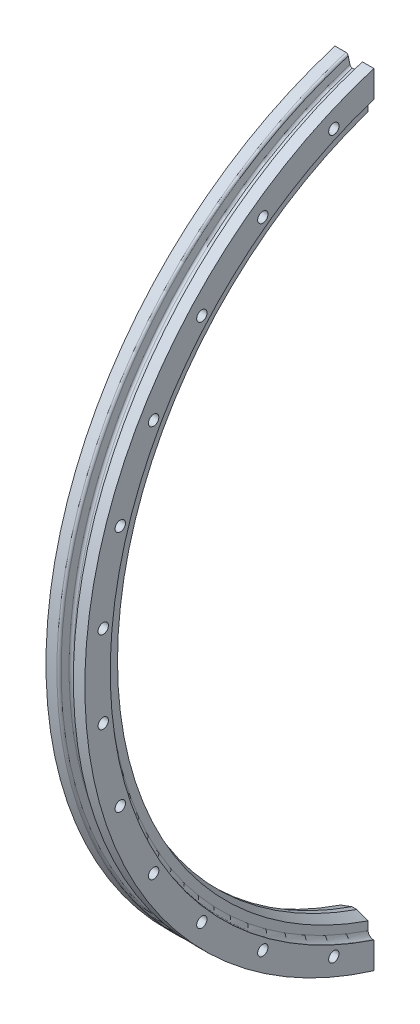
ISO-10303-21;
HEADER;
FILE_DESCRIPTION(('STEP AP214'),'2;1');
FILE_NAME('part.step','',(''),(''),'','','');
FILE_SCHEMA(('AUTOMOTIVE_DESIGN { 1 0 10303 214 1 1 1 1 }'));
ENDSEC;
DATA;
#1=APPLICATION_CONTEXT('core data for automotive mechanical design processes');
#2=APPLICATION_PROTOCOL_DEFINITION('international standard','automotive_design',2000,#1);
#3=PRODUCT_CONTEXT('',#1,'mechanical');
#4=PRODUCT('Part','Part','',(#3));
#5=PRODUCT_RELATED_PRODUCT_CATEGORY('part','',(#4));
#6=PRODUCT_DEFINITION_FORMATION('','',#4);
#7=PRODUCT_DEFINITION_CONTEXT('part definition',#1,'design');
#8=PRODUCT_DEFINITION('design','',#6,#7);
#9=PRODUCT_DEFINITION_SHAPE('','',#8);
#10=(LENGTH_UNIT() NAMED_UNIT(*) SI_UNIT(.MILLI.,.METRE.));
#11=(NAMED_UNIT(*) PLANE_ANGLE_UNIT() SI_UNIT($,.RADIAN.));
#12=(NAMED_UNIT(*) SI_UNIT($,.STERADIAN.) SOLID_ANGLE_UNIT());
#13=UNCERTAINTY_MEASURE_WITH_UNIT(LENGTH_MEASURE(1.E-05),#10,'distance_accuracy_value','');
#14=(GEOMETRIC_REPRESENTATION_CONTEXT(3) GLOBAL_UNCERTAINTY_ASSIGNED_CONTEXT((#13)) GLOBAL_UNIT_ASSIGNED_CONTEXT((#10,
#11,#12)) REPRESENTATION_CONTEXT('',''));
#15=CARTESIAN_POINT('',(0.,0.,0.));
#16=DIRECTION('',(0.,0.,1.));
#17=DIRECTION('',(1.,0.,0.));
#18=AXIS2_PLACEMENT_3D('',#15,#16,#17);
#19=CARTESIAN_POINT('',(0.,0.,0.));
#20=DIRECTION('',(-1.,0.,0.));
#21=DIRECTION('',(0.,0.,1.));
#22=AXIS2_PLACEMENT_3D('',#19,#20,#21);
#23=CYLINDRICAL_SURFACE('',#22,260.35);
#24=CARTESIAN_POINT('',(24.7649999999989,0.,0.));
#25=DIRECTION('',(1.,0.,0.));
#26=DIRECTION('',(0.,0.,-1.));
#27=AXIS2_PLACEMENT_3D('',#24,#25,#26);
#28=CIRCLE('',#27,260.35);
#29=CARTESIAN_POINT('',(24.7649999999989,248.949156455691,76.2));
#30=VERTEX_POINT('',#29);
#31=CARTESIAN_POINT('',(24.7649999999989,-248.949156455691,76.2));
#32=VERTEX_POINT('',#31);
#33=EDGE_CURVE('E46',#30,#32,#28,.T.);
#34=ORIENTED_EDGE('',*,*,#33,.F.);
#35=DIRECTION('',(-1.,0.,0.));
#36=VECTOR('',#35,1.);
#37=CARTESIAN_POINT('',(0.,248.949156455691,76.2));
#38=LINE('',#37,#36);
#39=CARTESIAN_POINT('',(17.4307499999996,248.949156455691,76.2));
#40=VERTEX_POINT('',#39);
#41=EDGE_CURVE('E380',#30,#40,#38,.T.);
#42=ORIENTED_EDGE('',*,*,#41,.T.);
#43=CARTESIAN_POINT('',(17.4307499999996,0.,0.));
#44=DIRECTION('',(-1.,0.,0.));
#45=DIRECTION('',(0.,0.,1.));
#46=AXIS2_PLACEMENT_3D('',#43,#44,#45);
#47=CIRCLE('',#46,260.35);
#48=CARTESIAN_POINT('',(17.4307499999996,-248.949156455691,76.2));
#49=VERTEX_POINT('',#48);
#50=EDGE_CURVE('E242',#49,#40,#47,.T.);
#51=ORIENTED_EDGE('',*,*,#50,.F.);
#52=DIRECTION('',(-1.,0.,0.));
#53=VECTOR('',#52,1.);
#54=CARTESIAN_POINT('',(0.,-248.949156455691,76.2));
#55=LINE('',#54,#53);
#56=EDGE_CURVE('E381',#49,#32,#55,.F.);
#57=ORIENTED_EDGE('',*,*,#56,.T.);
#58=EDGE_LOOP('',(#34,#42,#51,#57));
#59=FACE_BOUND('',#58,.T.);
#60=ADVANCED_FACE('F30',(#59),#23,.T.);
#61=CARTESIAN_POINT('',(0.,0.,0.));
#62=DIRECTION('',(-1.,0.,0.));
#63=DIRECTION('',(0.,0.,1.));
#64=AXIS2_PLACEMENT_3D('',#61,#62,#63);
#65=CYLINDRICAL_SURFACE('',#64,244.160039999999);
#66=CARTESIAN_POINT('',(24.7649999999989,0.,0.));
#67=DIRECTION('',(1.,0.,0.));
#68=DIRECTION('',(0.,0.,-1.));
#69=AXIS2_PLACEMENT_3D('',#66,#67,#68);
#70=CIRCLE('',#69,244.160039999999);
#71=CARTESIAN_POINT('',(24.7649999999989,-231.96483598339,76.2000000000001));
#72=VERTEX_POINT('',#71);
#73=CARTESIAN_POINT('',(24.7649999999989,231.96483598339,76.2));
#74=VERTEX_POINT('',#73);
#75=EDGE_CURVE('E162',#72,#74,#70,.F.);
#76=ORIENTED_EDGE('',*,*,#75,.F.);
#77=DIRECTION('',(-1.,0.,0.));
#78=VECTOR('',#77,1.);
#79=CARTESIAN_POINT('',(0.,-231.96483598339,76.2));
#80=LINE('',#79,#78);
#81=CARTESIAN_POINT('',(24.3077999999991,-231.96483598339,76.2));
#82=VERTEX_POINT('',#81);
#83=EDGE_CURVE('E11',#72,#82,#80,.T.);
#84=ORIENTED_EDGE('',*,*,#83,.T.);
#85=CARTESIAN_POINT('',(24.3077999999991,0.,0.));
#86=DIRECTION('',(-1.,0.,0.));
#87=DIRECTION('',(0.,0.,1.));
#88=AXIS2_PLACEMENT_3D('',#85,#86,#87);
#89=CIRCLE('',#88,244.160039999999);
#90=CARTESIAN_POINT('',(24.3077999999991,231.96483598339,76.2));
#91=VERTEX_POINT('',#90);
#92=EDGE_CURVE('E186',#82,#91,#89,.T.);
#93=ORIENTED_EDGE('',*,*,#92,.T.);
#94=DIRECTION('',(-1.,0.,0.));
#95=VECTOR('',#94,1.);
#96=CARTESIAN_POINT('',(0.,231.96483598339,76.2));
#97=LINE('',#96,#95);
#98=EDGE_CURVE('E39',#91,#74,#97,.F.);
#99=ORIENTED_EDGE('',*,*,#98,.T.);
#100=EDGE_LOOP('',(#76,#84,#93,#99));
#101=FACE_BOUND('',#100,.T.);
#102=ADVANCED_FACE('F171',(#101),#65,.F.);
#103=CARTESIAN_POINT('',(543.676823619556,260.35,76.2));
#104=DIRECTION('',(0.,0.,1.));
#105=DIRECTION('',(0.,-1.,0.));
#106=AXIS2_PLACEMENT_3D('',#103,#104,#105);
#107=PLANE('',#106);
#108=DIRECTION('',(0.,1.,0.));
#109=VECTOR('',#108,1.);
#110=CARTESIAN_POINT('',(24.7649999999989,260.35,76.2));
#111=LINE('',#110,#109);
#112=EDGE_CURVE('E382',#74,#30,#111,.T.);
#113=ORIENTED_EDGE('',*,*,#112,.F.);
#114=ORIENTED_EDGE('',*,*,#98,.F.);
#115=CARTESIAN_POINT('',(22.503446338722,225.865110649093,76.1999999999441));
#116=CARTESIAN_POINT('',(22.3535100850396,225.974414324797,76.1999999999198));
#117=CARTESIAN_POINT('',(22.2130296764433,226.096996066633,76.1999999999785));
#118=CARTESIAN_POINT('',(21.9547880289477,226.364367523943,76.2000000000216));
#119=CARTESIAN_POINT('',(21.8370698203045,226.50919839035,76.2000000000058));
#120=CARTESIAN_POINT('',(21.6275136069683,226.815925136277,76.1999999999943));
#121=CARTESIAN_POINT('',(21.5356079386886,226.977774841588,76.1999999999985));
#122=CARTESIAN_POINT('',(21.3791658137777,227.314094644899,76.2000000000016));
#123=CARTESIAN_POINT('',(21.3146213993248,227.488561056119,76.2000000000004));
#124=CARTESIAN_POINT('',(21.2121328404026,227.852277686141,76.1999999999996));
#125=CARTESIAN_POINT('',(21.1752862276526,228.041837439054,76.1999999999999));
#126=CARTESIAN_POINT('',(21.1329905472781,228.424454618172,76.2000000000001));
#127=CARTESIAN_POINT('',(21.1275494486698,228.617512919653,76.2));
#128=CARTESIAN_POINT('',(21.1484899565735,229.007229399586,76.2));
#129=CARTESIAN_POINT('',(21.1757474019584,229.203841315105,76.2));
#130=CARTESIAN_POINT('',(21.2630676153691,229.589667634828,76.2));
#131=CARTESIAN_POINT('',(21.3231313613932,229.778881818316,76.2));
#132=CARTESIAN_POINT('',(21.4743922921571,230.143110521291,76.2));
#133=CARTESIAN_POINT('',(21.5653972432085,230.318204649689,76.2));
#134=CARTESIAN_POINT('',(21.7765977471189,230.649833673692,76.2));
#135=CARTESIAN_POINT('',(21.8967877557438,230.806372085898,76.2));
#136=CARTESIAN_POINT('',(22.1583203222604,231.089975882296,76.2));
#137=CARTESIAN_POINT('',(22.2987043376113,231.217924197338,76.2));
#138=CARTESIAN_POINT('',(22.5999550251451,231.446891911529,76.2));
#139=CARTESIAN_POINT('',(22.7608149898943,231.547920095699,76.2));
#140=CARTESIAN_POINT('',(23.0895428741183,231.714683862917,76.2));
#141=CARTESIAN_POINT('',(23.2566270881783,231.781964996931,76.2));
#142=CARTESIAN_POINT('',(23.6000070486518,231.886155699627,76.2));
#143=CARTESIAN_POINT('',(23.7763002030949,231.923073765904,76.2));
#144=CARTESIAN_POINT('',(24.1253037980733,231.964216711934,76.2));
#145=CARTESIAN_POINT('',(24.2978644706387,231.969720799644,76.2));
#146=CARTESIAN_POINT('',(24.6413893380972,231.951263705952,76.2));
#147=CARTESIAN_POINT('',(24.8123537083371,231.927305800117,76.2));
#148=CARTESIAN_POINT('',(25.1456025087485,231.851314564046,76.2));
#149=CARTESIAN_POINT('',(25.3079698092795,231.799643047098,76.2));
#150=CARTESIAN_POINT('',(25.6219653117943,231.670279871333,76.2));
#151=CARTESIAN_POINT('',(25.7735928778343,231.592586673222,76.2));
#152=CARTESIAN_POINT('',(26.0651002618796,231.412008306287,76.2));
#153=CARTESIAN_POINT('',(26.2046945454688,231.30866294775,76.2));
#154=CARTESIAN_POINT('',(26.4654460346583,231.080890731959,76.2));
#155=CARTESIAN_POINT('',(26.5865999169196,230.956460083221,76.2));
#156=CARTESIAN_POINT('',(26.8126069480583,230.684450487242,76.2));
#157=CARTESIAN_POINT('',(26.9165428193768,230.536109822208,76.2));
#158=CARTESIAN_POINT('',(27.0994047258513,230.224751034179,76.2));
#159=CARTESIAN_POINT('',(27.1783248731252,230.061729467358,76.2));
#160=CARTESIAN_POINT('',(27.3129285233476,229.717050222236,76.2));
#161=CARTESIAN_POINT('',(27.3672750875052,229.534870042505,76.2));
#162=CARTESIAN_POINT('',(27.4458157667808,229.164117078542,76.2));
#163=CARTESIAN_POINT('',(27.4700033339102,228.975542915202,76.2));
#164=CARTESIAN_POINT('',(27.4881321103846,228.590042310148,76.2));
#165=CARTESIAN_POINT('',(27.4809401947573,228.3930617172,76.2));
#166=CARTESIAN_POINT('',(27.4338664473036,228.003023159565,76.2));
#167=CARTESIAN_POINT('',(27.393981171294,227.809965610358,76.2));
#168=CARTESIAN_POINT('',(27.281888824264,227.431900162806,76.2));
#169=CARTESIAN_POINT('',(27.2094476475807,227.246961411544,76.2));
#170=CARTESIAN_POINT('',(27.0337075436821,226.892341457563,76.2));
#171=CARTESIAN_POINT('',(26.9304116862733,226.722658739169,76.2));
#172=CARTESIAN_POINT('',(26.6985920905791,226.408559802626,76.2));
#173=CARTESIAN_POINT('',(26.570830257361,226.263582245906,76.2));
#174=CARTESIAN_POINT('',(26.291623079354,225.99854969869,76.2));
#175=CARTESIAN_POINT('',(26.1401850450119,225.878487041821,76.2));
#176=CARTESIAN_POINT('',(25.8261091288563,225.67326204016,76.2));
#177=CARTESIAN_POINT('',(25.6644231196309,225.586643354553,76.2));
#178=CARTESIAN_POINT('',(25.3282727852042,225.443415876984,76.2));
#179=CARTESIAN_POINT('',(25.1538133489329,225.386795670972,76.2));
#180=CARTESIAN_POINT('',(24.8063922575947,225.307874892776,76.2000000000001));
#181=CARTESIAN_POINT('',(24.6337837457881,225.284014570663,76.2000000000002));
#182=CARTESIAN_POINT('',(24.2869961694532,225.266404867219,76.1999999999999));
#183=CARTESIAN_POINT('',(24.1128169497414,225.272658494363,76.1999999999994));
#184=CARTESIAN_POINT('',(23.7722632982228,225.314520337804,76.2000000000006));
#185=CARTESIAN_POINT('',(23.6058017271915,225.349429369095,76.2000000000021));
#186=CARTESIAN_POINT('',(23.2811637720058,225.446403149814,76.199999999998));
#187=CARTESIAN_POINT('',(23.1229769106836,225.508432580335,76.1999999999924));
#188=CARTESIAN_POINT('',(22.8891584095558,225.622975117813,76.2000000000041));
#189=CARTESIAN_POINT('',(22.8090930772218,225.666687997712,76.2000000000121));
#190=CARTESIAN_POINT('',(22.6530731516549,225.760902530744,76.199999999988));
#191=CARTESIAN_POINT('',(22.5771182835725,225.811403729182,76.199999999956));
#192=CARTESIAN_POINT('',(22.503446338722,225.865110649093,76.1999999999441));
#193=B_SPLINE_CURVE_WITH_KNOTS('',3,(#115,#116,#117,#118,#119,#120,#121,#122,#123,#124,#125,
#126,#127,#128,#129,#130,#131,#132,#133,#134,#135,#136,#137,#138,#139,#140,#141,#142,#143,#144,
#145,#146,#147,#148,#149,#150,#151,#152,#153,#154,#155,#156,#157,#158,#159,#160,#161,#162,#163,
#164,#165,#166,#167,#168,#169,#170,#171,#172,#173,#174,#175,#176,#177,#178,#179,#180,#181,#182,
#183,#184,#185,#186,#187,#188,#189,#190,#191,#192),.UNSPECIFIED.,.T.,.F.,(4,2,2,2,2,2,2,2,2,2,2,
2,2,2,2,2,2,2,2,2,2,2,2,2,2,2,2,2,2,2,2,2,2,2,2,2,2,2,4),(0.,0.556292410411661,1.11362638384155,
1.66948545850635,2.22518275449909,2.80188219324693,3.37872796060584,3.97137592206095,
4.56404155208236,5.15309034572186,5.74202732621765,6.30895134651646,6.87569013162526,
7.41333440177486,7.95082815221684,8.46626931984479,8.98165318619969,9.49046668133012,
9.99931028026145,10.5180416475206,11.036866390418,11.5778515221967,12.1189638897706,
12.6867453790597,13.2546501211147,13.843228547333,14.4318689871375,15.0248117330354,
15.617695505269,16.1944665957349,16.7710599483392,17.3185336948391,17.8657989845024,
18.385981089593,18.9062151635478,19.414120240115,19.921365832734,20.1947212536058,
20.4680583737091),.UNSPECIFIED.);
#194=CARTESIAN_POINT('',(21.1327999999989,228.620536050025,76.2));
#195=VERTEX_POINT('',#194);
#196=EDGE_CURVE('E189',#195,#91,#193,.T.);
#197=ORIENTED_EDGE('',*,*,#196,.F.);
#198=DIRECTION('',(0.,1.,0.));
#199=VECTOR('',#198,1.);
#200=CARTESIAN_POINT('',(21.132799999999,-240.985039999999,76.2000000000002));
#201=LINE('',#200,#199);
#202=CARTESIAN_POINT('',(21.132799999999,223.257951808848,76.2));
#203=VERTEX_POINT('',#202);
#204=EDGE_CURVE('E387',#203,#195,#201,.T.);
#205=ORIENTED_EDGE('',*,*,#204,.F.);
#206=CARTESIAN_POINT('',(-317.168542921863,87.3055527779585,76.2));
#207=CARTESIAN_POINT('',(-315.529523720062,88.0773610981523,76.2));
#208=CARTESIAN_POINT('',(-313.888809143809,88.8455603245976,76.2));
#209=CARTESIAN_POINT('',(-310.60423721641,90.3751994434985,76.2));
#210=CARTESIAN_POINT('',(-308.960379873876,91.1366393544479,76.2));
#211=CARTESIAN_POINT('',(-304.024504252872,93.4114906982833,76.2));
#212=CARTESIAN_POINT('',(-300.728130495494,94.9154581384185,76.2));
#213=CARTESIAN_POINT('',(-294.125607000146,97.9012034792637,76.2));
#214=CARTESIAN_POINT('',(-290.819457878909,99.3829827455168,76.2));
#215=CARTESIAN_POINT('',(-284.198468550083,102.327024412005,76.2));
#216=CARTESIAN_POINT('',(-280.883628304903,103.789286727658,76.2));
#217=CARTESIAN_POINT('',(-274.246941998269,106.696198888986,76.2));
#218=CARTESIAN_POINT('',(-270.925097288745,108.140851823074,76.2));
#219=CARTESIAN_POINT('',(-264.274707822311,111.014654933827,76.2));
#220=CARTESIAN_POINT('',(-260.946163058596,112.443805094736,76.2));
#221=CARTESIAN_POINT('',(-254.283075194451,115.288205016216,76.2));
#222=CARTESIAN_POINT('',(-250.948531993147,116.703454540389,76.2));
#223=CARTESIAN_POINT('',(-244.274142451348,119.521391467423,76.2));
#224=CARTESIAN_POINT('',(-240.93429610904,120.924078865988,76.2));
#225=CARTESIAN_POINT('',(-234.25095890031,123.717611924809,76.2));
#226=CARTESIAN_POINT('',(-230.907469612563,125.108461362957,76.2));
#227=CARTESIAN_POINT('',(-224.216206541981,127.879817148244,76.2));
#228=CARTESIAN_POINT('',(-220.86843275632,129.260323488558,76.2));
#229=CARTESIAN_POINT('',(-210.819361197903,133.387696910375,76.2));
#230=CARTESIAN_POINT('',(-204.11225988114,136.120440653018,76.2));
#231=CARTESIAN_POINT('',(-190.684930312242,141.554452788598,76.2));
#232=CARTESIAN_POINT('',(-183.964701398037,144.255719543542,76.2));
#233=CARTESIAN_POINT('',(-170.513496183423,149.631379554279,76.2));
#234=CARTESIAN_POINT('',(-163.78251986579,152.305772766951,76.2));
#235=CARTESIAN_POINT('',(-150.496250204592,157.558445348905,76.2));
#236=CARTESIAN_POINT('',(-143.941203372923,160.137348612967,76.2));
#237=CARTESIAN_POINT('',(-130.823688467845,165.276213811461,76.2));
#238=CARTESIAN_POINT('',(-124.261220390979,167.836175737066,76.2));
#239=CARTESIAN_POINT('',(-111.129976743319,172.939482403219,76.2));
#240=CARTESIAN_POINT('',(-104.561201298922,175.482827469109,76.2));
#241=CARTESIAN_POINT('',(-91.4180235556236,180.554935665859,76.2));
#242=CARTESIAN_POINT('',(-84.8436212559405,183.083698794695,76.2));
#243=CARTESIAN_POINT('',(-71.6887990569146,188.128725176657,76.2));
#244=CARTESIAN_POINT('',(-65.1083783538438,190.644986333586,76.2));
#245=CARTESIAN_POINT('',(-51.9431552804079,195.666016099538,76.2));
#246=CARTESIAN_POINT('',(-45.3583529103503,198.170784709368,76.2));
#247=CARTESIAN_POINT('',(-32.1848150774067,203.170060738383,76.2));
#248=CARTESIAN_POINT('',(-25.5960795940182,205.664568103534,76.2));
#249=CARTESIAN_POINT('',(-12.4151199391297,210.644349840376,76.2));
#250=CARTESIAN_POINT('',(-5.82289576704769,213.129624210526,76.2));
#251=CARTESIAN_POINT('',(14.1404922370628,220.641487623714,76.2));
#252=CARTESIAN_POINT('',(27.5165168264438,225.655161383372,76.2));
#253=CARTESIAN_POINT('',(54.2790072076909,235.654566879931,76.2));
#254=CARTESIAN_POINT('',(67.6654730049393,240.640298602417,76.2));
#255=CARTESIAN_POINT('',(94.4470451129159,250.588531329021,76.2));
#256=CARTESIAN_POINT('',(107.842151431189,255.551032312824,76.2));
#257=CARTESIAN_POINT('',(134.639581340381,265.456509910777,76.2));
#258=CARTESIAN_POINT('',(148.04190493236,270.399486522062,76.2));
#259=CARTESIAN_POINT('',(174.84726910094,280.266881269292,76.2));
#260=CARTESIAN_POINT('',(188.250307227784,285.191306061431,76.2));
#261=CARTESIAN_POINT('',(215.061588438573,295.025968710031,76.2));
#262=CARTESIAN_POINT('',(228.469831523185,299.936206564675,76.2));
#263=CARTESIAN_POINT('',(255.290701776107,309.744399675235,76.2));
#264=CARTESIAN_POINT('',(268.70332891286,314.642355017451,76.2));
#265=CARTESIAN_POINT('',(288.825180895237,321.98129596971,76.2));
#266=CARTESIAN_POINT('',(295.532948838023,324.426277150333,76.2));
#267=CARTESIAN_POINT('',(308.949393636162,329.313744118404,76.2));
#268=CARTESIAN_POINT('',(315.658070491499,331.7562299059,76.2));
#269=CARTESIAN_POINT('',(322.367170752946,334.197552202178,76.2));
#270=B_SPLINE_CURVE_WITH_KNOTS('',3,(#206,#207,#208,#209,#210,#211,#212,#213,#214,#215,#216,
#217,#218,#219,#220,#221,#222,#223,#224,#225,#226,#227,#228,#229,#230,#231,#232,#233,#234,#235,
#236,#237,#238,#239,#240,#241,#242,#243,#244,#245,#246,#247,#248,#249,#250,#251,#252,#253,#254,
#255,#256,#257,#258,#259,#260,#261,#262,#263,#264,#265,#266,#267,#268,#269),.UNSPECIFIED.,.F.,
.F.,(4,2,2,2,2,2,2,2,2,2,2,2,2,2,2,2,2,2,2,2,2,2,2,2,2,2,2,2,2,2,2,4),(0.,5.43493636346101,
10.8698578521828,21.7395288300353,32.6085280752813,43.4775744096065,54.3446862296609,
65.211809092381,76.0791164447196,86.9464275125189,97.8101295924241,108.673838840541,
130.401083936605,152.129454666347,173.8578602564,194.990134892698,216.122419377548,
237.254288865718,258.38616128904,279.521464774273,300.656766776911,321.792179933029,
342.927596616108,385.781895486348,428.636216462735,471.490574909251,514.344939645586,
557.182093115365,600.019252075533,642.856109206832,664.274529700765,685.69294978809),.UNSPECIFIED.);
#271=CARTESIAN_POINT('',(13.9699999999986,220.571114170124,76.2));
#272=VERTEX_POINT('',#271);
#273=EDGE_CURVE('E245',#272,#203,#270,.T.);
#274=ORIENTED_EDGE('',*,*,#273,.F.);
#275=DIRECTION('',(-1.,0.,0.));
#276=VECTOR('',#275,1.);
#277=CARTESIAN_POINT('',(0.,220.571114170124,76.2));
#278=LINE('',#277,#276);
#279=CARTESIAN_POINT('',(10.7949999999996,220.571114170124,76.2));
#280=VERTEX_POINT('',#279);
#281=EDGE_CURVE('E502',#280,#272,#278,.F.);
#282=ORIENTED_EDGE('',*,*,#281,.F.);
#283=CARTESIAN_POINT('',(-300.09540053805,335.051566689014,76.2));
#284=CARTESIAN_POINT('',(-293.36591773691,332.604286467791,76.2));
#285=CARTESIAN_POINT('',(-286.636857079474,330.155845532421,76.2));
#286=CARTESIAN_POINT('',(-273.179641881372,325.25647421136,76.2));
#287=CARTESIAN_POINT('',(-266.451487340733,322.805543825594,76.2));
#288=CARTESIAN_POINT('',(-246.268473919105,315.44876583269,76.2));
#289=CARTESIAN_POINT('',(-232.815067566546,310.538932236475,76.2));
#290=CARTESIAN_POINT('',(-205.913173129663,300.707212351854,76.2));
#291=CARTESIAN_POINT('',(-192.464684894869,295.785326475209,76.2));
#292=CARTESIAN_POINT('',(-165.572894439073,285.927402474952,76.2));
#293=CARTESIAN_POINT('',(-152.129592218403,280.991364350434,76.2));
#294=CARTESIAN_POINT('',(-125.252180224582,271.103913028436,76.2));
#295=CARTESIAN_POINT('',(-111.818069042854,266.152503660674,76.2));
#296=CARTESIAN_POINT('',(-84.9570336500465,256.230238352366,76.2));
#297=CARTESIAN_POINT('',(-71.5301094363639,251.259382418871,76.2));
#298=CARTESIAN_POINT('',(-44.6843670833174,241.294351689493,76.2));
#299=CARTESIAN_POINT('',(-31.2655492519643,236.300176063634,76.2));
#300=CARTESIAN_POINT('',(-4.43827684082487,226.283989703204,76.2));
#301=CARTESIAN_POINT('',(8.9701777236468,221.261978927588,76.2));
#302=CARTESIAN_POINT('',(29.0757466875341,213.702545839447,76.2));
#303=CARTESIAN_POINT('',(35.7776523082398,211.177864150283,76.2));
#304=CARTESIAN_POINT('',(49.1778889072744,206.119033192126,76.2));
#305=CARTESIAN_POINT('',(55.8762198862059,203.584883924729,76.2));
#306=CARTESIAN_POINT('',(69.2688501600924,198.50604585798,76.2));
#307=CARTESIAN_POINT('',(75.9631494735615,195.961357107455,76.2));
#308=CARTESIAN_POINT('',(89.3472439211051,190.860158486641,76.2));
#309=CARTESIAN_POINT('',(96.037039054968,188.303648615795,76.2));
#310=CARTESIAN_POINT('',(109.410940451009,183.177548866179,76.2));
#311=CARTESIAN_POINT('',(116.095047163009,180.607960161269,76.2));
#312=CARTESIAN_POINT('',(129.457453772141,175.453726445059,76.2));
#313=CARTESIAN_POINT('',(136.135753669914,172.869081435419,76.2));
#314=CARTESIAN_POINT('',(149.48581891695,167.682602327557,76.2));
#315=CARTESIAN_POINT('',(156.157584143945,165.080767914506,76.2));
#316=CARTESIAN_POINT('',(169.493426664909,159.857452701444,76.2));
#317=CARTESIAN_POINT('',(176.157503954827,157.235971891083,76.2));
#318=CARTESIAN_POINT('',(189.478954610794,151.969439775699,76.2));
#319=CARTESIAN_POINT('',(196.136324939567,149.324380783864,76.2));
#320=CARTESIAN_POINT('',(209.440502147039,144.00784654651,76.2));
#321=CARTESIAN_POINT('',(216.087309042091,141.33637134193,76.2));
#322=CARTESIAN_POINT('',(229.368047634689,135.962522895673,76.2));
#323=CARTESIAN_POINT('',(236.001979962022,133.260151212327,76.2));
#324=CARTESIAN_POINT('',(245.94153530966,129.178909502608,76.2));
#325=CARTESIAN_POINT('',(249.252842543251,127.813876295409,76.2));
#326=CARTESIAN_POINT('',(255.87126524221,125.073686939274,76.2));
#327=CARTESIAN_POINT('',(259.178380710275,123.69853079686,76.2));
#328=CARTESIAN_POINT('',(265.788992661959,120.936673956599,76.2));
#329=CARTESIAN_POINT('',(269.092487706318,119.549969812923,76.2));
#330=CARTESIAN_POINT('',(275.694302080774,116.764294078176,76.2));
#331=CARTESIAN_POINT('',(278.992621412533,115.36532249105,76.2));
#332=CARTESIAN_POINT('',(285.583415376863,112.553820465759,76.2));
#333=CARTESIAN_POINT('',(288.875890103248,111.141290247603,76.2));
#334=CARTESIAN_POINT('',(295.454319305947,108.301129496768,76.2));
#335=CARTESIAN_POINT('',(298.740273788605,106.873498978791,76.2));
#336=CARTESIAN_POINT('',(305.305369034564,104.001118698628,76.2));
#337=CARTESIAN_POINT('',(308.584508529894,102.556366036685,76.2));
#338=CARTESIAN_POINT('',(315.134359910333,99.6479087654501,76.2));
#339=CARTESIAN_POINT('',(318.405071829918,98.1842042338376,76.2));
#340=CARTESIAN_POINT('',(324.937031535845,95.2352916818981,76.2));
#341=CARTESIAN_POINT('',(328.198278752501,93.7500823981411,76.2));
#342=CARTESIAN_POINT('',(333.081764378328,91.5039852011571,76.2));
#343=CARTESIAN_POINT('',(334.708207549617,90.7522332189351,76.2));
#344=CARTESIAN_POINT('',(337.958063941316,89.242198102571,76.2));
#345=CARTESIAN_POINT('',(339.581477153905,88.4839149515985,76.2));
#346=CARTESIAN_POINT('',(341.203257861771,87.7221480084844,76.2));
#347=B_SPLINE_CURVE_WITH_KNOTS('',3,(#283,#284,#285,#286,#287,#288,#289,#290,#291,#292,#293,
#294,#295,#296,#297,#298,#299,#300,#301,#302,#303,#304,#305,#306,#307,#308,#309,#310,#311,#312,
#313,#314,#315,#316,#317,#318,#319,#320,#321,#322,#323,#324,#325,#326,#327,#328,#329,#330,#331,
#332,#333,#334,#335,#336,#337,#338,#339,#340,#341,#342,#343,#344,#345,#346),.UNSPECIFIED.,.F.,
.F.,(4,2,2,2,2,2,2,2,2,2,2,2,2,2,2,2,2,2,2,2,2,2,2,2,2,2,2,2,2,2,2,4),(0.,21.4819939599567,
42.9639885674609,85.9279852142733,128.890533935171,171.853085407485,214.805676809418,
257.758252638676,300.712369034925,343.66654878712,365.151561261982,386.636570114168,
408.121479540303,429.606389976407,451.089404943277,472.572417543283,494.055824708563,
515.539243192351,537.029942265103,558.520608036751,580.010194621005,590.755070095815,
601.499938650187,612.248137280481,622.996332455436,633.744353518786,644.492364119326,
655.242221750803,665.992035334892,676.742483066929,682.117787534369,687.493105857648),.UNSPECIFIED.);
#348=CARTESIAN_POINT('',(3.63219999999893,223.256689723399,76.2));
#349=VERTEX_POINT('',#348);
#350=EDGE_CURVE('E277',#349,#280,#347,.T.);
#351=ORIENTED_EDGE('',*,*,#350,.F.);
#352=DIRECTION('',(0.,-1.,0.));
#353=VECTOR('',#352,1.);
#354=CARTESIAN_POINT('',(3.6321999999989,-240.985039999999,76.2000000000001));
#355=LINE('',#354,#353);
#356=CARTESIAN_POINT('',(3.63219999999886,228.620536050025,76.2));
#357=VERTEX_POINT('',#356);
#358=EDGE_CURVE('E507',#357,#349,#355,.T.);
#359=ORIENTED_EDGE('',*,*,#358,.F.);
#360=CARTESIAN_POINT('',(1.52162471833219,225.46529715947,76.2));
#361=CARTESIAN_POINT('',(1.3626461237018,225.405589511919,76.2));
#362=CARTESIAN_POINT('',(1.19859907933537,225.35908757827,76.2));
#363=CARTESIAN_POINT('',(0.864918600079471,225.294259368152,76.2));
#364=CARTESIAN_POINT('',(0.695280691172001,225.275956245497,76.2));
#365=CARTESIAN_POINT('',(0.355350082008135,225.26825993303,76.2));
#366=CARTESIAN_POINT('',(0.185057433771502,225.278864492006,76.2));
#367=CARTESIAN_POINT('',(-0.151271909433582,225.328581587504,76.2));
#368=CARTESIAN_POINT('',(-0.317309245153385,225.367689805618,76.2));
#369=CARTESIAN_POINT('',(-0.640319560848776,225.472897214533,76.2));
#370=CARTESIAN_POINT('',(-0.797304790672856,225.538958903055,76.2));
#371=CARTESIAN_POINT('',(-1.09839152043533,225.69578175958,76.2));
#372=CARTESIAN_POINT('',(-1.24249143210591,225.786545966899,76.2));
#373=CARTESIAN_POINT('',(-1.51832277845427,225.992816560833,76.2));
#374=CARTESIAN_POINT('',(-1.64957349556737,226.108964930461,76.2));
#375=CARTESIAN_POINT('',(-1.89183094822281,226.360720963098,76.2));
#376=CARTESIAN_POINT('',(-2.00283334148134,226.496332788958,76.2));
#377=CARTESIAN_POINT('',(-2.20722539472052,226.790205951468,76.2));
#378=CARTESIAN_POINT('',(-2.29948886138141,226.949250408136,76.2));
#379=CARTESIAN_POINT('',(-2.45743674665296,227.280025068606,76.2));
#380=CARTESIAN_POINT('',(-2.52311468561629,227.451758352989,76.2));
#381=CARTESIAN_POINT('',(-2.62920848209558,227.811968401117,76.2));
#382=CARTESIAN_POINT('',(-2.66824116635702,228.00085327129,76.2));
#383=CARTESIAN_POINT('',(-2.71501335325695,228.382469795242,76.2));
#384=CARTESIAN_POINT('',(-2.72274683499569,228.575202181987,76.2));
#385=CARTESIAN_POINT('',(-2.70651859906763,228.964809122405,76.2));
#386=CARTESIAN_POINT('',(-2.68165571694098,229.161646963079,76.2));
#387=CARTESIAN_POINT('',(-2.5990959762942,229.548339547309,76.2));
#388=CARTESIAN_POINT('',(-2.54139780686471,229.738194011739,76.2));
#389=CARTESIAN_POINT('',(-2.39467416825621,230.104356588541,76.2));
#390=CARTESIAN_POINT('',(-2.30580155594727,230.28072577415,76.2));
#391=CARTESIAN_POINT('',(-2.09863829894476,230.615279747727,76.2));
#392=CARTESIAN_POINT('',(-1.98035292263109,230.77346778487,76.2));
#393=CARTESIAN_POINT('',(-1.72214596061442,231.06078127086,76.2));
#394=CARTESIAN_POINT('',(-1.58317079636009,231.190756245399,76.2));
#395=CARTESIAN_POINT('',(-1.28435790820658,231.423998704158,76.2));
#396=CARTESIAN_POINT('',(-1.12452701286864,231.527274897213,76.2));
#397=CARTESIAN_POINT('',(-0.797372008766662,231.698565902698,76.2));
#398=CARTESIAN_POINT('',(-0.630851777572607,231.768116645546,76.2));
#399=CARTESIAN_POINT('',(-0.288186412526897,231.876884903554,76.2));
#400=CARTESIAN_POINT('',(-0.112044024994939,231.916111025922,76.2));
#401=CARTESIAN_POINT('',(0.236934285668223,231.961702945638,76.2));
#402=CARTESIAN_POINT('',(0.409600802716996,231.969373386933,76.2));
#403=CARTESIAN_POINT('',(0.753700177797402,231.955162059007,76.2));
#404=CARTESIAN_POINT('',(0.925133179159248,231.933283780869,76.2));
#405=CARTESIAN_POINT('',(1.2594416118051,231.861308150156,76.2));
#406=CARTESIAN_POINT('',(1.42240297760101,231.81160808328,76.2));
#407=CARTESIAN_POINT('',(1.73788904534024,231.686034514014,76.2));
#408=CARTESIAN_POINT('',(1.89041318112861,231.610159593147,76.2));
#409=CARTESIAN_POINT('',(2.18383584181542,231.433143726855,76.2));
#410=CARTESIAN_POINT('',(2.32446948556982,231.331564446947,76.2));
#411=CARTESIAN_POINT('',(2.58755755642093,231.107122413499,76.2));
#412=CARTESIAN_POINT('',(2.71000878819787,230.984255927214,76.2));
#413=CARTESIAN_POINT('',(2.93882029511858,230.715280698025,76.2));
#414=CARTESIAN_POINT('',(3.0442853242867,230.568410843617,76.2));
#415=CARTESIAN_POINT('',(3.2304227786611,230.259731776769,76.2));
#416=CARTESIAN_POINT('',(3.31108932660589,230.097919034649,76.2));
#417=CARTESIAN_POINT('',(3.4494612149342,229.755409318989,76.2));
#418=CARTESIAN_POINT('',(3.50583588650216,229.574174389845,76.2));
#419=CARTESIAN_POINT('',(3.58858288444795,229.20497578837,76.2));
#420=CARTESIAN_POINT('',(3.61494863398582,229.017010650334,76.2));
#421=CARTESIAN_POINT('',(3.63763594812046,228.632233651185,76.2));
#422=CARTESIAN_POINT('',(3.6328030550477,228.435352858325,76.2));
#423=CARTESIAN_POINT('',(3.59047291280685,228.04511904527,76.2));
#424=CARTESIAN_POINT('',(3.55297317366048,227.851766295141,76.2));
#425=CARTESIAN_POINT('',(3.44558821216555,227.472475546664,76.2));
#426=CARTESIAN_POINT('',(3.37543257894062,227.286613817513,76.2));
#427=CARTESIAN_POINT('',(3.20408470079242,226.929694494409,76.2));
#428=CARTESIAN_POINT('',(3.1028874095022,226.758639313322,76.2));
#429=CARTESIAN_POINT('',(2.87480221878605,226.441194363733,76.2));
#430=CARTESIAN_POINT('',(2.74863566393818,226.294286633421,76.2));
#431=CARTESIAN_POINT('',(2.47235663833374,226.025284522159,76.2));
#432=CARTESIAN_POINT('',(2.32228265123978,225.903150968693,76.2));
#433=CARTESIAN_POINT('',(2.06248492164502,225.728541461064,76.2));
#434=CARTESIAN_POINT('',(1.95867893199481,225.667102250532,76.2));
#435=CARTESIAN_POINT('',(1.74464027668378,225.556659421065,76.2));
#436=CARTESIAN_POINT('',(1.63440792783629,225.507655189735,76.2));
#437=CARTESIAN_POINT('',(1.52162471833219,225.46529715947,76.2));
#438=B_SPLINE_CURVE_WITH_KNOTS('',3,(#360,#361,#362,#363,#364,#365,#366,#367,#368,#369,#370,
#371,#372,#373,#374,#375,#376,#377,#378,#379,#380,#381,#382,#383,#384,#385,#386,#387,#388,#389,
#390,#391,#392,#393,#394,#395,#396,#397,#398,#399,#400,#401,#402,#403,#404,#405,#406,#407,#408,
#409,#410,#411,#412,#413,#414,#415,#416,#417,#418,#419,#420,#421,#422,#423,#424,#425,#426,#427,
#428,#429,#430,#431,#432,#433,#434,#435,#436,#437),.UNSPECIFIED.,.T.,.F.,(4,2,2,2,2,2,2,2,2,2,2,
2,2,2,2,2,2,2,2,2,2,2,2,2,2,2,2,2,2,2,2,2,2,2,2,2,2,2,4),(0.,0.509032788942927,1.01848331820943,
1.52789417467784,2.03722786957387,2.54585529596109,3.05454533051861,3.57800807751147,
4.10158295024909,4.65075144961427,5.20005371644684,5.77605740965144,6.35217190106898,
6.9445545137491,7.53696077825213,8.12650200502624,8.71593770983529,9.28387626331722,
9.85162932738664,10.3902839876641,10.9287857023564,11.4447849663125,11.9607232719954,
12.4694754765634,12.9782552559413,13.496376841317,14.0145893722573,14.5546340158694,
15.0948065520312,15.6616553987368,16.2286284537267,16.8166987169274,17.4048138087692,
17.9978879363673,18.5910585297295,19.1690949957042,19.7462102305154,20.1073480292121,
20.4684680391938),.UNSPECIFIED.);
#439=CARTESIAN_POINT('',(0.457199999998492,231.96483598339,76.2));
#440=VERTEX_POINT('',#439);
#441=EDGE_CURVE('E287',#440,#357,#438,.T.);
#442=ORIENTED_EDGE('',*,*,#441,.F.);
#443=DIRECTION('',(-1.,0.,0.));
#444=VECTOR('',#443,1.);
#445=CARTESIAN_POINT('',(0.,231.96483598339,76.2));
#446=LINE('',#445,#444);
#447=CARTESIAN_POINT('',(0.,231.96483598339,76.2));
#448=VERTEX_POINT('',#447);
#449=EDGE_CURVE('E526',#448,#440,#446,.F.);
#450=ORIENTED_EDGE('',*,*,#449,.F.);
#451=DIRECTION('',(0.,1.,0.));
#452=VECTOR('',#451,1.);
#453=CARTESIAN_POINT('',(0.,260.35,76.2));
#454=LINE('',#453,#452);
#455=CARTESIAN_POINT('',(0.,248.949156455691,76.2));
#456=VERTEX_POINT('',#455);
#457=EDGE_CURVE('E500',#448,#456,#454,.T.);
#458=ORIENTED_EDGE('',*,*,#457,.T.);
#459=DIRECTION('',(-1.,0.,0.));
#460=VECTOR('',#459,1.);
#461=CARTESIAN_POINT('',(0.,248.949156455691,76.2));
#462=LINE('',#461,#460);
#463=CARTESIAN_POINT('',(6.94118732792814,248.949156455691,76.2));
#464=VERTEX_POINT('',#463);
#465=EDGE_CURVE('E524',#464,#456,#462,.T.);
#466=ORIENTED_EDGE('',*,*,#465,.F.);
#467=CARTESIAN_POINT('',(7.60253936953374,245.805867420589,76.2));
#468=CARTESIAN_POINT('',(7.68306201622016,245.844883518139,76.2));
#469=CARTESIAN_POINT('',(7.76025440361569,245.890960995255,76.2));
#470=CARTESIAN_POINT('',(7.90576091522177,245.995606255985,76.2));
#471=CARTESIAN_POINT('',(7.9740598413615,246.054194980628,76.2));
#472=CARTESIAN_POINT('',(8.09981849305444,246.181752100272,76.2));
#473=CARTESIAN_POINT('',(8.15730331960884,246.250695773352,76.2));
#474=CARTESIAN_POINT('',(8.26030484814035,246.396956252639,76.2));
#475=CARTESIAN_POINT('',(8.3058245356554,246.474270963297,76.2));
#476=CARTESIAN_POINT('',(8.38529123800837,246.637832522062,76.2));
#477=CARTESIAN_POINT('',(8.41880237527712,246.724291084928,76.2));
#478=CARTESIAN_POINT('',(8.47140089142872,246.901496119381,76.2));
#479=CARTESIAN_POINT('',(8.49048467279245,246.992243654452,76.2));
#480=CARTESIAN_POINT('',(8.51426869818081,247.178895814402,76.2));
#481=CARTESIAN_POINT('',(8.51843304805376,247.274869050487,76.2));
#482=CARTESIAN_POINT('',(8.51079838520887,247.466186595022,76.2));
#483=CARTESIAN_POINT('',(8.4989975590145,247.561530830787,76.2));
#484=CARTESIAN_POINT('',(8.45942982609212,247.750022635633,76.2));
#485=CARTESIAN_POINT('',(8.43147836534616,247.843131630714,76.2));
#486=CARTESIAN_POINT('',(8.36006279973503,248.023210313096,76.2));
#487=CARTESIAN_POINT('',(8.31659955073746,248.1101803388,76.2));
#488=CARTESIAN_POINT('',(8.21608472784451,248.273745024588,76.2));
#489=CARTESIAN_POINT('',(8.15929097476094,248.350497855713,76.2));
#490=CARTESIAN_POINT('',(8.03313121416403,248.492875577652,76.2));
#491=CARTESIAN_POINT('',(7.96376803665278,248.55850296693,76.2));
#492=CARTESIAN_POINT('',(7.81738226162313,248.673909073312,76.2));
#493=CARTESIAN_POINT('',(7.74077659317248,248.724216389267,76.2));
#494=CARTESIAN_POINT('',(7.57990927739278,248.810573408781,76.2));
#495=CARTESIAN_POINT('',(7.49564979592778,248.846627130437,76.2));
#496=CARTESIAN_POINT('',(7.32580531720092,248.901870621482,76.2));
#497=CARTESIAN_POINT('',(7.24043536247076,248.921722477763,76.2));
#498=CARTESIAN_POINT('',(7.06755315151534,248.946377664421,76.2));
#499=CARTESIAN_POINT('',(6.9800412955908,248.951183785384,76.2));
#500=CARTESIAN_POINT('',(6.80782521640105,248.945646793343,76.2));
#501=CARTESIAN_POINT('',(6.72310790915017,248.935700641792,76.2));
#502=CARTESIAN_POINT('',(6.55654912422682,248.90173947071,76.2));
#503=CARTESIAN_POINT('',(6.47470756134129,248.877724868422,76.2));
#504=CARTESIAN_POINT('',(6.31603690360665,248.816417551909,76.2));
#505=CARTESIAN_POINT('',(6.23921512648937,248.77910594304,76.2));
#506=CARTESIAN_POINT('',(6.09269985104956,248.692446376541,76.2));
#507=CARTESIAN_POINT('',(6.02300711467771,248.643097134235,76.2));
#508=CARTESIAN_POINT('',(5.89062595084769,248.532382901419,76.2));
#509=CARTESIAN_POINT('',(5.82818304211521,248.470724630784,76.2));
#510=CARTESIAN_POINT('',(5.71402898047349,248.338173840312,76.2));
#511=CARTESIAN_POINT('',(5.66231987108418,248.267279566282,76.2));
#512=CARTESIAN_POINT('',(5.56879667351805,248.115102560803,76.2));
#513=CARTESIAN_POINT('',(5.52748875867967,248.033508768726,76.2));
#514=CARTESIAN_POINT('',(5.45855826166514,247.864733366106,76.2));
#515=CARTESIAN_POINT('',(5.43093855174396,247.777550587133,76.2));
#516=CARTESIAN_POINT('',(5.38910275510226,247.596370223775,76.2));
#517=CARTESIAN_POINT('',(5.37546208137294,247.502239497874,76.2));
#518=CARTESIAN_POINT('',(5.36381824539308,247.313010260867,76.2));
#519=CARTESIAN_POINT('',(5.36581745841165,247.217911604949,76.2));
#520=CARTESIAN_POINT('',(5.38562083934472,247.027351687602,76.2));
#521=CARTESIAN_POINT('',(5.40375450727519,246.931924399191,76.2));
#522=CARTESIAN_POINT('',(5.45590647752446,246.745501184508,76.2));
#523=CARTESIAN_POINT('',(5.48992502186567,246.654505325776,76.2));
#524=CARTESIAN_POINT('',(5.57276511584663,246.480393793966,76.2));
#525=CARTESIAN_POINT('',(5.62146672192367,246.397221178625,76.2));
#526=CARTESIAN_POINT('',(5.73261303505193,246.240616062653,76.2));
#527=CARTESIAN_POINT('',(5.79505533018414,246.167181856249,76.2));
#528=CARTESIAN_POINT('',(5.92966981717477,246.034936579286,76.2));
#529=CARTESIAN_POINT('',(6.00143163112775,245.975708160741,76.2));
#530=CARTESIAN_POINT('',(6.15427238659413,245.870828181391,76.2));
#531=CARTESIAN_POINT('',(6.23534823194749,245.825172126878,76.2));
#532=CARTESIAN_POINT('',(6.40053935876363,245.750910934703,76.2));
#533=CARTESIAN_POINT('',(6.48434867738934,245.721624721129,76.2));
#534=CARTESIAN_POINT('',(6.65581201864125,245.678097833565,76.2));
#535=CARTESIAN_POINT('',(6.74346620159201,245.663857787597,76.2));
#536=CARTESIAN_POINT('',(6.9169035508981,245.651195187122,76.2));
#537=CARTESIAN_POINT('',(7.00264951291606,245.652253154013,76.2));
#538=CARTESIAN_POINT('',(7.17263743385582,245.668890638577,76.2));
#539=CARTESIAN_POINT('',(7.25688133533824,245.684449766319,76.2));
#540=CARTESIAN_POINT('',(7.38446141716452,245.719329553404,76.2));
#541=CARTESIAN_POINT('',(7.42917450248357,245.733820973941,76.2));
#542=CARTESIAN_POINT('',(7.51707740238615,245.766848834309,76.2));
#543=CARTESIAN_POINT('',(7.56026728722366,245.785385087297,76.2));
#544=CARTESIAN_POINT('',(7.60253936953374,245.805867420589,76.2));
#545=B_SPLINE_CURVE_WITH_KNOTS('',3,(#467,#468,#469,#470,#471,#472,#473,#474,#475,#476,#477,
#478,#479,#480,#481,#482,#483,#484,#485,#486,#487,#488,#489,#490,#491,#492,#493,#494,#495,#496,
#497,#498,#499,#500,#501,#502,#503,#504,#505,#506,#507,#508,#509,#510,#511,#512,#513,#514,#515,
#516,#517,#518,#519,#520,#521,#522,#523,#524,#525,#526,#527,#528,#529,#530,#531,#532,#533,#534,
#535,#536,#537,#538,#539,#540,#541,#542,#543,#544),.UNSPECIFIED.,.T.,.F.,(4,2,2,2,2,2,2,2,2,2,2,
2,2,2,2,2,2,2,2,2,2,2,2,2,2,2,2,2,2,2,2,2,2,2,2,2,2,2,4),(0.,0.268250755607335,
0.536954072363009,0.805025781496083,1.07303053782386,1.34996042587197,1.62695934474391,
1.91381334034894,2.20069992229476,2.49093149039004,2.78114704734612,3.06615502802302,
3.35109891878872,3.62465430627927,3.89813252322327,4.15977959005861,4.42137812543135,
4.67606393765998,4.93074219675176,5.18578379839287,5.44085263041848,5.70294044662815,
5.96507811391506,6.23821391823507,6.511407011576,6.79544163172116,7.07951938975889,
7.36953527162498,7.65955557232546,7.94726813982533,8.23493024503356,8.51266033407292,
8.79029836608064,9.05530863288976,9.32032996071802,9.57637365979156,9.83205788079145,
9.97288834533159,10.1137123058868),.UNSPECIFIED.);
#546=CARTESIAN_POINT('',(8.46232731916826,247.728233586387,76.2));
#547=VERTEX_POINT('',#546);
#548=EDGE_CURVE('E340',#547,#464,#545,.T.);
#549=ORIENTED_EDGE('',*,*,#548,.F.);
#550=CARTESIAN_POINT('',(-48.2190728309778,-464.51210271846,76.2000000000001));
#551=CARTESIAN_POINT('',(-45.6599961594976,-454.833676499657,76.2000000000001));
#552=CARTESIAN_POINT('',(-43.1027973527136,-445.154753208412,76.2000000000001));
#553=CARTESIAN_POINT('',(-37.9931499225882,-425.795647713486,76.2000000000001));
#554=CARTESIAN_POINT('',(-35.4407013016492,-416.115465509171,76.2000000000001));
#555=CARTESIAN_POINT('',(-30.3390037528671,-396.743914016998,76.2000000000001));
#556=CARTESIAN_POINT('',(-27.7897605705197,-387.052543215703,76.2000000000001));
#557=CARTESIAN_POINT('',(-22.6984273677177,-367.667925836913,76.2000000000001));
#558=CARTESIAN_POINT('',(-20.1563373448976,-357.974679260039,76.2000000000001));
#559=CARTESIAN_POINT('',(-14.9941988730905,-338.253609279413,76.2000000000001));
#560=CARTESIAN_POINT('',(-12.3744642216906,-328.225703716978,76.2000000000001));
#561=CARTESIAN_POINT('',(-7.14743085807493,-308.166639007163,76.2000000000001));
#562=CARTESIAN_POINT('',(-4.54013215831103,-298.135479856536,76.2000000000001));
#563=CARTESIAN_POINT('',(-0.642898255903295,-283.09061138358,76.2000000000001));
#564=CARTESIAN_POINT('',(0.653240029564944,-278.078508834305,76.2000000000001));
#565=CARTESIAN_POINT('',(3.24069868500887,-268.053060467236,76.2000000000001));
#566=CARTESIAN_POINT('',(4.53201905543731,-263.039714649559,76.2000000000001));
#567=CARTESIAN_POINT('',(7.10902056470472,-253.011590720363,76.2000000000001));
#568=CARTESIAN_POINT('',(8.39470172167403,-247.996812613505,76.2000000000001));
#569=CARTESIAN_POINT('',(10.9594107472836,-237.965554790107,76.2000000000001));
#570=CARTESIAN_POINT('',(12.2384386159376,-232.94907507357,76.2000000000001));
#571=CARTESIAN_POINT('',(14.7460239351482,-223.0815225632,76.2000000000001));
#572=CARTESIAN_POINT('',(15.9748413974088,-218.23051586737,76.2000000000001));
#573=CARTESIAN_POINT('',(18.4236267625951,-208.526268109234,76.2000000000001));
#574=CARTESIAN_POINT('',(19.6435946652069,-203.673027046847,76.2000000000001));
#575=CARTESIAN_POINT('',(22.0728686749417,-193.96379409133,76.2000000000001));
#576=CARTESIAN_POINT('',(23.2821746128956,-189.107802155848,76.2000000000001));
#577=CARTESIAN_POINT('',(25.6877545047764,-179.392588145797,76.2000000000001));
#578=CARTESIAN_POINT('',(26.8840284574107,-174.533366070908,76.2000000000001));
#579=CARTESIAN_POINT('',(29.2641872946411,-164.79581485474,76.2000000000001));
#580=CARTESIAN_POINT('',(30.4480218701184,-159.917473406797,76.2000000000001));
#581=CARTESIAN_POINT('',(32.7954324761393,-150.155906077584,76.2000000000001));
#582=CARTESIAN_POINT('',(33.9590084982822,-145.27268019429,76.2000000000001));
#583=CARTESIAN_POINT('',(35.6850023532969,-137.943392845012,76.2000000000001));
#584=CARTESIAN_POINT('',(36.2570931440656,-135.499608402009,76.2000000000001));
#585=CARTESIAN_POINT('',(37.3939406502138,-130.610334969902,76.2000000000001));
#586=CARTESIAN_POINT('',(37.9586973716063,-128.164845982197,76.2000000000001));
#587=CARTESIAN_POINT('',(39.0798739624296,-123.271950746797,76.2000000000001));
#588=CARTESIAN_POINT('',(39.6362938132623,-120.824544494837,76.2000000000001));
#589=CARTESIAN_POINT('',(40.7396068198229,-115.927583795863,76.2000000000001));
#590=CARTESIAN_POINT('',(41.2864999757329,-113.478029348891,76.2000000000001));
#591=CARTESIAN_POINT('',(42.3576410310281,-108.629553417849,76.2000000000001));
#592=CARTESIAN_POINT('',(42.8821228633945,-106.230683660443,76.2));
#593=CARTESIAN_POINT('',(43.91908416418,-101.430348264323,76.2));
#594=CARTESIAN_POINT('',(44.4315636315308,-99.0288826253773,76.2));
#595=CARTESIAN_POINT('',(45.4427032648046,-94.2230260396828,76.2));
#596=CARTESIAN_POINT('',(45.9413633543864,-91.8186350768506,76.2));
#597=CARTESIAN_POINT('',(46.9227157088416,-87.006590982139,76.2));
#598=CARTESIAN_POINT('',(47.4054079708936,-84.5989378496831,76.2));
#599=CARTESIAN_POINT('',(48.3525297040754,-79.7788107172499,76.2));
#600=CARTESIAN_POINT('',(48.8169501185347,-77.3663349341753,76.2));
#601=CARTESIAN_POINT('',(49.7243084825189,-72.5373360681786,76.2));
#602=CARTESIAN_POINT('',(50.1672464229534,-70.1208129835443,76.2));
#603=CARTESIAN_POINT('',(51.0281856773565,-65.2832571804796,76.2));
#604=CARTESIAN_POINT('',(51.4461864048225,-62.8622243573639,76.2));
#605=CARTESIAN_POINT('',(52.2532414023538,-58.0153216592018,76.2));
#606=CARTESIAN_POINT('',(52.642295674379,-55.5894517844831,76.2));
#607=CARTESIAN_POINT('',(53.3848680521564,-50.7459113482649,76.2));
#608=CARTESIAN_POINT('',(53.7385698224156,-48.328269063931,76.2));
#609=CARTESIAN_POINT('',(54.4078978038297,-43.4876909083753,76.2));
#610=CARTESIAN_POINT('',(54.7235239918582,-41.0647550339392,76.2));
#611=CARTESIAN_POINT('',(55.3113926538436,-36.2135798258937,76.2));
#612=CARTESIAN_POINT('',(55.5836348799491,-33.785340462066,76.2));
#613=CARTESIAN_POINT('',(56.0793100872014,-28.9238613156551,76.2));
#614=CARTESIAN_POINT('',(56.3027433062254,-26.4906215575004,76.2));
#615=CARTESIAN_POINT('',(56.6954077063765,-21.6226262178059,76.2));
#616=CARTESIAN_POINT('',(56.8647025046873,-19.1878758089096,76.2));
#617=CARTESIAN_POINT('',(57.1450388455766,-14.3149716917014,76.2));
#618=CARTESIAN_POINT('',(57.2560799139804,-11.876817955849,76.2));
#619=CARTESIAN_POINT('',(57.4167324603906,-6.9988592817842,76.2));
#620=CARTESIAN_POINT('',(57.4663536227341,-4.55905466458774,76.2));
#621=CARTESIAN_POINT('',(57.5026947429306,0.320944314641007,76.2));
#622=CARTESIAN_POINT('',(57.4894174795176,2.76113865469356,76.2));
#623=CARTESIAN_POINT('',(57.4191626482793,6.61270626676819,76.2));
#624=CARTESIAN_POINT('',(57.3829478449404,8.02449265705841,76.2));
#625=CARTESIAN_POINT('',(57.2899912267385,10.8473373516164,76.2));
#626=CARTESIAN_POINT('',(57.2332502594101,12.2583956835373,76.2));
#627=CARTESIAN_POINT('',(57.099772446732,15.0797338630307,76.2));
#628=CARTESIAN_POINT('',(57.0230331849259,16.4900135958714,76.2));
#629=CARTESIAN_POINT('',(56.8502791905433,19.3093960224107,76.2));
#630=CARTESIAN_POINT('',(56.7542642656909,20.7184987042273,76.2));
#631=CARTESIAN_POINT('',(56.4383038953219,24.9469096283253,76.2));
#632=CARTESIAN_POINT('',(56.1905949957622,27.7641779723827,76.2));
#633=CARTESIAN_POINT('',(55.6290237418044,33.3919088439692,76.2));
#634=CARTESIAN_POINT('',(55.3151636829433,36.2023716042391,76.2));
#635=CARTESIAN_POINT('',(54.6283527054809,41.8273077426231,76.2));
#636=CARTESIAN_POINT('',(54.255172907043,44.6417529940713,76.2));
#637=CARTESIAN_POINT('',(53.4588897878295,50.2635563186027,76.2));
#638=CARTESIAN_POINT('',(53.0357858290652,53.0709143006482,76.2));
#639=CARTESIAN_POINT('',(52.1473845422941,58.6779029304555,76.2));
#640=CARTESIAN_POINT('',(51.6821021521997,61.4775359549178,76.2));
#641=CARTESIAN_POINT('',(50.9573973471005,65.6723153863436,76.2));
#642=CARTESIAN_POINT('',(50.7113657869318,67.0697955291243,76.2));
#643=CARTESIAN_POINT('',(50.211093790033,69.8632878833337,76.2));
#644=CARTESIAN_POINT('',(49.9568533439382,71.2593000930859,76.2));
#645=CARTESIAN_POINT('',(49.0946578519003,75.9223172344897,76.2));
#646=CARTESIAN_POINT('',(48.4698626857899,79.186215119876,76.2));
#647=CARTESIAN_POINT('',(47.1866375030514,85.7074013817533,76.2));
#648=CARTESIAN_POINT('',(46.5282070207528,88.964689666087,76.2));
#649=CARTESIAN_POINT('',(45.183713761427,95.473727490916,76.2));
#650=CARTESIAN_POINT('',(44.4976495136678,98.7254767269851,76.2));
#651=CARTESIAN_POINT('',(43.1027701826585,105.224064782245,76.2));
#652=CARTESIAN_POINT('',(42.3939552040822,108.470903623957,76.2));
#653=CARTESIAN_POINT('',(40.957252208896,114.961268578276,76.2));
#654=CARTESIAN_POINT('',(40.2293591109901,118.204793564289,76.2));
#655=CARTESIAN_POINT('',(38.7577948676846,124.688260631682,76.2));
#656=CARTESIAN_POINT('',(38.0141237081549,127.928202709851,76.2));
#657=CARTESIAN_POINT('',(36.5135345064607,134.404914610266,76.2));
#658=CARTESIAN_POINT('',(35.7566168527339,137.641684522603,76.2));
#659=CARTESIAN_POINT('',(34.2315470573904,144.112573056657,76.2));
#660=CARTESIAN_POINT('',(33.4633949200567,147.346691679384,76.2));
#661=CARTESIAN_POINT('',(31.9182716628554,153.809470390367,76.2));
#662=CARTESIAN_POINT('',(31.1413099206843,157.038132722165,76.2));
#663=CARTESIAN_POINT('',(29.5791860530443,163.493471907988,76.2));
#664=CARTESIAN_POINT('',(28.7940239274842,166.720148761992,76.2));
#665=CARTESIAN_POINT('',(27.2166186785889,173.171788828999,76.2));
#666=CARTESIAN_POINT('',(26.4243755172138,176.396752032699,76.2));
#667=CARTESIAN_POINT('',(24.8337394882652,182.845161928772,76.2));
#668=CARTESIAN_POINT('',(24.0353466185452,186.068608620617,76.2));
#669=CARTESIAN_POINT('',(21.6323893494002,195.735988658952,76.2));
#670=CARTESIAN_POINT('',(20.0198091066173,202.177929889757,76.2));
#671=CARTESIAN_POINT('',(16.7781578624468,215.057662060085,76.2));
#672=CARTESIAN_POINT('',(15.1490868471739,221.495452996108,76.2));
#673=CARTESIAN_POINT('',(12.2588526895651,232.86873188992,76.2));
#674=CARTESIAN_POINT('',(11.0003694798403,237.804901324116,76.2));
#675=CARTESIAN_POINT('',(8.47694000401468,247.675588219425,76.2));
#676=CARTESIAN_POINT('',(7.21199373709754,252.610105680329,76.2));
#677=CARTESIAN_POINT('',(4.67661577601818,262.477735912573,76.2));
#678=CARTESIAN_POINT('',(3.40618407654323,267.410848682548,76.2));
#679=CARTESIAN_POINT('',(0.860620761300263,277.275861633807,76.2));
#680=CARTESIAN_POINT('',(-0.414510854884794,282.207761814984,76.2));
#681=CARTESIAN_POINT('',(-4.24609747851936,297.002451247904,76.2));
#682=CARTESIAN_POINT('',(-6.80860139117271,306.86367399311,76.2));
#683=CARTESIAN_POINT('',(-11.9457897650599,326.582945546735,76.2));
#684=CARTESIAN_POINT('',(-14.5204742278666,336.440994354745,76.2));
#685=CARTESIAN_POINT('',(-18.3894052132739,351.225441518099,76.2));
#686=CARTESIAN_POINT('',(-19.6800989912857,356.152769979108,76.2));
#687=CARTESIAN_POINT('',(-22.2635959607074,366.006873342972,76.2));
#688=CARTESIAN_POINT('',(-23.556399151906,370.933648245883,76.2));
#689=CARTESIAN_POINT('',(-27.4376159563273,385.713237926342,76.2));
#690=CARTESIAN_POINT('',(-30.0288362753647,395.565315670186,76.2));
#691=CARTESIAN_POINT('',(-35.2171084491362,415.267248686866,76.2));
#692=CARTESIAN_POINT('',(-37.814159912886,425.117104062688,76.2));
#693=CARTESIAN_POINT('',(-41.7134106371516,439.890915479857,76.2));
#694=CARTESIAN_POINT('',(-43.0137728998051,444.815356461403,76.2));
#695=CARTESIAN_POINT('',(-45.6156132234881,454.663943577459,76.2));
#696=CARTESIAN_POINT('',(-46.9170912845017,459.588089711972,76.2));
#697=CARTESIAN_POINT('',(-48.219072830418,464.512102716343,76.2));
#698=B_SPLINE_CURVE_WITH_KNOTS('',3,(#550,#551,#552,#553,#554,#555,#556,#557,#558,#559,#560,
#561,#562,#563,#564,#565,#566,#567,#568,#569,#570,#571,#572,#573,#574,#575,#576,#577,#578,#579,
#580,#581,#582,#583,#584,#585,#586,#587,#588,#589,#590,#591,#592,#593,#594,#595,#596,#597,#598,
#599,#600,#601,#602,#603,#604,#605,#606,#607,#608,#609,#610,#611,#612,#613,#614,#615,#616,#617,
#618,#619,#620,#621,#622,#623,#624,#625,#626,#627,#628,#629,#630,#631,#632,#633,#634,#635,#636,
#637,#638,#639,#640,#641,#642,#643,#644,#645,#646,#647,#648,#649,#650,#651,#652,#653,#654,#655,
#656,#657,#658,#659,#660,#661,#662,#663,#664,#665,#666,#667,#668,#669,#670,#671,#672,#673,#674,
#675,#676,#677,#678,#679,#680,#681,#682,#683,#684,#685,#686,#687,#688,#689,#690,#691,#692,#693,
#694,#695,#696,#697),.UNSPECIFIED.,.F.,.F.,(4,2,2,2,2,2,2,2,2,2,2,2,2,2,2,2,2,2,2,2,2,2,2,2,2,2,
2,2,2,2,2,2,2,2,2,2,2,2,2,2,2,2,2,2,2,2,2,2,2,2,2,2,2,2,2,2,2,2,2,2,2,2,2,2,2,2,2,2,2,2,2,2,2,
4),(0.,30.0331034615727,60.0662221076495,90.1293498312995,120.192467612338,151.285823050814,
182.379209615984,197.910154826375,213.441098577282,228.971992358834,244.502886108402,
259.515551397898,274.528217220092,289.541120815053,304.554025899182,319.613778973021,
334.67353829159,342.203093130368,349.732641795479,357.26220725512,364.791772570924,
372.158354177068,379.524936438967,386.891559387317,394.258183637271,401.62841439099,
408.998648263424,416.369055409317,423.739462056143,431.06933512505,438.399212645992,
445.729132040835,453.059015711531,460.380254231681,467.701552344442,475.021695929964,
482.341516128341,486.578136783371,490.814582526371,495.051540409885,499.28854055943,
507.771977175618,516.25511945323,524.771825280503,533.288639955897,541.802450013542,
546.059347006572,550.316248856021,560.285485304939,570.254859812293,580.224765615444,
590.194625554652,600.167168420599,610.139720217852,620.111980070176,630.084236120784,
640.046721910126,650.009207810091,659.971747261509,669.934290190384,689.856386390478,
709.778499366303,725.060704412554,740.342911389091,755.625133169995,770.907356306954,
801.473523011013,832.039693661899,847.320403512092,862.601111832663,893.162534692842,
923.72196617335,939.001676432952,954.281386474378),.UNSPECIFIED.);
#699=CARTESIAN_POINT('',(9.53577558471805,243.533713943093,76.2));
#700=VERTEX_POINT('',#699);
#701=EDGE_CURVE('E350',#700,#547,#698,.T.);
#702=ORIENTED_EDGE('',*,*,#701,.F.);
#703=CARTESIAN_POINT('',(10.5532470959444,242.390895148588,76.2));
#704=CARTESIAN_POINT('',(10.4694685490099,242.421080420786,76.2));
#705=CARTESIAN_POINT('',(10.3882434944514,242.458589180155,76.2));
#706=CARTESIAN_POINT('',(10.2332785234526,242.54690560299,76.2));
#707=CARTESIAN_POINT('',(10.1595509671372,242.597734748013,76.2));
#708=CARTESIAN_POINT('',(10.0217470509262,242.710818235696,76.2));
#709=CARTESIAN_POINT('',(9.95764891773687,242.773046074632,76.2));
#710=CARTESIAN_POINT('',(9.84042942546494,242.907045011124,76.2));
#711=CARTESIAN_POINT('',(9.78730553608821,242.978813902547,76.2));
#712=CARTESIAN_POINT('',(9.69158091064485,243.13235121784,76.2));
#713=CARTESIAN_POINT('',(9.64938289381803,243.214370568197,76.2));
#714=CARTESIAN_POINT('',(9.57872514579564,243.384131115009,76.2));
#715=CARTESIAN_POINT('',(9.55026894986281,243.471873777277,76.2));
#716=CARTESIAN_POINT('',(9.50676324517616,243.654471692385,76.2));
#717=CARTESIAN_POINT('',(9.49231718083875,243.749471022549,76.2));
#718=CARTESIAN_POINT('',(9.47921116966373,243.940558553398,76.2));
#719=CARTESIAN_POINT('',(9.48055370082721,244.036646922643,76.2));
#720=CARTESIAN_POINT('',(9.49920589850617,244.22932871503,76.2));
#721=CARTESIAN_POINT('',(9.51685303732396,244.325889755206,76.2));
#722=CARTESIAN_POINT('',(9.56824204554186,244.514642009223,76.2));
#723=CARTESIAN_POINT('',(9.60198400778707,244.606833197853,76.2));
#724=CARTESIAN_POINT('',(9.68447109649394,244.783285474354,76.2));
#725=CARTESIAN_POINT('',(9.73308411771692,244.867608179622,76.2));
#726=CARTESIAN_POINT('',(9.84426659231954,245.026501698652,76.2));
#727=CARTESIAN_POINT('',(9.90683352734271,245.10107426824,76.2));
#728=CARTESIAN_POINT('',(10.0418458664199,245.235445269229,76.2));
#729=CARTESIAN_POINT('',(10.1138637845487,245.295672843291,76.2));
#730=CARTESIAN_POINT('',(10.2673953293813,245.402486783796,76.2));
#731=CARTESIAN_POINT('',(10.3489061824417,245.449077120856,76.2));
#732=CARTESIAN_POINT('',(10.5150845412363,245.525053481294,76.2));
#733=CARTESIAN_POINT('',(10.5994368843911,245.555129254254,76.2));
#734=CARTESIAN_POINT('',(10.7720901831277,245.600118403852,76.2));
#735=CARTESIAN_POINT('',(10.8603902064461,245.61503534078,76.2));
#736=CARTESIAN_POINT('',(11.0351510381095,245.628893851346,76.2));
#737=CARTESIAN_POINT('',(11.1215698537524,245.628370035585,76.2));
#738=CARTESIAN_POINT('',(11.2930623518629,245.612685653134,76.2));
#739=CARTESIAN_POINT('',(11.3781361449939,245.597526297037,76.2));
#740=CARTESIAN_POINT('',(11.5438275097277,245.553303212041,76.2));
#741=CARTESIAN_POINT('',(11.6244759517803,245.524354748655,76.2));
#742=CARTESIAN_POINT('',(11.7799069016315,245.453592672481,76.2));
#743=CARTESIAN_POINT('',(11.8546890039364,245.411778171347,76.2));
#744=CARTESIAN_POINT('',(11.9979646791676,245.315655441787,76.2));
#745=CARTESIAN_POINT('',(12.0662982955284,245.261109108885,76.2));
#746=CARTESIAN_POINT('',(12.1932765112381,245.141721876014,76.2));
#747=CARTESIAN_POINT('',(12.2519194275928,245.076879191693,76.2));
#748=CARTESIAN_POINT('',(12.3603672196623,244.93600026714,76.2));
#749=CARTESIAN_POINT('',(12.4097254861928,244.85962036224,76.2));
#750=CARTESIAN_POINT('',(12.495540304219,244.699931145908,76.2));
#751=CARTESIAN_POINT('',(12.5319940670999,244.616620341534,76.2));
#752=CARTESIAN_POINT('',(12.5925803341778,244.441560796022,76.2));
#753=CARTESIAN_POINT('',(12.6161085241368,244.349602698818,76.2));
#754=CARTESIAN_POINT('',(12.6478845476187,244.163080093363,76.2));
#755=CARTESIAN_POINT('',(12.6561295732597,244.068515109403,76.2));
#756=CARTESIAN_POINT('',(12.6571975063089,243.876510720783,76.2));
#757=CARTESIAN_POINT('',(12.649560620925,243.779068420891,76.2));
#758=CARTESIAN_POINT('',(12.6180813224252,243.586826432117,76.2));
#759=CARTESIAN_POINT('',(12.5942377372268,243.492026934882,76.2));
#760=CARTESIAN_POINT('',(12.5307761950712,243.30763629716,76.2));
#761=CARTESIAN_POINT('',(12.491126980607,243.218055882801,76.2));
#762=CARTESIAN_POINT('',(12.3969399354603,243.047082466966,76.2));
#763=CARTESIAN_POINT('',(12.3424038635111,242.965688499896,76.2));
#764=CARTESIAN_POINT('',(12.2214947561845,242.815915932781,76.2));
#765=CARTESIAN_POINT('',(12.1554914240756,242.747239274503,76.2));
#766=CARTESIAN_POINT('',(12.0124118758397,242.622591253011,76.2));
#767=CARTESIAN_POINT('',(11.9353392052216,242.566615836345,76.2));
#768=CARTESIAN_POINT('',(11.7760712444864,242.471689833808,76.2));
#769=CARTESIAN_POINT('',(11.6942684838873,242.43208060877,76.2));
#770=CARTESIAN_POINT('',(11.5249547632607,242.367827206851,76.2));
#771=CARTESIAN_POINT('',(11.4374438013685,242.343183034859,76.2));
#772=CARTESIAN_POINT('',(11.2630843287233,242.310515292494,76.2));
#773=CARTESIAN_POINT('',(11.1763542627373,242.301855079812,76.2));
#774=CARTESIAN_POINT('',(11.0027772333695,242.299533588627,76.2));
#775=CARTESIAN_POINT('',(10.9159306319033,242.305850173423,76.2));
#776=CARTESIAN_POINT('',(10.7831548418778,242.327024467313,76.2));
#777=CARTESIAN_POINT('',(10.7363544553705,242.336776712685,76.2));
#778=CARTESIAN_POINT('',(10.6438734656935,242.36061520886,76.2));
#779=CARTESIAN_POINT('',(10.5981928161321,242.374701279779,76.2));
#780=CARTESIAN_POINT('',(10.5532470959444,242.390895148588,76.2));
#781=B_SPLINE_CURVE_WITH_KNOTS('',3,(#703,#704,#705,#706,#707,#708,#709,#710,#711,#712,#713,
#714,#715,#716,#717,#718,#719,#720,#721,#722,#723,#724,#725,#726,#727,#728,#729,#730,#731,#732,
#733,#734,#735,#736,#737,#738,#739,#740,#741,#742,#743,#744,#745,#746,#747,#748,#749,#750,#751,
#752,#753,#754,#755,#756,#757,#758,#759,#760,#761,#762,#763,#764,#765,#766,#767,#768,#769,#770,
#771,#772,#773,#774,#775,#776,#777,#778,#779,#780),.UNSPECIFIED.,.T.,.F.,(4,2,2,2,2,2,2,2,2,2,2,
2,2,2,2,2,2,2,2,2,2,2,2,2,2,2,2,2,2,2,2,2,2,2,2,2,2,2,4),(0.,0.266968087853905,
0.534369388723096,0.801156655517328,1.0678823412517,1.34336437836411,1.61891724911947,
1.90587162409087,2.19287103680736,2.48594712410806,2.77902490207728,3.06957125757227,
3.36006521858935,3.64028824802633,3.92042960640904,4.18775084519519,4.4550092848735,
4.71302557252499,4.97102051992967,5.2268957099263,5.48278857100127,5.74391668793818,
6.00509010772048,6.27669615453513,6.54836085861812,6.83183175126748,7.11535471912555,
7.40719999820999,7.6990663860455,7.99151286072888,8.28392480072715,8.56823743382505,
8.85245920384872,9.12375144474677,9.39504377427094,9.65527581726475,9.91512345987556,
10.058353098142,10.2015767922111),.UNSPECIFIED.);
#782=CARTESIAN_POINT('',(11.0691828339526,242.300557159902,76.2));
#783=VERTEX_POINT('',#782);
#784=EDGE_CURVE('E345',#783,#700,#781,.T.);
#785=ORIENTED_EDGE('',*,*,#784,.F.);
#786=DIRECTION('',(-1.,0.,0.));
#787=VECTOR('',#786,1.);
#788=CARTESIAN_POINT('',(0.,242.300557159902,76.2));
#789=LINE('',#788,#787);
#790=CARTESIAN_POINT('',(15.8432499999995,242.300557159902,76.2));
#791=VERTEX_POINT('',#790);
#792=EDGE_CURVE('E54',#791,#783,#789,.T.);
#793=ORIENTED_EDGE('',*,*,#792,.F.);
#794=CARTESIAN_POINT('',(16.4813065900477,242.440887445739,76.2));
#795=CARTESIAN_POINT('',(16.4034964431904,242.405090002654,76.2));
#796=CARTESIAN_POINT('',(16.3226677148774,242.375733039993,76.2));
#797=CARTESIAN_POINT('',(16.1571801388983,242.330958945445,76.2));
#798=CARTESIAN_POINT('',(16.0725182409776,242.315553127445,76.2));
#799=CARTESIAN_POINT('',(15.9017874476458,242.299263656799,76.2));
#800=CARTESIAN_POINT('',(15.8157183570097,242.298382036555,76.2));
#801=CARTESIAN_POINT('',(15.6446889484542,242.311181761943,76.2));
#802=CARTESIAN_POINT('',(15.5597284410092,242.324860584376,76.2));
#803=CARTESIAN_POINT('',(15.3937814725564,242.366162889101,76.2));
#804=CARTESIAN_POINT('',(15.3127754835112,242.393708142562,76.2));
#805=CARTESIAN_POINT('',(15.1564073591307,242.461750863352,76.2));
#806=CARTESIAN_POINT('',(15.0810457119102,242.502249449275,76.2));
#807=CARTESIAN_POINT('',(14.9364428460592,242.595801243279,76.2));
#808=CARTESIAN_POINT('',(14.8673525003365,242.649087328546,76.2));
#809=CARTESIAN_POINT('',(14.7386632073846,242.766088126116,76.2));
#810=CARTESIAN_POINT('',(14.679065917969,242.829804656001,76.2));
#811=CARTESIAN_POINT('',(14.5684680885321,242.968577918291,76.2));
#812=CARTESIAN_POINT('',(14.5179120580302,243.043988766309,76.2));
#813=CARTESIAN_POINT('',(14.4295507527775,243.201939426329,76.2));
#814=CARTESIAN_POINT('',(14.3917482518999,243.284480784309,76.2));
#815=CARTESIAN_POINT('',(14.3282571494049,243.458260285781,76.2));
#816=CARTESIAN_POINT('',(14.3031789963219,243.549721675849,76.2));
#817=CARTESIAN_POINT('',(14.2682327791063,243.735508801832,76.2));
#818=CARTESIAN_POINT('',(14.2583675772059,243.829835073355,76.2));
#819=CARTESIAN_POINT('',(14.2539793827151,244.021685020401,76.2));
#820=CARTESIAN_POINT('',(14.2599252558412,244.11921976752,76.2));
#821=CARTESIAN_POINT('',(14.2880542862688,244.311929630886,76.2));
#822=CARTESIAN_POINT('',(14.3102385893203,244.407104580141,76.2));
#823=CARTESIAN_POINT('',(14.3704677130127,244.592569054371,76.2));
#824=CARTESIAN_POINT('',(14.4085510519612,244.682846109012,76.2));
#825=CARTESIAN_POINT('',(14.4997399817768,244.855479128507,76.2));
#826=CARTESIAN_POINT('',(14.552843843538,244.937836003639,76.2));
#827=CARTESIAN_POINT('',(14.6711412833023,245.089804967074,76.2));
#828=CARTESIAN_POINT('',(14.735968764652,245.15970165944,76.2));
#829=CARTESIAN_POINT('',(14.8769225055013,245.286994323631,76.2));
#830=CARTESIAN_POINT('',(14.9530457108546,245.344393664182,76.2));
#831=CARTESIAN_POINT('',(15.1107955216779,245.442316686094,76.2));
#832=CARTESIAN_POINT('',(15.192026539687,245.483477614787,76.2));
#833=CARTESIAN_POINT('',(15.3604504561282,245.550907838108,76.2));
#834=CARTESIAN_POINT('',(15.4476417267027,245.577181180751,76.2));
#835=CARTESIAN_POINT('',(15.6216631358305,245.613070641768,76.2));
#836=CARTESIAN_POINT('',(15.7083622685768,245.623323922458,76.2));
#837=CARTESIAN_POINT('',(15.8822299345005,245.628823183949,76.2));
#838=CARTESIAN_POINT('',(15.9693983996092,245.624071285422,76.2));
#839=CARTESIAN_POINT('',(16.1400240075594,245.599969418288,76.2));
#840=CARTESIAN_POINT('',(16.2235200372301,245.580893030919,76.2));
#841=CARTESIAN_POINT('',(16.3861754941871,245.52913705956,76.2));
#842=CARTESIAN_POINT('',(16.4653348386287,245.496457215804,76.2));
#843=CARTESIAN_POINT('',(16.618047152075,245.418174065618,76.2));
#844=CARTESIAN_POINT('',(16.691530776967,245.372435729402,76.2));
#845=CARTESIAN_POINT('',(16.8301077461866,245.269659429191,76.2));
#846=CARTESIAN_POINT('',(16.8951998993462,245.212619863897,76.2));
#847=CARTESIAN_POINT('',(17.0175874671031,245.086804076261,76.2));
#848=CARTESIAN_POINT('',(17.074535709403,245.017690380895,76.2));
#849=CARTESIAN_POINT('',(17.176605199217,244.871226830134,76.2));
#850=CARTESIAN_POINT('',(17.2217239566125,244.793875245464,76.2));
#851=CARTESIAN_POINT('',(17.30094390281,244.629475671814,76.2));
#852=CARTESIAN_POINT('',(17.3344691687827,244.542150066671,76.2));
#853=CARTESIAN_POINT('',(17.3869640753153,244.363227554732,76.2));
#854=CARTESIAN_POINT('',(17.4059307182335,244.271629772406,76.2));
#855=CARTESIAN_POINT('',(17.4293680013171,244.083209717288,76.2));
#856=CARTESIAN_POINT('',(17.4332871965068,243.986318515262,76.2));
#857=CARTESIAN_POINT('',(17.4250318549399,243.793219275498,76.2));
#858=CARTESIAN_POINT('',(17.412855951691,243.697011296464,76.2));
#859=CARTESIAN_POINT('',(17.3723978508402,243.506756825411,76.2));
#860=CARTESIAN_POINT('',(17.3439139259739,243.412753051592,76.2));
#861=CARTESIAN_POINT('',(17.2712827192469,243.230960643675,76.2));
#862=CARTESIAN_POINT('',(17.2271322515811,243.143173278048,76.2));
#863=CARTESIAN_POINT('',(17.1250909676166,242.97806759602,76.2));
#864=CARTESIAN_POINT('',(17.0674499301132,242.900594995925,76.2));
#865=CARTESIAN_POINT('',(16.9395058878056,242.757033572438,76.2));
#866=CARTESIAN_POINT('',(16.8692218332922,242.690927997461,76.2));
#867=CARTESIAN_POINT('',(16.7454900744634,242.593986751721,76.2));
#868=CARTESIAN_POINT('',(16.6951955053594,242.559060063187,76.2));
#869=CARTESIAN_POINT('',(16.5908823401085,242.495290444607,76.2));
#870=CARTESIAN_POINT('',(16.5368639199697,242.466447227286,76.2));
#871=CARTESIAN_POINT('',(16.4813065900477,242.440887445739,76.2));
#872=B_SPLINE_CURVE_WITH_KNOTS('',3,(#794,#795,#796,#797,#798,#799,#800,#801,#802,#803,#804,
#805,#806,#807,#808,#809,#810,#811,#812,#813,#814,#815,#816,#817,#818,#819,#820,#821,#822,#823,
#824,#825,#826,#827,#828,#829,#830,#831,#832,#833,#834,#835,#836,#837,#838,#839,#840,#841,#842,
#843,#844,#845,#846,#847,#848,#849,#850,#851,#852,#853,#854,#855,#856,#857,#858,#859,#860,#861,
#862,#863,#864,#865,#866,#867,#868,#869,#870,#871),.UNSPECIFIED.,.T.,.F.,(4,2,2,2,2,2,2,2,2,2,2,
2,2,2,2,2,2,2,2,2,2,2,2,2,2,2,2,2,2,2,2,2,2,2,2,2,2,2,4),(0.,0.2567320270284,0.513672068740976,
0.770648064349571,1.02757953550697,1.28307747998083,1.53859749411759,1.79918083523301,
2.05980963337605,2.33096644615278,2.60218219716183,2.88540606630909,3.16868321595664,
3.46045371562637,3.75224480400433,4.04474694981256,4.33721543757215,4.62176847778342,
4.90624472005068,5.17806308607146,5.4498075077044,5.71044072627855,5.97103711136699,
6.2267791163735,6.48252600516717,6.74101964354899,6.99954993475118,7.26701443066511,
7.53453518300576,7.8138946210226,8.09331156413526,8.38287570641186,8.67246443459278,
8.96571519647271,9.25902562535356,9.54728374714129,9.83511335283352,10.0184315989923,
10.2017411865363),.UNSPECIFIED.);
#873=CARTESIAN_POINT('',(17.4307499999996,243.964198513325,76.2));
#874=VERTEX_POINT('',#873);
#875=EDGE_CURVE('E191',#874,#791,#872,.T.);
#876=ORIENTED_EDGE('',*,*,#875,.F.);
#877=DIRECTION('',(0.,1.,0.));
#878=VECTOR('',#877,1.);
#879=CARTESIAN_POINT('',(17.4307499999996,259.682198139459,76.2));
#880=LINE('',#879,#878);
#881=EDGE_CURVE('E385',#874,#40,#880,.T.);
#882=ORIENTED_EDGE('',*,*,#881,.T.);
#883=ORIENTED_EDGE('',*,*,#41,.F.);
#884=EDGE_LOOP('',(#113,#114,#197,#205,#274,#282,#351,#359,#442,#450,#458,#466,#549,#702,#785,
#793,#876,#882,#883));
#885=FACE_BOUND('',#884,.T.);
#886=ADVANCED_FACE('F263',(#885),#107,.F.);
#887=DIRECTION('',(0.,1.,0.));
#888=VECTOR('',#887,1.);
#889=CARTESIAN_POINT('',(24.7649999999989,260.35,76.2));
#890=LINE('',#889,#888);
#891=EDGE_CURVE('E159',#32,#72,#890,.T.);
#892=ORIENTED_EDGE('',*,*,#891,.F.);
#893=ORIENTED_EDGE('',*,*,#56,.F.);
#894=DIRECTION('',(0.,1.,0.));
#895=VECTOR('',#894,1.);
#896=CARTESIAN_POINT('',(17.4307499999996,-259.682198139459,76.2));
#897=LINE('',#896,#895);
#898=CARTESIAN_POINT('',(17.4307499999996,-243.964198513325,76.2000000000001));
#899=VERTEX_POINT('',#898);
#900=EDGE_CURVE('E183',#49,#899,#897,.T.);
#901=ORIENTED_EDGE('',*,*,#900,.T.);
#902=CARTESIAN_POINT('',(16.4010089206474,-245.520862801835,76.2000000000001));
#903=CARTESIAN_POINT('',(16.3213640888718,-245.552153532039,76.2000000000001));
#904=CARTESIAN_POINT('',(16.239060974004,-245.576821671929,76.2000000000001));
#905=CARTESIAN_POINT('',(16.0714260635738,-245.612010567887,76.2000000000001));
#906=CARTESIAN_POINT('',(15.9860917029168,-245.622519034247,76.2000000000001));
#907=CARTESIAN_POINT('',(15.8148734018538,-245.628984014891,76.2000000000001));
#908=CARTESIAN_POINT('',(15.7289895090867,-245.624941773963,76.2000000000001));
#909=CARTESIAN_POINT('',(15.5591500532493,-245.602452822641,76.2000000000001));
#910=CARTESIAN_POINT('',(15.4751941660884,-245.584008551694,76.2000000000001));
#911=CARTESIAN_POINT('',(15.3117123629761,-245.53342702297,76.2000000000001));
#912=CARTESIAN_POINT('',(15.2321777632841,-245.501317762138,76.2000000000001));
#913=CARTESIAN_POINT('',(15.0794553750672,-245.424497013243,76.2000000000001));
#914=CARTESIAN_POINT('',(15.0062682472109,-245.37978421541,76.2000000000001));
#915=CARTESIAN_POINT('',(14.8664285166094,-245.277998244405,76.2000000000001));
#916=CARTESIAN_POINT('',(14.7999687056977,-245.22066051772,76.2000000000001));
#917=CARTESIAN_POINT('',(14.6771478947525,-245.096041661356,76.2000000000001));
#918=CARTESIAN_POINT('',(14.6207887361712,-245.028758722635,76.2000000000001));
#919=CARTESIAN_POINT('',(14.5172806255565,-244.8832144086,76.2000000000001));
#920=CARTESIAN_POINT('',(14.4706077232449,-244.80461456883,76.2000000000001));
#921=CARTESIAN_POINT('',(14.3904948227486,-244.640941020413,76.2000000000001));
#922=CARTESIAN_POINT('',(14.357057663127,-244.55586592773,76.2000000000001));
#923=CARTESIAN_POINT('',(14.3029289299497,-244.377770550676,76.2000000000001));
#924=CARTESIAN_POINT('',(14.2828424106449,-244.284566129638,76.2000000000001));
#925=CARTESIAN_POINT('',(14.2581491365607,-244.096124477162,76.2000000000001));
#926=CARTESIAN_POINT('',(14.2535451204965,-244.000886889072,76.2000000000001));
#927=CARTESIAN_POINT('',(14.2599906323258,-243.80838743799,76.2000000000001));
#928=CARTESIAN_POINT('',(14.2714609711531,-243.711139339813,76.2000000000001));
#929=CARTESIAN_POINT('',(14.3105820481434,-243.519942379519,76.2000000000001));
#930=CARTESIAN_POINT('',(14.3382335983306,-243.425993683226,76.2000000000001));
#931=CARTESIAN_POINT('',(14.409074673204,-243.244311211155,76.2000000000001));
#932=CARTESIAN_POINT('',(14.4522385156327,-243.156567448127,76.2000000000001));
#933=CARTESIAN_POINT('',(14.5531299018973,-242.98988052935,76.2000000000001));
#934=CARTESIAN_POINT('',(14.610855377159,-242.910936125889,76.2000000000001));
#935=CARTESIAN_POINT('',(14.7374333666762,-242.766781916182,76.2000000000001));
#936=CARTESIAN_POINT('',(14.8058900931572,-242.701224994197,76.2000000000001));
#937=CARTESIAN_POINT('',(14.9532983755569,-242.583210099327,76.2000000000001));
#938=CARTESIAN_POINT('',(15.0322469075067,-242.530748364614,76.2000000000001));
#939=CARTESIAN_POINT('',(15.1944814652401,-242.442994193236,76.2000000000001));
#940=CARTESIAN_POINT('',(15.2773997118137,-242.407021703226,76.2000000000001));
#941=CARTESIAN_POINT('',(15.448254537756,-242.350159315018,76.2000000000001));
#942=CARTESIAN_POINT('',(15.5361897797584,-242.329265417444,76.2000000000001));
#943=CARTESIAN_POINT('',(15.7108539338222,-242.303882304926,76.2000000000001));
#944=CARTESIAN_POINT('',(15.7974941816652,-242.298779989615,76.2000000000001));
#945=CARTESIAN_POINT('',(15.9703693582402,-242.303427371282,76.2000000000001));
#946=CARTESIAN_POINT('',(16.0566043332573,-242.313175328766,76.2000000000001));
#947=CARTESIAN_POINT('',(16.2249469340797,-242.346914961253,76.2000000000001));
#948=CARTESIAN_POINT('',(16.3070959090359,-242.370701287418,76.2000000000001));
#949=CARTESIAN_POINT('',(16.4663276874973,-242.431516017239,76.2000000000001));
#950=CARTESIAN_POINT('',(16.5434102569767,-242.468545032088,76.2000000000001));
#951=CARTESIAN_POINT('',(16.6917123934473,-242.555312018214,76.2000000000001));
#952=CARTESIAN_POINT('',(16.7628180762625,-242.605244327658,76.2000000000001));
#953=CARTESIAN_POINT('',(16.8960314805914,-242.715926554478,76.2000000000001));
#954=CARTESIAN_POINT('',(16.9581377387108,-242.776678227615,76.2000000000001));
#955=CARTESIAN_POINT('',(17.074165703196,-242.909732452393,76.2000000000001));
#956=CARTESIAN_POINT('',(17.1276808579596,-242.98238933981,76.2000000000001));
#957=CARTESIAN_POINT('',(17.2223701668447,-243.135338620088,76.2000000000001));
#958=CARTESIAN_POINT('',(17.2635416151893,-243.215632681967,76.2000000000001));
#959=CARTESIAN_POINT('',(17.3342825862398,-243.38542845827,76.2000000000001));
#960=CARTESIAN_POINT('',(17.3632489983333,-243.475181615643,76.2000000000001));
#961=CARTESIAN_POINT('',(17.4062428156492,-243.658199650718,76.2000000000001));
#962=CARTESIAN_POINT('',(17.420267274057,-243.751465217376,76.2000000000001));
#963=CARTESIAN_POINT('',(17.4333145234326,-243.942136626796,76.2000000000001));
#964=CARTESIAN_POINT('',(17.4318280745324,-244.039577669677,76.2000000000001));
#965=CARTESIAN_POINT('',(17.4126423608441,-244.232856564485,76.2000000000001));
#966=CARTESIAN_POINT('',(17.3949421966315,-244.328694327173,76.2000000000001));
#967=CARTESIAN_POINT('',(17.343512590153,-244.516656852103,76.2000000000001));
#968=CARTESIAN_POINT('',(17.3096791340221,-244.608753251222,76.2000000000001));
#969=CARTESIAN_POINT('',(17.2266600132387,-244.78579082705,76.2000000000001));
#970=CARTESIAN_POINT('',(17.1774718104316,-244.870730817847,76.2000000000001));
#971=CARTESIAN_POINT('',(17.0662293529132,-245.028819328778,76.2000000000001));
#972=CARTESIAN_POINT('',(17.0044959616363,-245.102193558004,76.2000000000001));
#973=CARTESIAN_POINT('',(16.8691297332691,-245.236874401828,76.2000000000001));
#974=CARTESIAN_POINT('',(16.7955151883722,-245.298199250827,76.2000000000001));
#975=CARTESIAN_POINT('',(16.6678051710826,-245.386374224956,76.2000000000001));
#976=CARTESIAN_POINT('',(16.616649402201,-245.417558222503,76.2000000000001));
#977=CARTESIAN_POINT('',(16.5110986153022,-245.473861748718,76.2000000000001));
#978=CARTESIAN_POINT('',(16.4567037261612,-245.498981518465,76.2000000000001));
#979=CARTESIAN_POINT('',(16.4010089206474,-245.520862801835,76.2000000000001));
#980=B_SPLINE_CURVE_WITH_KNOTS('',3,(#902,#903,#904,#905,#906,#907,#908,#909,#910,#911,#912,
#913,#914,#915,#916,#917,#918,#919,#920,#921,#922,#923,#924,#925,#926,#927,#928,#929,#930,#931,
#932,#933,#934,#935,#936,#937,#938,#939,#940,#941,#942,#943,#944,#945,#946,#947,#948,#949,#950,
#951,#952,#953,#954,#955,#956,#957,#958,#959,#960,#961,#962,#963,#964,#965,#966,#967,#968,#969,
#970,#971,#972,#973,#974,#975,#976,#977,#978,#979),.UNSPECIFIED.,.T.,.F.,(4,2,2,2,2,2,2,2,2,2,2,
2,2,2,2,2,2,2,2,2,2,2,2,2,2,2,2,2,2,2,2,2,2,2,2,2,2,2,4),(0.,0.256499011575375,
0.513220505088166,0.769920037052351,1.02657609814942,1.28270883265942,1.53886819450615,
1.80101678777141,2.0632131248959,2.33622941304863,2.60930422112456,2.89403673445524,
3.17881961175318,3.47119865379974,3.76359236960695,4.05550420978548,4.34737460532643,
4.63028891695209,4.91312186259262,5.18291527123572,5.45263709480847,5.71174666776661,
5.97082589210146,6.226206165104,6.48159822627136,6.74108707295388,7.00061806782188,
7.27012878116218,7.53969852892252,7.82135754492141,8.10307209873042,8.39406399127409,
8.68507202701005,8.97798213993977,9.27094069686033,9.5571820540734,9.84298684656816,
10.0223610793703,10.2017281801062),.UNSPECIFIED.);
#981=CARTESIAN_POINT('',(15.8432499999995,-242.300557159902,76.2000000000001));
#982=VERTEX_POINT('',#981);
#983=EDGE_CURVE('E334',#982,#899,#980,.T.);
#984=ORIENTED_EDGE('',*,*,#983,.F.);
#985=DIRECTION('',(-1.,0.,0.));
#986=VECTOR('',#985,1.);
#987=CARTESIAN_POINT('',(0.,-242.300557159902,76.2000000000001));
#988=LINE('',#987,#986);
#989=CARTESIAN_POINT('',(11.0691828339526,-242.300557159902,76.2000000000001));
#990=VERTEX_POINT('',#989);
#991=EDGE_CURVE('E531',#990,#982,#988,.F.);
#992=ORIENTED_EDGE('',*,*,#991,.F.);
#993=CARTESIAN_POINT('',(10.4128791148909,-245.478134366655,76.2000000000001));
#994=CARTESIAN_POINT('',(10.3315133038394,-245.43944681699,76.2000000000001));
#995=CARTESIAN_POINT('',(10.2534478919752,-245.393625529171,76.2000000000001));
#996=CARTESIAN_POINT('',(10.1061652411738,-245.289339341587,76.2000000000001));
#997=CARTESIAN_POINT('',(10.0369631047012,-245.230853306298,76.2000000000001));
#998=CARTESIAN_POINT('',(9.90939768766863,-245.103348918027,76.2000000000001));
#999=CARTESIAN_POINT('',(9.85100927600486,-245.034355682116,76.2000000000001));
#1000=CARTESIAN_POINT('',(9.74621903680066,-244.887851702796,76.2000000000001));
#1001=CARTESIAN_POINT('',(9.69981423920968,-244.810343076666,76.2000000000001));
#1002=CARTESIAN_POINT('',(9.61857255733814,-244.646235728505,76.2000000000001));
#1003=CARTESIAN_POINT('',(9.58417521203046,-244.559419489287,76.2000000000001));
#1004=CARTESIAN_POINT('',(9.52985176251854,-244.381365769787,76.2000000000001));
#1005=CARTESIAN_POINT('',(9.5099293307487,-244.290127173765,76.2000000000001));
#1006=CARTESIAN_POINT('',(9.48447229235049,-244.10221061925,76.2000000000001));
#1007=CARTESIAN_POINT('',(9.4794982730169,-244.005456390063,76.2000000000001));
#1008=CARTESIAN_POINT('',(9.48561952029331,-243.812449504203,76.2000000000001));
#1009=CARTESIAN_POINT('',(9.49671680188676,-243.716196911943,76.2000000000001));
#1010=CARTESIAN_POINT('',(9.53502389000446,-243.525564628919,76.2000000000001));
#1011=CARTESIAN_POINT('',(9.56245251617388,-243.43122870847,76.2000000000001));
#1012=CARTESIAN_POINT('',(9.63301942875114,-243.248614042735,76.2000000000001));
#1013=CARTESIAN_POINT('',(9.67615703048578,-243.160335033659,76.2000000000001));
#1014=CARTESIAN_POINT('',(9.77630261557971,-242.994025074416,76.2000000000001));
#1015=CARTESIAN_POINT('',(9.83306641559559,-242.915847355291,76.2000000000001));
#1016=CARTESIAN_POINT('',(9.95942630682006,-242.770645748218,76.2000000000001));
#1017=CARTESIAN_POINT('',(10.0290194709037,-242.703619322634,76.2000000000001));
#1018=CARTESIAN_POINT('',(10.1760597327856,-242.585608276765,76.2000000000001));
#1019=CARTESIAN_POINT('',(10.2530713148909,-242.534081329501,76.2000000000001));
#1020=CARTESIAN_POINT('',(10.4149760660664,-242.445414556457,76.2000000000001));
#1021=CARTESIAN_POINT('',(10.4998668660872,-242.408270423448,76.2000000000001));
#1022=CARTESIAN_POINT('',(10.6709354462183,-242.35115209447,76.2000000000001));
#1023=CARTESIAN_POINT('',(10.7568778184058,-242.330471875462,76.2000000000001));
#1024=CARTESIAN_POINT('',(10.9310415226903,-242.304308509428,76.2000000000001));
#1025=CARTESIAN_POINT('',(11.0192623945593,-242.298822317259,76.2000000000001));
#1026=CARTESIAN_POINT('',(11.1927849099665,-242.303187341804,76.2000000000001));
#1027=CARTESIAN_POINT('',(11.2780978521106,-242.312604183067,76.2000000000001));
#1028=CARTESIAN_POINT('',(11.4459254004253,-242.345622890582,76.2000000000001));
#1029=CARTESIAN_POINT('',(11.5284401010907,-242.369224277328,76.2000000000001));
#1030=CARTESIAN_POINT('',(11.6884709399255,-242.429807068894,76.2000000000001));
#1031=CARTESIAN_POINT('',(11.7659826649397,-242.466800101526,76.2000000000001));
#1032=CARTESIAN_POINT('',(11.9139297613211,-242.552925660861,76.2000000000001));
#1033=CARTESIAN_POINT('',(11.9843643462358,-242.602059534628,76.2000000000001));
#1034=CARTESIAN_POINT('',(12.118371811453,-242.712502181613,76.2000000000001));
#1035=CARTESIAN_POINT('',(12.1816899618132,-242.774119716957,76.2000000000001));
#1036=CARTESIAN_POINT('',(12.2976120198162,-242.906713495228,76.2000000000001));
#1037=CARTESIAN_POINT('',(12.3502138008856,-242.977691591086,76.2000000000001));
#1038=CARTESIAN_POINT('',(12.4456597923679,-243.130307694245,76.2000000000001));
#1039=CARTESIAN_POINT('',(12.4879745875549,-243.212276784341,76.2000000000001));
#1040=CARTESIAN_POINT('',(12.558867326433,-243.381952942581,76.2000000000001));
#1041=CARTESIAN_POINT('',(12.5874422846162,-243.469661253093,76.2000000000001));
#1042=CARTESIAN_POINT('',(12.6311885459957,-243.652192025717,76.2000000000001));
#1043=CARTESIAN_POINT('',(12.6457593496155,-243.747158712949,76.2000000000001));
#1044=CARTESIAN_POINT('',(12.6591202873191,-243.938201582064,76.2000000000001));
#1045=CARTESIAN_POINT('',(12.6579079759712,-244.034277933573,76.2000000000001));
#1046=CARTESIAN_POINT('',(12.6395210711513,-244.226968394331,76.2000000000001));
#1047=CARTESIAN_POINT('',(12.622007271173,-244.323550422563,76.2000000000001));
#1048=CARTESIAN_POINT('',(12.5708814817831,-244.51236825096,76.2000000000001));
#1049=CARTESIAN_POINT('',(12.5372692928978,-244.604603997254,76.2000000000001));
#1050=CARTESIAN_POINT('',(12.4550287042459,-244.781179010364,76.2000000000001));
#1051=CARTESIAN_POINT('',(12.4065305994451,-244.865578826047,76.2000000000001));
#1052=CARTESIAN_POINT('',(12.2955639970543,-245.024646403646,76.2000000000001));
#1053=CARTESIAN_POINT('',(12.2330980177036,-245.099315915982,76.2000000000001));
#1054=CARTESIAN_POINT('',(12.0982594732,-245.233902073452,76.2000000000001));
#1055=CARTESIAN_POINT('',(12.0263137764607,-245.294246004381,76.2000000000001));
#1056=CARTESIAN_POINT('',(11.8729078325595,-245.401300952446,76.2000000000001));
#1057=CARTESIAN_POINT('',(11.7914507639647,-245.448016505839,76.2000000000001));
#1058=CARTESIAN_POINT('',(11.6253649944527,-245.524240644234,76.2000000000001));
#1059=CARTESIAN_POINT('',(11.5410532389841,-245.554440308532,76.2000000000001));
#1060=CARTESIAN_POINT('',(11.3684324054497,-245.599688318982,76.2000000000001));
#1061=CARTESIAN_POINT('',(11.2801231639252,-245.614736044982,76.2000000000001));
#1062=CARTESIAN_POINT('',(11.1052938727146,-245.628850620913,76.2000000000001));
#1063=CARTESIAN_POINT('',(11.0188157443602,-245.628445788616,76.2000000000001));
#1064=CARTESIAN_POINT('',(10.8472657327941,-245.612971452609,76.2000000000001));
#1065=CARTESIAN_POINT('',(10.7621920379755,-245.597922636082,76.2000000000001));
#1066=CARTESIAN_POINT('',(10.6333023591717,-245.563717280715,76.2000000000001));
#1067=CARTESIAN_POINT('',(10.5881320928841,-245.549448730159,76.2000000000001));
#1068=CARTESIAN_POINT('',(10.4992972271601,-245.516821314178,76.2000000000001));
#1069=CARTESIAN_POINT('',(10.455632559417,-245.498462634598,76.2000000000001));
#1070=CARTESIAN_POINT('',(10.4128791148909,-245.478134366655,76.2000000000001));
#1071=B_SPLINE_CURVE_WITH_KNOTS('',3,(#993,#994,#995,#996,#997,#998,#999,#1000,#1001,#1002,
#1003,#1004,#1005,#1006,#1007,#1008,#1009,#1010,#1011,#1012,#1013,#1014,#1015,#1016,#1017,#1018,
#1019,#1020,#1021,#1022,#1023,#1024,#1025,#1026,#1027,#1028,#1029,#1030,#1031,#1032,#1033,#1034,
#1035,#1036,#1037,#1038,#1039,#1040,#1041,#1042,#1043,#1044,#1045,#1046,#1047,#1048,#1049,#1050,
#1051,#1052,#1053,#1054,#1055,#1056,#1057,#1058,#1059,#1060,#1061,#1062,#1063,#1064,#1065,#1066,
#1067,#1068,#1069,#1070),.UNSPECIFIED.,.T.,.F.,(4,2,2,2,2,2,2,2,2,2,2,2,2,2,2,2,2,2,2,2,2,2,2,2,
2,2,2,2,2,2,2,2,2,2,2,2,2,2,4),(0.,0.270103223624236,0.540660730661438,0.810581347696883,
1.08043500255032,1.35932757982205,1.63829089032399,1.92759279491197,2.21693097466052,
2.51023603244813,2.80352830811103,3.09191269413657,3.38023136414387,3.65680309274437,
3.93329193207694,4.19716666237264,4.46098850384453,4.71726129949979,4.97352543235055,
5.23001261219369,5.48652826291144,5.75040080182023,6.01432565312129,6.28983098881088,
6.56539616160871,6.85231050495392,7.13926930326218,7.43233599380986,7.72540631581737,
8.01598124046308,8.30650382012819,8.58678459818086,8.86697197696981,9.13430525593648,
9.40164947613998,9.65986174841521,9.91770977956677,10.0596412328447,10.2015662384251),.UNSPECIFIED.);
#1072=CARTESIAN_POINT('',(9.53577558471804,-243.533713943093,76.2000000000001));
#1073=VERTEX_POINT('',#1072);
#1074=EDGE_CURVE('E326',#1073,#990,#1071,.T.);
#1075=ORIENTED_EDGE('',*,*,#1074,.F.);
#1076=CARTESIAN_POINT('',(8.46232731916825,-247.728233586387,76.2000000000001));
#1077=VERTEX_POINT('',#1076);
#1078=EDGE_CURVE('E318',#1077,#1073,#698,.T.);
#1079=ORIENTED_EDGE('',*,*,#1078,.F.);
#1080=CARTESIAN_POINT('',(7.42208180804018,-248.870489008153,76.2000000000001));
#1081=CARTESIAN_POINT('',(7.50561281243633,-248.842469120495,76.2000000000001));
#1082=CARTESIAN_POINT('',(7.5867831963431,-248.807166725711,76.2000000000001));
#1083=CARTESIAN_POINT('',(7.74201863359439,-248.723250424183,76.2000000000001));
#1084=CARTESIAN_POINT('',(7.81607225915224,-248.674615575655,76.2000000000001));
#1085=CARTESIAN_POINT('',(7.95488743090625,-248.56581346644,76.2000000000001));
#1086=CARTESIAN_POINT('',(8.01966883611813,-248.505671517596,76.2000000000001));
#1087=CARTESIAN_POINT('',(8.13855995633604,-248.375684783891,76.2000000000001));
#1088=CARTESIAN_POINT('',(8.19267208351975,-248.305842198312,76.2000000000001));
#1089=CARTESIAN_POINT('',(8.29057095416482,-248.156168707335,76.2000000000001));
#1090=CARTESIAN_POINT('',(8.33398851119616,-248.076096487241,76.2000000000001));
#1091=CARTESIAN_POINT('',(8.40737324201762,-247.910006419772,76.2000000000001));
#1092=CARTESIAN_POINT('',(8.4373370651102,-247.8239870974,76.2000000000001));
#1093=CARTESIAN_POINT('',(8.48416798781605,-247.644692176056,76.2000000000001));
#1094=CARTESIAN_POINT('',(8.50045079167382,-247.55126371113,76.2000000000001));
#1095=CARTESIAN_POINT('',(8.51749348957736,-247.362996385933,76.2000000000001));
#1096=CARTESIAN_POINT('',(8.5182508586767,-247.268157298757,76.2000000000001));
#1097=CARTESIAN_POINT('',(8.50406446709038,-247.077446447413,76.2000000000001));
#1098=CARTESIAN_POINT('',(8.48875781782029,-246.981601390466,76.2000000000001));
#1099=CARTESIAN_POINT('',(8.44219305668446,-246.793856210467,76.2000000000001));
#1100=CARTESIAN_POINT('',(8.41093454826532,-246.701956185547,76.2000000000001));
#1101=CARTESIAN_POINT('',(8.3333523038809,-246.525318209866,76.2000000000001));
#1102=CARTESIAN_POINT('',(8.28710944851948,-246.440544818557,76.2000000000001));
#1103=CARTESIAN_POINT('',(8.18059197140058,-246.280311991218,76.2000000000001));
#1104=CARTESIAN_POINT('',(8.12031958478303,-246.204851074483,76.2000000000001));
#1105=CARTESIAN_POINT('',(7.98948382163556,-246.068114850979,76.2000000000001));
#1106=CARTESIAN_POINT('',(7.91932111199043,-246.006456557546,76.2000000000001));
#1107=CARTESIAN_POINT('',(7.7692231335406,-245.896467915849,76.2000000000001));
#1108=CARTESIAN_POINT('',(7.68929066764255,-245.848133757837,76.2000000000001));
#1109=CARTESIAN_POINT('',(7.52582386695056,-245.768482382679,76.2000000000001));
#1110=CARTESIAN_POINT('',(7.44261663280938,-245.736493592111,76.2000000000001));
#1111=CARTESIAN_POINT('',(7.27189721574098,-245.687533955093,76.2000000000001));
#1112=CARTESIAN_POINT('',(7.18438609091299,-245.670559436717,76.2000000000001));
#1113=CARTESIAN_POINT('',(7.01094490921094,-245.652610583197,76.2000000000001));
#1114=CARTESIAN_POINT('',(6.92507198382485,-245.651080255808,76.2000000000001));
#1115=CARTESIAN_POINT('',(6.75432023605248,-245.662627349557,76.2000000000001));
#1116=CARTESIAN_POINT('',(6.66944132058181,-245.675703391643,76.2000000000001));
#1117=CARTESIAN_POINT('',(6.50398150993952,-245.715774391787,76.2000000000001));
#1118=CARTESIAN_POINT('',(6.4233651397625,-245.742623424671,76.2000000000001));
#1119=CARTESIAN_POINT('',(6.26766376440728,-245.809231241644,76.2000000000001));
#1120=CARTESIAN_POINT('',(6.19257909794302,-245.848990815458,76.2000000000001));
#1121=CARTESIAN_POINT('',(6.04849492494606,-245.940988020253,76.2000000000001));
#1122=CARTESIAN_POINT('',(5.97963669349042,-245.99344660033,76.2000000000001));
#1123=CARTESIAN_POINT('',(5.8512881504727,-246.108778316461,76.2000000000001));
#1124=CARTESIAN_POINT('',(5.79179942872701,-246.171653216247,76.2000000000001));
#1125=CARTESIAN_POINT('',(5.68137540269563,-246.308632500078,76.2000000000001));
#1126=CARTESIAN_POINT('',(5.63086601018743,-246.383080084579,76.2000000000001));
#1127=CARTESIAN_POINT('',(5.5424568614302,-246.53911592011,76.2000000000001));
#1128=CARTESIAN_POINT('',(5.50455980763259,-246.620705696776,76.2000000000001));
#1129=CARTESIAN_POINT('',(5.44077458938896,-246.792485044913,76.2000000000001));
#1130=CARTESIAN_POINT('',(5.41547648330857,-246.882893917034,76.2000000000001));
#1131=CARTESIAN_POINT('',(5.37992904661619,-247.066626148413,76.2000000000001));
#1132=CARTESIAN_POINT('',(5.36968246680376,-247.159950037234,76.2000000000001));
#1133=CARTESIAN_POINT('',(5.36436652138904,-247.349801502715,76.2000000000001));
#1134=CARTESIAN_POINT('',(5.36975482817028,-247.446342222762,76.2000000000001));
#1135=CARTESIAN_POINT('',(5.39660351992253,-247.637172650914,76.2000000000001));
#1136=CARTESIAN_POINT('',(5.41806509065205,-247.731462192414,76.2000000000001));
#1137=CARTESIAN_POINT('',(5.47670506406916,-247.915332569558,76.2000000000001));
#1138=CARTESIAN_POINT('',(5.51392813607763,-248.004899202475,76.2000000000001));
#1139=CARTESIAN_POINT('',(5.60326956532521,-248.176281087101,76.2000000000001));
#1140=CARTESIAN_POINT('',(5.65538630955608,-248.258097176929,76.2000000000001));
#1141=CARTESIAN_POINT('',(5.7717000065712,-248.409287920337,76.2000000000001));
#1142=CARTESIAN_POINT('',(5.83554864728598,-248.478930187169,76.2000000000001));
#1143=CARTESIAN_POINT('',(5.97449821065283,-248.605906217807,76.2000000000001));
#1144=CARTESIAN_POINT('',(6.04959573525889,-248.663243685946,76.2000000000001));
#1145=CARTESIAN_POINT('',(6.20542296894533,-248.761315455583,76.2000000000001));
#1146=CARTESIAN_POINT('',(6.28576770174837,-248.802661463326,76.2000000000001));
#1147=CARTESIAN_POINT('',(6.45248637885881,-248.870639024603,76.2000000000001));
#1148=CARTESIAN_POINT('',(6.53886038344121,-248.897270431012,76.2000000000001));
#1149=CARTESIAN_POINT('',(6.71145996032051,-248.934038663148,76.2000000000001));
#1150=CARTESIAN_POINT('',(6.79755612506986,-248.944786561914,76.2000000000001));
#1151=CARTESIAN_POINT('',(6.97023311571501,-248.951345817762,76.2000000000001));
#1152=CARTESIAN_POINT('',(7.05681303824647,-248.947179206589,76.2000000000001));
#1153=CARTESIAN_POINT('',(7.18985915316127,-248.929269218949,76.2000000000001));
#1154=CARTESIAN_POINT('',(7.23706397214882,-248.920600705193,76.2000000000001));
#1155=CARTESIAN_POINT('',(7.33043961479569,-248.898837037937,76.2000000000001));
#1156=CARTESIAN_POINT('',(7.37661047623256,-248.885742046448,76.2000000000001));
#1157=CARTESIAN_POINT('',(7.42208180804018,-248.870489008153,76.2000000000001));
#1158=B_SPLINE_CURVE_WITH_KNOTS('',3,(#1080,#1081,#1082,#1083,#1084,#1085,#1086,#1087,#1088,
#1089,#1090,#1091,#1092,#1093,#1094,#1095,#1096,#1097,#1098,#1099,#1100,#1101,#1102,#1103,#1104,
#1105,#1106,#1107,#1108,#1109,#1110,#1111,#1112,#1113,#1114,#1115,#1116,#1117,#1118,#1119,#1120,
#1121,#1122,#1123,#1124,#1125,#1126,#1127,#1128,#1129,#1130,#1131,#1132,#1133,#1134,#1135,#1136,
#1137,#1138,#1139,#1140,#1141,#1142,#1143,#1144,#1145,#1146,#1147,#1148,#1149,#1150,#1151,#1152,
#1153,#1154,#1155,#1156,#1157),.UNSPECIFIED.,.T.,.F.,(4,2,2,2,2,2,2,2,2,2,2,2,2,2,2,2,2,2,2,2,2,
2,2,2,2,2,2,2,2,2,2,2,2,2,2,2,2,2,4),(0.,0.264132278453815,0.528681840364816,0.79265603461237,
1.05657047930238,1.32861023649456,1.60071770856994,1.88392839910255,2.16718514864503,
2.45698131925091,2.7467846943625,3.03504915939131,3.32326773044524,3.60206757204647,
3.88078761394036,4.14688401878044,4.41291532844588,4.66933377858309,4.925728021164,
5.17946020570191,5.4332079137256,5.69173565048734,5.95030720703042,6.21899921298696,
6.4877487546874,6.76811793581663,7.04853835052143,7.33724942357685,7.62598179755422,
7.91553799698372,8.2050628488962,8.48707971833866,8.76901156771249,9.03872872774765,
9.30844858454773,9.56749409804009,9.82615710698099,9.96994666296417,10.1137309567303),.UNSPECIFIED.);
#1159=CARTESIAN_POINT('',(6.94118732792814,-248.949156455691,76.2000000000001));
#1160=VERTEX_POINT('',#1159);
#1161=EDGE_CURVE('E310',#1160,#1077,#1158,.T.);
#1162=ORIENTED_EDGE('',*,*,#1161,.F.);
#1163=DIRECTION('',(-1.,0.,0.));
#1164=VECTOR('',#1163,1.);
#1165=CARTESIAN_POINT('',(0.,-248.949156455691,76.2000000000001));
#1166=LINE('',#1165,#1164);
#1167=CARTESIAN_POINT('',(0.,-248.949156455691,76.2000000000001));
#1168=VERTEX_POINT('',#1167);
#1169=EDGE_CURVE('E513',#1168,#1160,#1166,.F.);
#1170=ORIENTED_EDGE('',*,*,#1169,.F.);
#1171=CARTESIAN_POINT('',(0.,-231.96483598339,76.2000000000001));
#1172=VERTEX_POINT('',#1171);
#1173=EDGE_CURVE('E501',#1168,#1172,#454,.T.);
#1174=ORIENTED_EDGE('',*,*,#1173,.T.);
#1175=DIRECTION('',(-1.,0.,0.));
#1176=VECTOR('',#1175,1.);
#1177=CARTESIAN_POINT('',(0.,-231.96483598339,76.2000000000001));
#1178=LINE('',#1177,#1176);
#1179=CARTESIAN_POINT('',(0.457199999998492,-231.96483598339,76.2000000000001));
#1180=VERTEX_POINT('',#1179);
#1181=EDGE_CURVE('E510',#1180,#1172,#1178,.T.);
#1182=ORIENTED_EDGE('',*,*,#1181,.F.);
#1183=CARTESIAN_POINT('',(1.94149852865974,-231.57712617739,76.2000000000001));
#1184=CARTESIAN_POINT('',(1.79174717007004,-231.660491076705,76.2000000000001));
#1185=CARTESIAN_POINT('',(1.63503266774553,-231.731543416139,76.2000000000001));
#1186=CARTESIAN_POINT('',(1.31183006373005,-231.84649821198,76.2000000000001));
#1187=CARTESIAN_POINT('',(1.14533489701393,-231.890380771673,76.2000000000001));
#1188=CARTESIAN_POINT('',(0.80721649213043,-231.949360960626,76.2000000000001));
#1189=CARTESIAN_POINT('',(0.635590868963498,-231.964444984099,76.2000000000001));
#1190=CARTESIAN_POINT('',(0.292305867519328,-231.965211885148,76.2000000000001));
#1191=CARTESIAN_POINT('',(0.12064650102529,-231.950900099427,76.2000000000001));
#1192=CARTESIAN_POINT('',(-0.215923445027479,-231.893738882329,76.2000000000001));
#1193=CARTESIAN_POINT('',(-0.380886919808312,-231.851199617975,76.2000000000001));
#1194=CARTESIAN_POINT('',(-0.701484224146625,-231.7394112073,76.2000000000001));
#1195=CARTESIAN_POINT('',(-0.857117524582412,-231.670160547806,76.2000000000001));
#1196=CARTESIAN_POINT('',(-1.1571842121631,-231.506113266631,76.2000000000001));
#1197=CARTESIAN_POINT('',(-1.30142369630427,-231.410962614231,76.2000000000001));
#1198=CARTESIAN_POINT('',(-1.57266434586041,-231.198665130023,76.2000000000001));
#1199=CARTESIAN_POINT('',(-1.69966269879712,-231.081514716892,76.2000000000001));
#1200=CARTESIAN_POINT('',(-1.93829528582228,-230.823656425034,76.2000000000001));
#1201=CARTESIAN_POINT('',(-2.04911552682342,-230.682195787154,76.2000000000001));
#1202=CARTESIAN_POINT('',(-2.24675855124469,-230.383413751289,76.2000000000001));
#1203=CARTESIAN_POINT('',(-2.33357581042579,-230.226088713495,76.2000000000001));
#1204=CARTESIAN_POINT('',(-2.48523540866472,-229.891722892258,76.2000000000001));
#1205=CARTESIAN_POINT('',(-2.54877628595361,-229.714091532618,76.2000000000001));
#1206=CARTESIAN_POINT('',(-2.64642284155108,-229.350912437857,76.2000000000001));
#1207=CARTESIAN_POINT('',(-2.68052186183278,-229.165362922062,76.2000000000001));
#1208=CARTESIAN_POINT('',(-2.71945172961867,-228.783725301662,76.2000000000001));
#1209=CARTESIAN_POINT('',(-2.72306226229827,-228.58751186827,76.2000000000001));
#1210=CARTESIAN_POINT('',(-2.69776109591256,-228.197173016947,76.2000000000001));
#1211=CARTESIAN_POINT('',(-2.66884510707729,-228.003047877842,76.2000000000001));
#1212=CARTESIAN_POINT('',(-2.5784632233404,-227.619846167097,76.2000000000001));
#1213=CARTESIAN_POINT('',(-2.51658192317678,-227.430867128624,76.2000000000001));
#1214=CARTESIAN_POINT('',(-2.36128779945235,-227.066307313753,76.2000000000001));
#1215=CARTESIAN_POINT('',(-2.26787693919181,-226.89072570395,76.2000000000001));
#1216=CARTESIAN_POINT('',(-2.05399862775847,-226.562283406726,76.2000000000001));
#1217=CARTESIAN_POINT('',(-1.93416353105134,-226.409011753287,76.2000000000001));
#1218=CARTESIAN_POINT('',(-1.6692783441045,-226.126042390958,76.2000000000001));
#1219=CARTESIAN_POINT('',(-1.52423542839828,-225.996337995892,76.2000000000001));
#1220=CARTESIAN_POINT('',(-1.22047301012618,-225.770994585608,76.2000000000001));
#1221=CARTESIAN_POINT('',(-1.06274707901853,-225.674016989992,76.2000000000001));
#1222=CARTESIAN_POINT('',(-0.73258358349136,-225.509596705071,76.2000000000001));
#1223=CARTESIAN_POINT('',(-0.560151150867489,-225.442143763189,76.2000000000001));
#1224=CARTESIAN_POINT('',(-0.215063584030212,-225.342170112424,76.2000000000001));
#1225=CARTESIAN_POINT('',(-0.0428764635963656,-225.308030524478,76.2000000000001));
#1226=CARTESIAN_POINT('',(0.304798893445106,-225.270124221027,76.2000000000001));
#1227=CARTESIAN_POINT('',(0.480286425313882,-225.266351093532,76.2000000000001));
#1228=CARTESIAN_POINT('',(0.824065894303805,-225.288971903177,76.2000000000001));
#1229=CARTESIAN_POINT('',(0.992417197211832,-225.314477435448,76.2000000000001));
#1230=CARTESIAN_POINT('',(1.32247334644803,-225.393260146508,76.2000000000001));
#1231=CARTESIAN_POINT('',(1.48417829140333,-225.446536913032,76.2000000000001));
#1232=CARTESIAN_POINT('',(1.79739770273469,-225.579305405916,76.2000000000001));
#1233=CARTESIAN_POINT('',(1.9488553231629,-225.65893089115,76.2000000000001));
#1234=CARTESIAN_POINT('',(2.23686937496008,-225.841637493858,76.2000000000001));
#1235=CARTESIAN_POINT('',(2.37342371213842,-225.944721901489,76.2000000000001));
#1236=CARTESIAN_POINT('',(2.6330994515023,-226.175224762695,76.2000000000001));
#1237=CARTESIAN_POINT('',(2.75556273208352,-226.3033838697,76.2000000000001));
#1238=CARTESIAN_POINT('',(2.97849250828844,-226.577570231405,76.2000000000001));
#1239=CARTESIAN_POINT('',(3.07895390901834,-226.723601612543,76.2000000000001));
#1240=CARTESIAN_POINT('',(3.26041919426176,-227.037305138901,76.2000000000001));
#1241=CARTESIAN_POINT('',(3.3401734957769,-227.205700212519,76.2000000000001));
#1242=CARTESIAN_POINT('',(3.47167341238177,-227.553091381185,76.2000000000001));
#1243=CARTESIAN_POINT('',(3.52341227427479,-227.732090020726,76.2000000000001));
#1244=CARTESIAN_POINT('',(3.59961964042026,-228.104241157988,76.2000000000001));
#1245=CARTESIAN_POINT('',(3.6227529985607,-228.297667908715,76.2000000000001));
#1246=CARTESIAN_POINT('',(3.63693923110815,-228.685703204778,76.2000000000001));
#1247=CARTESIAN_POINT('',(3.62798807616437,-228.880311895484,76.2000000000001));
#1248=CARTESIAN_POINT('',(3.5776286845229,-229.269327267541,76.2000000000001));
#1249=CARTESIAN_POINT('',(3.53556612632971,-229.463649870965,76.2000000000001));
#1250=CARTESIAN_POINT('',(3.41895505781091,-229.842378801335,76.2000000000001));
#1251=CARTESIAN_POINT('',(3.34439894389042,-230.026782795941,76.2000000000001));
#1252=CARTESIAN_POINT('',(3.16560957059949,-230.377501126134,76.2000000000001));
#1253=CARTESIAN_POINT('',(3.06178686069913,-230.544024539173,76.2000000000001));
#1254=CARTESIAN_POINT('',(2.82656475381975,-230.856104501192,76.2000000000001));
#1255=CARTESIAN_POINT('',(2.69520618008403,-231.00169155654,76.2000000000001));
#1256=CARTESIAN_POINT('',(2.4593644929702,-231.219729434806,76.2000000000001));
#1257=CARTESIAN_POINT('',(2.36183879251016,-231.299821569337,76.2000000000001));
#1258=CARTESIAN_POINT('',(2.15796283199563,-231.447869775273,76.2000000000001));
#1259=CARTESIAN_POINT('',(2.05161313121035,-231.51582661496,76.2000000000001));
#1260=CARTESIAN_POINT('',(1.94149852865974,-231.57712617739,76.2000000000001));
#1261=B_SPLINE_CURVE_WITH_KNOTS('',3,(#1183,#1184,#1185,#1186,#1187,#1188,#1189,#1190,#1191,
#1192,#1193,#1194,#1195,#1196,#1197,#1198,#1199,#1200,#1201,#1202,#1203,#1204,#1205,#1206,#1207,
#1208,#1209,#1210,#1211,#1212,#1213,#1214,#1215,#1216,#1217,#1218,#1219,#1220,#1221,#1222,#1223,
#1224,#1225,#1226,#1227,#1228,#1229,#1230,#1231,#1232,#1233,#1234,#1235,#1236,#1237,#1238,#1239,
#1240,#1241,#1242,#1243,#1244,#1245,#1246,#1247,#1248,#1249,#1250,#1251,#1252,#1253,#1254,#1255,
#1256,#1257,#1258,#1259,#1260),.UNSPECIFIED.,.T.,.F.,(4,2,2,2,2,2,2,2,2,2,2,2,2,2,2,2,2,2,2,2,2,
2,2,2,2,2,2,2,2,2,2,2,2,2,2,2,2,2,4),(0.,0.51373339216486,1.02784255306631,1.54219454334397,
2.05645316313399,2.56515259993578,3.07388085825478,3.58994622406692,4.10609567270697,
4.64281482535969,5.17965740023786,5.74309087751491,6.30665173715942,6.89266746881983,
7.47876049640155,8.07242008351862,8.66604271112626,9.24676006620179,9.82731241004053,
10.3799369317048,10.9323693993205,11.4563758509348,11.9802716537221,12.4886817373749,
12.9970842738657,13.5081083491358,14.0192041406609,14.548645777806,15.0782098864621,
15.6347095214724,16.1913432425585,16.7730814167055,17.3548926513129,17.9484989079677,
18.5422441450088,19.1280427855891,19.7129790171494,20.0907594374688,20.4685159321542),.UNSPECIFIED.);
#1262=CARTESIAN_POINT('',(3.63219999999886,-228.620536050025,76.2000000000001));
#1263=VERTEX_POINT('',#1262);
#1264=EDGE_CURVE('E303',#1263,#1180,#1261,.T.);
#1265=ORIENTED_EDGE('',*,*,#1264,.F.);
#1266=CARTESIAN_POINT('',(3.63219999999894,-223.256689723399,76.2000000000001));
#1267=VERTEX_POINT('',#1266);
#1268=EDGE_CURVE('E580',#1267,#1263,#355,.T.);
#1269=ORIENTED_EDGE('',*,*,#1268,.F.);
#1270=CARTESIAN_POINT('',(341.203257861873,-87.7221480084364,76.2));
#1271=CARTESIAN_POINT('',(339.558912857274,-88.4945133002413,76.2));
#1272=CARTESIAN_POINT('',(337.91288984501,-89.2632975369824,76.2));
#1273=CARTESIAN_POINT('',(334.617732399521,-90.7941580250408,76.2));
#1274=CARTESIAN_POINT('',(332.968597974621,-91.556234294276,76.2));
#1275=CARTESIAN_POINT('',(328.016932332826,-93.8330650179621,76.2));
#1276=CARTESIAN_POINT('',(324.71008786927,-95.3384452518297,76.2));
#1277=CARTESIAN_POINT('',(318.086710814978,-98.3271738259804,76.2));
#1278=CARTESIAN_POINT('',(314.77017882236,-99.8105234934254,76.2));
#1279=CARTESIAN_POINT('',(308.128499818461,-102.757837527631,76.2));
#1280=CARTESIAN_POINT('',(304.803352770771,-104.221801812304,76.2000000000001));
#1281=CARTESIAN_POINT('',(298.146106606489,-107.132235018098,76.2000000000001));
#1282=CARTESIAN_POINT('',(294.814008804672,-108.578706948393,76.2000000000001));
#1283=CARTESIAN_POINT('',(288.143166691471,-111.456244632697,76.2000000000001));
#1284=CARTESIAN_POINT('',(284.804422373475,-112.887310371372,76.2000000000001));
#1285=CARTESIAN_POINT('',(278.120982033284,-115.735624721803,76.2000000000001));
#1286=CARTESIAN_POINT('',(274.776285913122,-117.152873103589,76.2000000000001));
#1287=CARTESIAN_POINT('',(268.081629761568,-119.974880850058,76.2000000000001));
#1288=CARTESIAN_POINT('',(264.731669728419,-121.37964021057,76.2000000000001));
#1289=CARTESIAN_POINT('',(258.02812332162,-124.177388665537,76.2000000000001));
#1290=CARTESIAN_POINT('',(254.674538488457,-125.570381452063,76.2000000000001));
#1291=CARTESIAN_POINT('',(247.963113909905,-128.346080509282,76.2000000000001));
#1292=CARTESIAN_POINT('',(244.605274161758,-129.728786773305,76.2000000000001));
#1293=CARTESIAN_POINT('',(234.526042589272,-133.862835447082,76.2000000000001));
#1294=CARTESIAN_POINT('',(227.798886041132,-136.600129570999,76.2000000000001));
#1295=CARTESIAN_POINT('',(214.331532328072,-142.043399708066,76.2000000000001));
#1296=CARTESIAN_POINT('',(207.591334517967,-144.749374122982,76.2000000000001));
#1297=CARTESIAN_POINT('',(194.100256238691,-150.134579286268,76.2000000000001));
#1298=CARTESIAN_POINT('',(187.349375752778,-152.813809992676,76.2000000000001));
#1299=CARTESIAN_POINT('',(174.0262490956,-158.075200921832,76.2000000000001));
#1300=CARTESIAN_POINT('',(167.454251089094,-160.657989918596,76.2000000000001));
#1301=CARTESIAN_POINT('',(154.302879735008,-165.804723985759,76.2000000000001));
#1302=CARTESIAN_POINT('',(147.723506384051,-168.368669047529,76.2000000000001));
#1303=CARTESIAN_POINT('',(134.558488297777,-173.480024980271,76.2000000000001));
#1304=CARTESIAN_POINT('',(127.972843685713,-176.027436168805,76.2000000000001));
#1305=CARTESIAN_POINT('',(114.795959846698,-181.107746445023,76.2000000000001));
#1306=CARTESIAN_POINT('',(108.204720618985,-183.640645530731,76.2000000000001));
#1307=CARTESIAN_POINT('',(95.0162674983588,-188.693997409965,76.2000000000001));
#1308=CARTESIAN_POINT('',(88.4190528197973,-191.214448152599,76.2000000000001));
#1309=CARTESIAN_POINT('',(75.2202653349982,-196.243908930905,76.2000000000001));
#1310=CARTESIAN_POINT('',(68.6186925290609,-198.752918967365,76.2000000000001));
#1311=CARTESIAN_POINT('',(55.4116347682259,-203.760722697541,76.2000000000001));
#1312=CARTESIAN_POINT('',(48.8061497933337,-206.259516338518,76.2000000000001));
#1313=CARTESIAN_POINT('',(35.5917088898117,-211.24791011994,76.2000000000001));
#1314=CARTESIAN_POINT('',(28.9827529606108,-213.737510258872,76.2000000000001));
#1315=CARTESIAN_POINT('',(8.96623118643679,-221.263462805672,76.2000000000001));
#1316=CARTESIAN_POINT('',(-4.44617372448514,-226.286947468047,76.2000000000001));
#1317=CARTESIAN_POINT('',(-31.2813788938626,-236.306076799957,76.2000000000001));
#1318=CARTESIAN_POINT('',(-44.7041791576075,-241.301721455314,76.2000000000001));
#1319=CARTESIAN_POINT('',(-71.5583837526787,-251.269862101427,76.2000000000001));
#1320=CARTESIAN_POINT('',(-84.9897880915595,-256.242358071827,76.2000000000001));
#1321=CARTESIAN_POINT('',(-111.859784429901,-266.167892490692,76.2000000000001));
#1322=CARTESIAN_POINT('',(-125.298376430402,-271.120930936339,76.2000000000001));
#1323=CARTESIAN_POINT('',(-152.176327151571,-281.008533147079,76.2000000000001));
#1324=CARTESIAN_POINT('',(-165.615683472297,-285.943103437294,76.2000000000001));
#1325=CARTESIAN_POINT('',(-192.49958088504,-295.798103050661,76.2000000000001));
#1326=CARTESIAN_POINT('',(-205.944121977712,-300.718532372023,76.2000000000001));
#1327=CARTESIAN_POINT('',(-232.837572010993,-310.547147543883,76.2000000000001));
#1328=CARTESIAN_POINT('',(-246.286480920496,-315.455333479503,76.2000000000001));
#1329=CARTESIAN_POINT('',(-266.462744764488,-322.809645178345,76.2000000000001));
#1330=CARTESIAN_POINT('',(-273.188648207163,-325.259754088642,76.2000000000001));
#1331=CARTESIAN_POINT('',(-286.641360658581,-330.157484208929,76.2000000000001));
#1332=CARTESIAN_POINT('',(-293.368169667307,-332.605105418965,76.2000000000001));
#1333=CARTESIAN_POINT('',(-300.095400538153,-335.051566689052,76.2000000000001));
#1334=B_SPLINE_CURVE_WITH_KNOTS('',3,(#1270,#1271,#1272,#1273,#1274,#1275,#1276,#1277,#1278,
#1279,#1280,#1281,#1282,#1283,#1284,#1285,#1286,#1287,#1288,#1289,#1290,#1291,#1292,#1293,#1294,
#1295,#1296,#1297,#1298,#1299,#1300,#1301,#1302,#1303,#1304,#1305,#1306,#1307,#1308,#1309,#1310,
#1311,#1312,#1313,#1314,#1315,#1316,#1317,#1318,#1319,#1320,#1321,#1322,#1323,#1324,#1325,#1326,
#1327,#1328,#1329,#1330,#1331,#1332,#1333),.UNSPECIFIED.,.F.,.F.,(4,2,2,2,2,2,2,2,2,2,2,2,2,2,2,
2,2,2,2,2,2,2,2,2,2,2,2,2,2,2,2,4),(0.,5.45010593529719,10.9001973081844,21.8002114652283,
32.6995662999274,43.5989672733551,54.4964657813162,65.3939751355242,76.2916655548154,
87.1893596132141,98.0834967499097,108.977640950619,130.765759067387,152.554984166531,
174.344243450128,195.528110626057,216.711987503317,237.895456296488,259.078927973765,
280.265780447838,301.452631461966,322.639591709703,343.826555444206,386.79338412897,
429.76023469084,472.727123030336,515.694017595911,558.643938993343,601.593865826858,
644.543493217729,666.018298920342,687.493104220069),.UNSPECIFIED.);
#1335=CARTESIAN_POINT('',(10.7949999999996,-220.571114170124,76.2000000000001));
#1336=VERTEX_POINT('',#1335);
#1337=EDGE_CURVE('E295',#1336,#1267,#1334,.T.);
#1338=ORIENTED_EDGE('',*,*,#1337,.F.);
#1339=DIRECTION('',(-1.,0.,0.));
#1340=VECTOR('',#1339,1.);
#1341=CARTESIAN_POINT('',(0.,-220.571114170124,76.2000000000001));
#1342=LINE('',#1341,#1340);
#1343=CARTESIAN_POINT('',(13.9699999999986,-220.571114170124,76.2000000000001));
#1344=VERTEX_POINT('',#1343);
#1345=EDGE_CURVE('E579',#1344,#1336,#1342,.T.);
#1346=ORIENTED_EDGE('',*,*,#1345,.F.);
#1347=CARTESIAN_POINT('',(322.367170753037,-334.197552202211,76.2000000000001));
#1348=CARTESIAN_POINT('',(315.655788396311,-331.755399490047,76.2000000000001));
#1349=CARTESIAN_POINT('',(308.94482973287,-329.312082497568,76.2000000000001));
#1350=CARTESIAN_POINT('',(295.523821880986,-324.422951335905,76.2000000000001));
#1351=CARTESIAN_POINT('',(288.813772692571,-321.977137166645,76.2000000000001));
#1352=CARTESIAN_POINT('',(268.685080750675,-314.635695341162,76.2000000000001));
#1353=CARTESIAN_POINT('',(255.267895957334,-309.736069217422,76.2000000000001));
#1354=CARTESIAN_POINT('',(228.438468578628,-299.924727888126,76.2000000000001));
#1355=CARTESIAN_POINT('',(215.026225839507,-295.013013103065,76.2000000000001));
#1356=CARTESIAN_POINT('',(188.20694659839,-285.175385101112,76.2000000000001));
#1357=CARTESIAN_POINT('',(174.799910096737,-280.249471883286,76.2000000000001));
#1358=CARTESIAN_POINT('',(147.995092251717,-270.382230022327,76.2000000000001));
#1359=CARTESIAN_POINT('',(134.597309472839,-265.440905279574,76.2000000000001));
#1360=CARTESIAN_POINT('',(107.808960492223,-255.53874259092,76.2000000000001));
#1361=CARTESIAN_POINT('',(94.4183942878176,-250.577904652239,76.2000000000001));
#1362=CARTESIAN_POINT('',(67.645397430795,-240.632825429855,76.2000000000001));
#1363=CARTESIAN_POINT('',(54.2629670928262,-235.648583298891,76.2000000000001));
#1364=CARTESIAN_POINT('',(27.5085150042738,-225.652162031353,76.2000000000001));
#1365=CARTESIAN_POINT('',(14.1364932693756,-220.639982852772,76.2000000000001));
#1366=CARTESIAN_POINT('',(-5.91441522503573,-213.095187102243,76.2000000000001));
#1367=CARTESIAN_POINT('',(-12.5981151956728,-210.575359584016,76.2000000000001));
#1368=CARTESIAN_POINT('',(-25.9619236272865,-205.526199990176,76.2000000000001));
#1369=CARTESIAN_POINT('',(-32.6420320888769,-202.996867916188,76.2000000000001));
#1370=CARTESIAN_POINT('',(-45.9981974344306,-197.927622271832,76.2000000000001));
#1371=CARTESIAN_POINT('',(-52.6742543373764,-195.387708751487,76.2000000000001));
#1372=CARTESIAN_POINT('',(-66.021841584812,-190.29601212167,76.2000000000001));
#1373=CARTESIAN_POINT('',(-72.6933719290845,-187.74422901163,76.2000000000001));
#1374=CARTESIAN_POINT('',(-86.0307089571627,-182.627530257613,76.2000000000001));
#1375=CARTESIAN_POINT('',(-92.6965161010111,-180.062615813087,76.2000000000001));
#1376=CARTESIAN_POINT('',(-106.022292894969,-174.917665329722,76.2000000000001));
#1377=CARTESIAN_POINT('',(-112.682262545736,-172.337629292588,76.2000000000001));
#1378=CARTESIAN_POINT('',(-125.995632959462,-167.160290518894,76.2000000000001));
#1379=CARTESIAN_POINT('',(-132.649033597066,-164.562987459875,76.2000000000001));
#1380=CARTESIAN_POINT('',(-145.948103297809,-159.348643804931,76.2000000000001));
#1381=CARTESIAN_POINT('',(-152.593772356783,-156.731603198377,76.2000000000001));
#1382=CARTESIAN_POINT('',(-165.878384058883,-151.473829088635,76.2000000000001));
#1383=CARTESIAN_POINT('',(-172.517323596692,-148.833087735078,76.2000000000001));
#1384=CARTESIAN_POINT('',(-185.784573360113,-143.525055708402,76.2000000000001));
#1385=CARTESIAN_POINT('',(-192.412883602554,-140.857765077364,76.2000000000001));
#1386=CARTESIAN_POINT('',(-205.656541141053,-135.492124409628,76.2000000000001));
#1387=CARTESIAN_POINT('',(-212.271889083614,-132.793775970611,76.2000000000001));
#1388=CARTESIAN_POINT('',(-222.183489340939,-128.718414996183,76.2000000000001));
#1389=CARTESIAN_POINT('',(-225.485465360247,-127.355316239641,76.2000000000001));
#1390=CARTESIAN_POINT('',(-232.085195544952,-124.61893777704,76.2000000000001));
#1391=CARTESIAN_POINT('',(-235.382949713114,-123.245658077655,76.2000000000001));
#1392=CARTESIAN_POINT('',(-241.974819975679,-120.487481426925,76.2000000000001));
#1393=CARTESIAN_POINT('',(-245.268934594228,-119.102580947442,76.2000000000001));
#1394=CARTESIAN_POINT('',(-251.851948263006,-116.320437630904,76.2000000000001));
#1395=CARTESIAN_POINT('',(-255.140847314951,-114.923194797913,76.2000000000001));
#1396=CARTESIAN_POINT('',(-261.712753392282,-112.115064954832,76.2000000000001));
#1397=CARTESIAN_POINT('',(-264.995760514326,-110.704178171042,76.2000000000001));
#1398=CARTESIAN_POINT('',(-271.555200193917,-107.867205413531,76.2000000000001));
#1399=CARTESIAN_POINT('',(-274.831632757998,-106.441119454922,76.2000000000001));
#1400=CARTESIAN_POINT('',(-281.377629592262,-103.571708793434,76.2000000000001));
#1401=CARTESIAN_POINT('',(-284.647192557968,-102.128381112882,76.2));
#1402=CARTESIAN_POINT('',(-291.1778138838,-99.2226393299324,76.2));
#1403=CARTESIAN_POINT('',(-294.43887227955,-97.7602253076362,76.2));
#1404=CARTESIAN_POINT('',(-300.951436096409,-94.8137329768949,76.2));
#1405=CARTESIAN_POINT('',(-304.2029409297,-93.3296533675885,76.2));
#1406=CARTESIAN_POINT('',(-309.071728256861,-91.0851081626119,76.2));
#1407=CARTESIAN_POINT('',(-310.693258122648,-90.3338496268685,76.2));
#1408=CARTESIAN_POINT('',(-313.933256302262,-88.8247491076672,76.2));
#1409=CARTESIAN_POINT('',(-315.55172460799,-88.066907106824,76.2));
#1410=CARTESIAN_POINT('',(-317.168542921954,-87.3055527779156,76.2));
#1411=B_SPLINE_CURVE_WITH_KNOTS('',3,(#1347,#1348,#1349,#1350,#1351,#1352,#1353,#1354,#1355,
#1356,#1357,#1358,#1359,#1360,#1361,#1362,#1363,#1364,#1365,#1366,#1367,#1368,#1369,#1370,#1371,
#1372,#1373,#1374,#1375,#1376,#1377,#1378,#1379,#1380,#1381,#1382,#1383,#1384,#1385,#1386,#1387,
#1388,#1389,#1390,#1391,#1392,#1393,#1394,#1395,#1396,#1397,#1398,#1399,#1400,#1401,#1402,#1403,
#1404,#1405,#1406,#1407,#1408,#1409,#1410),.UNSPECIFIED.,.F.,.F.,(4,2,2,2,2,2,2,2,2,2,2,2,2,2,2,
2,2,2,2,2,2,2,2,2,2,2,2,2,2,2,2,4),(0.,21.4257055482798,42.8514117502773,85.7028316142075,
128.552781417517,171.402734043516,214.242603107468,257.082456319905,299.923872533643,
342.765353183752,364.194122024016,385.622887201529,407.051551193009,428.480216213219,
449.906957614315,471.333696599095,492.76083685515,514.187988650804,535.622520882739,
557.057019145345,578.490419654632,589.207203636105,599.923980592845,610.644138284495,
621.36429244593,632.084269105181,642.804235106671,653.526080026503,664.247879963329,
674.970326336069,680.331631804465,685.692951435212),.UNSPECIFIED.);
#1412=CARTESIAN_POINT('',(21.132799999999,-223.257951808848,76.2));
#1413=VERTEX_POINT('',#1412);
#1414=EDGE_CURVE('E253',#1413,#1344,#1411,.T.);
#1415=ORIENTED_EDGE('',*,*,#1414,.F.);
#1416=DIRECTION('',(0.,1.,0.));
#1417=VECTOR('',#1416,1.);
#1418=CARTESIAN_POINT('',(21.132799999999,-240.985039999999,76.2));
#1419=LINE('',#1418,#1417);
#1420=CARTESIAN_POINT('',(21.1327999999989,-228.620536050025,76.2));
#1421=VERTEX_POINT('',#1420);
#1422=EDGE_CURVE('E180',#1421,#1413,#1419,.T.);
#1423=ORIENTED_EDGE('',*,*,#1422,.F.);
#1424=CARTESIAN_POINT('',(23.0585350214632,-231.695253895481,76.2));
#1425=CARTESIAN_POINT('',(22.8945782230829,-231.621373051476,76.2));
#1426=CARTESIAN_POINT('',(22.7369333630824,-231.533074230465,76.2));
#1427=CARTESIAN_POINT('',(22.4388192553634,-231.330850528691,76.2));
#1428=CARTESIAN_POINT('',(22.2983801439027,-231.216881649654,76.2));
#1429=CARTESIAN_POINT('',(22.0387223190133,-230.967537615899,76.2));
#1430=CARTESIAN_POINT('',(21.9194503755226,-230.83221782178,76.2));
#1431=CARTESIAN_POINT('',(21.7043878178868,-230.544166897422,76.2));
#1432=CARTESIAN_POINT('',(21.6085913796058,-230.391440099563,76.2));
#1433=CARTESIAN_POINT('',(21.4392043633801,-230.066845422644,76.2));
#1434=CARTESIAN_POINT('',(21.3665751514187,-229.894476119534,76.2));
#1435=CARTESIAN_POINT('',(21.2499223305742,-229.540304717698,76.2));
#1436=CARTESIAN_POINT('',(21.2059067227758,-229.358499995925,76.2));
#1437=CARTESIAN_POINT('',(21.1459942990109,-228.982244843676,76.2));
#1438=CARTESIAN_POINT('',(21.1313932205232,-228.787587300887,76.2));
#1439=CARTESIAN_POINT('',(21.1344209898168,-228.398505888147,76.2));
#1440=CARTESIAN_POINT('',(21.1520548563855,-228.2040820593,76.2));
#1441=CARTESIAN_POINT('',(21.2198389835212,-227.817254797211,76.2));
#1442=CARTESIAN_POINT('',(21.2705833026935,-227.62495486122,76.2));
#1443=CARTESIAN_POINT('',(21.404138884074,-227.251800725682,76.2));
#1444=CARTESIAN_POINT('',(21.4869493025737,-227.070946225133,76.2));
#1445=CARTESIAN_POINT('',(21.6812666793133,-226.72913173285,76.2));
#1446=CARTESIAN_POINT('',(21.7922971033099,-226.567901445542,76.2));
#1447=CARTESIAN_POINT('',(22.0410284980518,-226.267491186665,76.2));
#1448=CARTESIAN_POINT('',(22.1787227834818,-226.128305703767,76.2));
#1449=CARTESIAN_POINT('',(22.470354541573,-225.882802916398,76.2));
#1450=CARTESIAN_POINT('',(22.6232849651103,-225.775290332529,76.2));
#1451=CARTESIAN_POINT('',(22.9458259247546,-225.589157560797,76.2));
#1452=CARTESIAN_POINT('',(23.1154305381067,-225.510527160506,76.2));
#1453=CARTESIAN_POINT('',(23.4568178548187,-225.388667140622,76.2));
#1454=CARTESIAN_POINT('',(23.6280121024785,-225.343786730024,76.2));
#1455=CARTESIAN_POINT('',(23.97559503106,-225.284561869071,76.2));
#1456=CARTESIAN_POINT('',(24.1519824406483,-225.270210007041,76.2));
#1457=CARTESIAN_POINT('',(24.4983971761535,-225.272560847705,76.2));
#1458=CARTESIAN_POINT('',(24.6684327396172,-225.288202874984,76.2));
#1459=CARTESIAN_POINT('',(25.0034345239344,-225.347860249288,76.2));
#1460=CARTESIAN_POINT('',(25.1684009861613,-225.391874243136,76.2));
#1461=CARTESIAN_POINT('',(25.4885572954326,-225.506613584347,76.2));
#1462=CARTESIAN_POINT('',(25.6437564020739,-225.57731317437,76.2));
#1463=CARTESIAN_POINT('',(25.9405773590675,-225.742998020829,76.2));
#1464=CARTESIAN_POINT('',(26.0821975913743,-225.837986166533,76.2));
#1465=CARTESIAN_POINT('',(26.3527331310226,-226.052568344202,76.2));
#1466=CARTESIAN_POINT('',(26.4811078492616,-226.172843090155,76.2));
#1467=CARTESIAN_POINT('',(26.7170117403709,-226.432324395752,76.2));
#1468=CARTESIAN_POINT('',(26.8245363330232,-226.571535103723,76.2));
#1469=CARTESIAN_POINT('',(27.0213661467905,-226.872297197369,76.2));
#1470=CARTESIAN_POINT('',(27.1094998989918,-227.03461516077,76.2));
#1471=CARTESIAN_POINT('',(27.2586912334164,-227.371246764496,76.2));
#1472=CARTESIAN_POINT('',(27.3197421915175,-227.545563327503,76.2));
#1473=CARTESIAN_POINT('',(27.4158885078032,-227.910115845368,76.2));
#1474=CARTESIAN_POINT('',(27.4496110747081,-228.100714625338,76.2));
#1475=CARTESIAN_POINT('',(27.4854710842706,-228.484873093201,76.2));
#1476=CARTESIAN_POINT('',(27.4876028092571,-228.678433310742,76.2));
#1477=CARTESIAN_POINT('',(27.4598528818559,-229.068268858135,76.2));
#1478=CARTESIAN_POINT('',(27.4291482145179,-229.264486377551,76.2));
#1479=CARTESIAN_POINT('',(27.3349866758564,-229.648928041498,76.2));
#1480=CARTESIAN_POINT('',(27.271528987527,-229.837151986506,76.2));
#1481=CARTESIAN_POINT('',(27.1137826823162,-230.198464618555,76.2));
#1482=CARTESIAN_POINT('',(27.0197424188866,-230.371661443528,76.2));
#1483=CARTESIAN_POINT('',(26.8028103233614,-230.698964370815,76.2));
#1484=CARTESIAN_POINT('',(26.6799241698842,-230.85307422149,76.2));
#1485=CARTESIAN_POINT('',(26.4137031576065,-231.131256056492,76.2));
#1486=CARTESIAN_POINT('',(26.2713413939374,-231.256258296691,76.2));
#1487=CARTESIAN_POINT('',(25.9666940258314,-231.479020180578,76.2));
#1488=CARTESIAN_POINT('',(25.8044158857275,-231.576789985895,76.2));
#1489=CARTESIAN_POINT('',(25.4735618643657,-231.737005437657,76.2));
#1490=CARTESIAN_POINT('',(25.305740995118,-231.80101127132,76.2));
#1491=CARTESIAN_POINT('',(24.9614286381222,-231.898627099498,76.2));
#1492=CARTESIAN_POINT('',(24.7849370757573,-231.932236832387,76.2));
#1493=CARTESIAN_POINT('',(24.4358501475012,-231.967014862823,76.2));
#1494=CARTESIAN_POINT('',(24.2633750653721,-231.969408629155,76.2));
#1495=CARTESIAN_POINT('',(23.92070303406,-231.944812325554,76.2));
#1496=CARTESIAN_POINT('',(23.7505031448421,-231.917864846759,76.2));
#1497=CARTESIAN_POINT('',(23.4938285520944,-231.854617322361,76.2));
#1498=CARTESIAN_POINT('',(23.4047791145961,-231.828286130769,76.2));
#1499=CARTESIAN_POINT('',(23.2294379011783,-231.767667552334,76.2));
#1500=CARTESIAN_POINT('',(23.1431459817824,-231.733380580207,76.2));
#1501=CARTESIAN_POINT('',(23.0585350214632,-231.695253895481,76.2));
#1502=B_SPLINE_CURVE_WITH_KNOTS('',3,(#1424,#1425,#1426,#1427,#1428,#1429,#1430,#1431,#1432,
#1433,#1434,#1435,#1436,#1437,#1438,#1439,#1440,#1441,#1442,#1443,#1444,#1445,#1446,#1447,#1448,
#1449,#1450,#1451,#1452,#1453,#1454,#1455,#1456,#1457,#1458,#1459,#1460,#1461,#1462,#1463,#1464,
#1465,#1466,#1467,#1468,#1469,#1470,#1471,#1472,#1473,#1474,#1475,#1476,#1477,#1478,#1479,#1480,
#1481,#1482,#1483,#1484,#1485,#1486,#1487,#1488,#1489,#1490,#1491,#1492,#1493,#1494,#1495,#1496,
#1497,#1498,#1499,#1500,#1501),.UNSPECIFIED.,.T.,.F.,(4,2,2,2,2,2,2,2,2,2,2,2,2,2,2,2,2,2,2,2,2,
2,2,2,2,2,2,2,2,2,2,2,2,2,2,2,2,2,4),(0.,0.53914289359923,1.07921700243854,1.61791309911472,
2.15647541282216,2.71512255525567,3.27392584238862,3.85684950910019,4.43986394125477,
5.03363743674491,5.62739531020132,6.21172524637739,6.79590886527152,7.35385984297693,
7.91161334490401,8.43990019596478,8.96805877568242,9.47788387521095,9.98768466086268,
10.4969946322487,11.0063652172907,11.5317777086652,12.0573054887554,12.6089587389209,
13.1607468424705,13.7387823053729,14.316922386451,14.9099002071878,15.502892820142,
16.0911853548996,16.6793621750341,17.2448220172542,17.8100705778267,18.3462020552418,
18.8823381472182,19.3973603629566,19.9116359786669,20.1898786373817,20.4681067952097),.UNSPECIFIED.);
#1503=EDGE_CURVE('E177',#82,#1421,#1502,.T.);
#1504=ORIENTED_EDGE('',*,*,#1503,.F.);
#1505=ORIENTED_EDGE('',*,*,#83,.F.);
#1506=EDGE_LOOP('',(#892,#893,#901,#984,#992,#1075,#1079,#1162,#1170,#1174,#1182,#1265,#1269,
#1338,#1346,#1415,#1423,#1504,#1505));
#1507=FACE_BOUND('',#1506,.T.);
#1508=ADVANCED_FACE('F175',(#1507),#107,.F.);
#1509=CARTESIAN_POINT('',(0.,228.38636441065,101.68416076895));
#1510=DIRECTION('',(-1.,0.,0.));
#1511=DIRECTION('',(0.,0.,1.));
#1512=AXIS2_PLACEMENT_3D('',#1509,#1510,#1511);
#1513=CYLINDRICAL_SURFACE('',#1512,3.3);
#1514=CARTESIAN_POINT('',(6.127,228.38636441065,101.68416076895));
#1515=DIRECTION('',(-1.,0.,0.));
#1516=DIRECTION('',(0.,0.,1.));
#1517=AXIS2_PLACEMENT_3D('',#1514,#1515,#1516);
#1518=CIRCLE('',#1517,3.3);
#1519=CARTESIAN_POINT('',(6.127,228.38636441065,104.98416076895));
#1520=VERTEX_POINT('',#1519);
#1521=EDGE_CURVE('E491',#1520,#1520,#1518,.T.);
#1522=ORIENTED_EDGE('',*,*,#1521,.T.);
#1523=EDGE_LOOP('',(#1522));
#1524=FACE_BOUND('',#1523,.T.);
#1525=CARTESIAN_POINT('',(24.7649999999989,228.38636441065,101.68416076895));
#1526=DIRECTION('',(1.,0.,0.));
#1527=DIRECTION('',(0.,0.,-1.));
#1528=AXIS2_PLACEMENT_3D('',#1525,#1526,#1527);
#1529=CIRCLE('',#1528,3.3);
#1530=CARTESIAN_POINT('',(24.7649999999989,228.38636441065,98.3841607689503));
#1531=VERTEX_POINT('',#1530);
#1532=EDGE_CURVE('E167',#1531,#1531,#1529,.F.);
#1533=ORIENTED_EDGE('',*,*,#1532,.F.);
#1534=EDGE_LOOP('',(#1533));
#1535=FACE_BOUND('',#1534,.T.);
#1536=ADVANCED_FACE('F1004',(#1524,#1535),#1513,.F.);
#1537=CARTESIAN_POINT('',(0.,202.254248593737,146.946313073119));
#1538=DIRECTION('',(-1.,0.,0.));
#1539=DIRECTION('',(0.,0.,1.));
#1540=AXIS2_PLACEMENT_3D('',#1537,#1538,#1539);
#1541=CYLINDRICAL_SURFACE('',#1540,3.3);
#1542=CARTESIAN_POINT('',(6.127,202.254248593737,146.946313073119));
#1543=DIRECTION('',(-1.,0.,0.));
#1544=DIRECTION('',(0.,0.,1.));
#1545=AXIS2_PLACEMENT_3D('',#1542,#1543,#1544);
#1546=CIRCLE('',#1545,3.3);
#1547=CARTESIAN_POINT('',(6.127,202.254248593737,150.246313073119));
#1548=VERTEX_POINT('',#1547);
#1549=EDGE_CURVE('E482',#1548,#1548,#1546,.T.);
#1550=ORIENTED_EDGE('',*,*,#1549,.T.);
#1551=EDGE_LOOP('',(#1550));
#1552=FACE_BOUND('',#1551,.T.);
#1553=CARTESIAN_POINT('',(24.7649999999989,202.254248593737,146.946313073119));
#1554=DIRECTION('',(1.,0.,0.));
#1555=DIRECTION('',(0.,0.,-1.));
#1556=AXIS2_PLACEMENT_3D('',#1553,#1554,#1555);
#1557=CIRCLE('',#1556,3.3);
#1558=CARTESIAN_POINT('',(24.7649999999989,202.254248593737,143.646313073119));
#1559=VERTEX_POINT('',#1558);
#1560=EDGE_CURVE('E1121',#1559,#1559,#1557,.F.);
#1561=ORIENTED_EDGE('',*,*,#1560,.F.);
#1562=EDGE_LOOP('',(#1561));
#1563=FACE_BOUND('',#1562,.T.);
#1564=ADVANCED_FACE('F995',(#1552,#1563),#1541,.F.);
#1565=CARTESIAN_POINT('',(0.,167.282651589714,185.786206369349));
#1566=DIRECTION('',(-1.,0.,0.));
#1567=DIRECTION('',(0.,0.,1.));
#1568=AXIS2_PLACEMENT_3D('',#1565,#1566,#1567);
#1569=CYLINDRICAL_SURFACE('',#1568,3.3);
#1570=CARTESIAN_POINT('',(6.127,167.282651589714,185.786206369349));
#1571=DIRECTION('',(-1.,0.,0.));
#1572=DIRECTION('',(0.,0.,1.));
#1573=AXIS2_PLACEMENT_3D('',#1570,#1571,#1572);
#1574=CIRCLE('',#1573,3.3);
#1575=CARTESIAN_POINT('',(6.127,167.282651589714,189.086206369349));
#1576=VERTEX_POINT('',#1575);
#1577=EDGE_CURVE('E473',#1576,#1576,#1574,.T.);
#1578=ORIENTED_EDGE('',*,*,#1577,.T.);
#1579=EDGE_LOOP('',(#1578));
#1580=FACE_BOUND('',#1579,.T.);
#1581=CARTESIAN_POINT('',(24.7649999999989,167.282651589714,185.786206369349));
#1582=DIRECTION('',(1.,0.,0.));
#1583=DIRECTION('',(0.,0.,-1.));
#1584=AXIS2_PLACEMENT_3D('',#1581,#1582,#1583);
#1585=CIRCLE('',#1584,3.3);
#1586=CARTESIAN_POINT('',(24.7649999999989,167.282651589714,182.486206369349));
#1587=VERTEX_POINT('',#1586);
#1588=EDGE_CURVE('E1083',#1587,#1587,#1585,.F.);
#1589=ORIENTED_EDGE('',*,*,#1588,.F.);
#1590=EDGE_LOOP('',(#1589));
#1591=FACE_BOUND('',#1590,.T.);
#1592=ADVANCED_FACE('F986',(#1580,#1591),#1569,.F.);
#1593=CARTESIAN_POINT('',(0.,125.,216.50635094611));
#1594=DIRECTION('',(-1.,0.,0.));
#1595=DIRECTION('',(0.,0.,1.));
#1596=AXIS2_PLACEMENT_3D('',#1593,#1594,#1595);
#1597=CYLINDRICAL_SURFACE('',#1596,3.3);
#1598=CARTESIAN_POINT('',(6.127,125.,216.50635094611));
#1599=DIRECTION('',(-1.,0.,0.));
#1600=DIRECTION('',(0.,0.,1.));
#1601=AXIS2_PLACEMENT_3D('',#1598,#1599,#1600);
#1602=CIRCLE('',#1601,3.3);
#1603=CARTESIAN_POINT('',(6.127,125.,219.80635094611));
#1604=VERTEX_POINT('',#1603);
#1605=EDGE_CURVE('E464',#1604,#1604,#1602,.T.);
#1606=ORIENTED_EDGE('',*,*,#1605,.T.);
#1607=EDGE_LOOP('',(#1606));
#1608=FACE_BOUND('',#1607,.T.);
#1609=CARTESIAN_POINT('',(24.7649999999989,125.,216.50635094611));
#1610=DIRECTION('',(1.,0.,0.));
#1611=DIRECTION('',(0.,0.,-1.));
#1612=AXIS2_PLACEMENT_3D('',#1609,#1610,#1611);
#1613=CIRCLE('',#1612,3.3);
#1614=CARTESIAN_POINT('',(24.7649999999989,125.,213.20635094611));
#1615=VERTEX_POINT('',#1614);
#1616=EDGE_CURVE('E1118',#1615,#1615,#1613,.F.);
#1617=ORIENTED_EDGE('',*,*,#1616,.F.);
#1618=EDGE_LOOP('',(#1617));
#1619=FACE_BOUND('',#1618,.T.);
#1620=ADVANCED_FACE('F977',(#1608,#1619),#1597,.F.);
#1621=CARTESIAN_POINT('',(0.,77.2542485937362,237.764129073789));
#1622=DIRECTION('',(-1.,0.,0.));
#1623=DIRECTION('',(0.,0.,1.));
#1624=AXIS2_PLACEMENT_3D('',#1621,#1622,#1623);
#1625=CYLINDRICAL_SURFACE('',#1624,3.3);
#1626=CARTESIAN_POINT('',(6.127,77.2542485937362,237.764129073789));
#1627=DIRECTION('',(-1.,0.,0.));
#1628=DIRECTION('',(0.,0.,1.));
#1629=AXIS2_PLACEMENT_3D('',#1626,#1627,#1628);
#1630=CIRCLE('',#1629,3.3);
#1631=CARTESIAN_POINT('',(6.127,77.2542485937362,241.064129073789));
#1632=VERTEX_POINT('',#1631);
#1633=EDGE_CURVE('E455',#1632,#1632,#1630,.T.);
#1634=ORIENTED_EDGE('',*,*,#1633,.T.);
#1635=EDGE_LOOP('',(#1634));
#1636=FACE_BOUND('',#1635,.T.);
#1637=CARTESIAN_POINT('',(24.7649999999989,77.2542485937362,237.764129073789));
#1638=DIRECTION('',(1.,0.,0.));
#1639=DIRECTION('',(0.,0.,-1.));
#1640=AXIS2_PLACEMENT_3D('',#1637,#1638,#1639);
#1641=CIRCLE('',#1640,3.3);
#1642=CARTESIAN_POINT('',(24.7649999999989,77.2542485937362,234.464129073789));
#1643=VERTEX_POINT('',#1642);
#1644=EDGE_CURVE('E1087',#1643,#1643,#1641,.F.);
#1645=ORIENTED_EDGE('',*,*,#1644,.F.);
#1646=EDGE_LOOP('',(#1645));
#1647=FACE_BOUND('',#1646,.T.);
#1648=ADVANCED_FACE('F968',(#1636,#1647),#1625,.F.);
#1649=CARTESIAN_POINT('',(0.,26.1321158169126,248.630473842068));
#1650=DIRECTION('',(-1.,0.,0.));
#1651=DIRECTION('',(0.,0.,1.));
#1652=AXIS2_PLACEMENT_3D('',#1649,#1650,#1651);
#1653=CYLINDRICAL_SURFACE('',#1652,3.3);
#1654=CARTESIAN_POINT('',(6.127,26.1321158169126,248.630473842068));
#1655=DIRECTION('',(-1.,0.,0.));
#1656=DIRECTION('',(0.,0.,1.));
#1657=AXIS2_PLACEMENT_3D('',#1654,#1655,#1656);
#1658=CIRCLE('',#1657,3.3);
#1659=CARTESIAN_POINT('',(6.127,26.1321158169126,251.930473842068));
#1660=VERTEX_POINT('',#1659);
#1661=EDGE_CURVE('E446',#1660,#1660,#1658,.T.);
#1662=ORIENTED_EDGE('',*,*,#1661,.T.);
#1663=EDGE_LOOP('',(#1662));
#1664=FACE_BOUND('',#1663,.T.);
#1665=CARTESIAN_POINT('',(24.7649999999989,26.1321158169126,248.630473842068));
#1666=DIRECTION('',(1.,0.,0.));
#1667=DIRECTION('',(0.,0.,-1.));
#1668=AXIS2_PLACEMENT_3D('',#1665,#1666,#1667);
#1669=CIRCLE('',#1668,3.3);
#1670=CARTESIAN_POINT('',(24.7649999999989,26.1321158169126,245.330473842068));
#1671=VERTEX_POINT('',#1670);
#1672=EDGE_CURVE('E1114',#1671,#1671,#1669,.F.);
#1673=ORIENTED_EDGE('',*,*,#1672,.F.);
#1674=EDGE_LOOP('',(#1673));
#1675=FACE_BOUND('',#1674,.T.);
#1676=ADVANCED_FACE('F959',(#1664,#1675),#1653,.F.);
#1677=CARTESIAN_POINT('',(0.,-26.1321158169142,248.630473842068));
#1678=DIRECTION('',(-1.,0.,0.));
#1679=DIRECTION('',(0.,0.,1.));
#1680=AXIS2_PLACEMENT_3D('',#1677,#1678,#1679);
#1681=CYLINDRICAL_SURFACE('',#1680,3.3);
#1682=CARTESIAN_POINT('',(6.127,-26.1321158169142,248.630473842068));
#1683=DIRECTION('',(-1.,0.,0.));
#1684=DIRECTION('',(0.,0.,1.));
#1685=AXIS2_PLACEMENT_3D('',#1682,#1683,#1684);
#1686=CIRCLE('',#1685,3.3);
#1687=CARTESIAN_POINT('',(6.127,-26.1321158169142,251.930473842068));
#1688=VERTEX_POINT('',#1687);
#1689=EDGE_CURVE('E437',#1688,#1688,#1686,.T.);
#1690=ORIENTED_EDGE('',*,*,#1689,.T.);
#1691=EDGE_LOOP('',(#1690));
#1692=FACE_BOUND('',#1691,.T.);
#1693=CARTESIAN_POINT('',(24.7649999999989,-26.1321158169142,248.630473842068));
#1694=DIRECTION('',(1.,0.,0.));
#1695=DIRECTION('',(0.,0.,-1.));
#1696=AXIS2_PLACEMENT_3D('',#1693,#1694,#1695);
#1697=CIRCLE('',#1696,3.3);
#1698=CARTESIAN_POINT('',(24.7649999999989,-26.1321158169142,245.330473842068));
#1699=VERTEX_POINT('',#1698);
#1700=EDGE_CURVE('E1091',#1699,#1699,#1697,.F.);
#1701=ORIENTED_EDGE('',*,*,#1700,.F.);
#1702=EDGE_LOOP('',(#1701));
#1703=FACE_BOUND('',#1702,.T.);
#1704=ADVANCED_FACE('F950',(#1692,#1703),#1681,.F.);
#1705=CARTESIAN_POINT('',(0.,-77.2542485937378,237.764129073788));
#1706=DIRECTION('',(-1.,0.,0.));
#1707=DIRECTION('',(0.,0.,1.));
#1708=AXIS2_PLACEMENT_3D('',#1705,#1706,#1707);
#1709=CYLINDRICAL_SURFACE('',#1708,3.3);
#1710=CARTESIAN_POINT('',(6.127,-77.2542485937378,237.764129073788));
#1711=DIRECTION('',(-1.,0.,0.));
#1712=DIRECTION('',(0.,0.,1.));
#1713=AXIS2_PLACEMENT_3D('',#1710,#1711,#1712);
#1714=CIRCLE('',#1713,3.3);
#1715=CARTESIAN_POINT('',(6.127,-77.2542485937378,241.064129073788));
#1716=VERTEX_POINT('',#1715);
#1717=EDGE_CURVE('E428',#1716,#1716,#1714,.T.);
#1718=ORIENTED_EDGE('',*,*,#1717,.T.);
#1719=EDGE_LOOP('',(#1718));
#1720=FACE_BOUND('',#1719,.T.);
#1721=CARTESIAN_POINT('',(24.7649999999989,-77.2542485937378,237.764129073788));
#1722=DIRECTION('',(1.,0.,0.));
#1723=DIRECTION('',(0.,0.,-1.));
#1724=AXIS2_PLACEMENT_3D('',#1721,#1722,#1723);
#1725=CIRCLE('',#1724,3.3);
#1726=CARTESIAN_POINT('',(24.7649999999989,-77.2542485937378,234.464129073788));
#1727=VERTEX_POINT('',#1726);
#1728=EDGE_CURVE('E1110',#1727,#1727,#1725,.F.);
#1729=ORIENTED_EDGE('',*,*,#1728,.F.);
#1730=EDGE_LOOP('',(#1729));
#1731=FACE_BOUND('',#1730,.T.);
#1732=ADVANCED_FACE('F941',(#1720,#1731),#1709,.F.);
#1733=CARTESIAN_POINT('',(0.,-125.000000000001,216.506350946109));
#1734=DIRECTION('',(-1.,0.,0.));
#1735=DIRECTION('',(0.,0.,1.));
#1736=AXIS2_PLACEMENT_3D('',#1733,#1734,#1735);
#1737=CYLINDRICAL_SURFACE('',#1736,3.3);
#1738=CARTESIAN_POINT('',(6.127,-125.000000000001,216.506350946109));
#1739=DIRECTION('',(-1.,0.,0.));
#1740=DIRECTION('',(0.,0.,1.));
#1741=AXIS2_PLACEMENT_3D('',#1738,#1739,#1740);
#1742=CIRCLE('',#1741,3.3);
#1743=CARTESIAN_POINT('',(6.127,-125.000000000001,219.806350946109));
#1744=VERTEX_POINT('',#1743);
#1745=EDGE_CURVE('E419',#1744,#1744,#1742,.T.);
#1746=ORIENTED_EDGE('',*,*,#1745,.T.);
#1747=EDGE_LOOP('',(#1746));
#1748=FACE_BOUND('',#1747,.T.);
#1749=CARTESIAN_POINT('',(24.7649999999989,-125.000000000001,216.506350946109));
#1750=DIRECTION('',(1.,0.,0.));
#1751=DIRECTION('',(0.,0.,-1.));
#1752=AXIS2_PLACEMENT_3D('',#1749,#1750,#1751);
#1753=CIRCLE('',#1752,3.3);
#1754=CARTESIAN_POINT('',(24.7649999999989,-125.000000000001,213.206350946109));
#1755=VERTEX_POINT('',#1754);
#1756=EDGE_CURVE('E1095',#1755,#1755,#1753,.F.);
#1757=ORIENTED_EDGE('',*,*,#1756,.F.);
#1758=EDGE_LOOP('',(#1757));
#1759=FACE_BOUND('',#1758,.T.);
#1760=ADVANCED_FACE('F932',(#1748,#1759),#1737,.F.);
#1761=CARTESIAN_POINT('',(0.,-167.282651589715,185.786206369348));
#1762=DIRECTION('',(-1.,0.,0.));
#1763=DIRECTION('',(0.,0.,1.));
#1764=AXIS2_PLACEMENT_3D('',#1761,#1762,#1763);
#1765=CYLINDRICAL_SURFACE('',#1764,3.3);
#1766=CARTESIAN_POINT('',(6.127,-167.282651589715,185.786206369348));
#1767=DIRECTION('',(-1.,0.,0.));
#1768=DIRECTION('',(0.,0.,1.));
#1769=AXIS2_PLACEMENT_3D('',#1766,#1767,#1768);
#1770=CIRCLE('',#1769,3.3);
#1771=CARTESIAN_POINT('',(6.127,-167.282651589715,189.086206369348));
#1772=VERTEX_POINT('',#1771);
#1773=EDGE_CURVE('E410',#1772,#1772,#1770,.T.);
#1774=ORIENTED_EDGE('',*,*,#1773,.T.);
#1775=EDGE_LOOP('',(#1774));
#1776=FACE_BOUND('',#1775,.T.);
#1777=CARTESIAN_POINT('',(24.7649999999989,-167.282651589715,185.786206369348));
#1778=DIRECTION('',(1.,0.,0.));
#1779=DIRECTION('',(0.,0.,-1.));
#1780=AXIS2_PLACEMENT_3D('',#1777,#1778,#1779);
#1781=CIRCLE('',#1780,3.3);
#1782=CARTESIAN_POINT('',(24.7649999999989,-167.282651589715,182.486206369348));
#1783=VERTEX_POINT('',#1782);
#1784=EDGE_CURVE('E1106',#1783,#1783,#1781,.F.);
#1785=ORIENTED_EDGE('',*,*,#1784,.F.);
#1786=EDGE_LOOP('',(#1785));
#1787=FACE_BOUND('',#1786,.T.);
#1788=ADVANCED_FACE('F923',(#1776,#1787),#1765,.F.);
#1789=CARTESIAN_POINT('',(0.,-202.254248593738,146.946313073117));
#1790=DIRECTION('',(-1.,0.,0.));
#1791=DIRECTION('',(0.,0.,1.));
#1792=AXIS2_PLACEMENT_3D('',#1789,#1790,#1791);
#1793=CYLINDRICAL_SURFACE('',#1792,3.3);
#1794=CARTESIAN_POINT('',(6.127,-202.254248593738,146.946313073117));
#1795=DIRECTION('',(-1.,0.,0.));
#1796=DIRECTION('',(0.,0.,1.));
#1797=AXIS2_PLACEMENT_3D('',#1794,#1795,#1796);
#1798=CIRCLE('',#1797,3.3);
#1799=CARTESIAN_POINT('',(6.127,-202.254248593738,150.246313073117));
#1800=VERTEX_POINT('',#1799);
#1801=EDGE_CURVE('E401',#1800,#1800,#1798,.T.);
#1802=ORIENTED_EDGE('',*,*,#1801,.T.);
#1803=EDGE_LOOP('',(#1802));
#1804=FACE_BOUND('',#1803,.T.);
#1805=CARTESIAN_POINT('',(24.7649999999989,-202.254248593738,146.946313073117));
#1806=DIRECTION('',(1.,0.,0.));
#1807=DIRECTION('',(0.,0.,-1.));
#1808=AXIS2_PLACEMENT_3D('',#1805,#1806,#1807);
#1809=CIRCLE('',#1808,3.3);
#1810=CARTESIAN_POINT('',(24.7649999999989,-202.254248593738,143.646313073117));
#1811=VERTEX_POINT('',#1810);
#1812=EDGE_CURVE('E1099',#1811,#1811,#1809,.F.);
#1813=ORIENTED_EDGE('',*,*,#1812,.F.);
#1814=EDGE_LOOP('',(#1813));
#1815=FACE_BOUND('',#1814,.T.);
#1816=ADVANCED_FACE('F914',(#1804,#1815),#1793,.F.);
#1817=CARTESIAN_POINT('',(0.,-228.386364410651,101.684160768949));
#1818=DIRECTION('',(-1.,0.,0.));
#1819=DIRECTION('',(0.,0.,1.));
#1820=AXIS2_PLACEMENT_3D('',#1817,#1818,#1819);
#1821=CYLINDRICAL_SURFACE('',#1820,3.3);
#1822=CARTESIAN_POINT('',(6.127,-228.386364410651,101.684160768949));
#1823=DIRECTION('',(-1.,0.,0.));
#1824=DIRECTION('',(0.,0.,1.));
#1825=AXIS2_PLACEMENT_3D('',#1822,#1823,#1824);
#1826=CIRCLE('',#1825,3.3);
#1827=CARTESIAN_POINT('',(6.127,-228.386364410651,104.984160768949));
#1828=VERTEX_POINT('',#1827);
#1829=EDGE_CURVE('E386',#1828,#1828,#1826,.T.);
#1830=ORIENTED_EDGE('',*,*,#1829,.T.);
#1831=EDGE_LOOP('',(#1830));
#1832=FACE_BOUND('',#1831,.T.);
#1833=CARTESIAN_POINT('',(24.7649999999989,-228.386364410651,101.684160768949));
#1834=DIRECTION('',(1.,0.,0.));
#1835=DIRECTION('',(0.,0.,-1.));
#1836=AXIS2_PLACEMENT_3D('',#1833,#1834,#1835);
#1837=CIRCLE('',#1836,3.3);
#1838=CARTESIAN_POINT('',(24.7649999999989,-228.386364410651,98.3841607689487));
#1839=VERTEX_POINT('',#1838);
#1840=EDGE_CURVE('E34',#1839,#1839,#1837,.F.);
#1841=ORIENTED_EDGE('',*,*,#1840,.F.);
#1842=EDGE_LOOP('',(#1841));
#1843=FACE_BOUND('',#1842,.T.);
#1844=ADVANCED_FACE('F370',(#1832,#1843),#1821,.F.);
#1845=CARTESIAN_POINT('',(17.4307499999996,-255.587499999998,-1.78475900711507E-12));
#1846=DIRECTION('',(1.,0.,0.));
#1847=DIRECTION('',(0.,0.,-1.));
#1848=AXIS2_PLACEMENT_3D('',#1845,#1846,#1847);
#1849=PLANE('',#1848);
#1850=CARTESIAN_POINT('',(17.4307499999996,0.,0.));
#1851=DIRECTION('',(-1.,0.,0.));
#1852=DIRECTION('',(0.,0.,1.));
#1853=AXIS2_PLACEMENT_3D('',#1850,#1851,#1852);
#1854=CIRCLE('',#1853,255.587499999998);
#1855=EDGE_CURVE('E239',#899,#874,#1854,.T.);
#1856=ORIENTED_EDGE('',*,*,#1855,.F.);
#1857=ORIENTED_EDGE('',*,*,#900,.F.);
#1858=ORIENTED_EDGE('',*,*,#50,.T.);
#1859=ORIENTED_EDGE('',*,*,#881,.F.);
#1860=EDGE_LOOP('',(#1856,#1857,#1858,#1859));
#1861=FACE_BOUND('',#1860,.T.);
#1862=ADVANCED_FACE('F32',(#1861),#1849,.F.);
#1863=CARTESIAN_POINT('',(15.8432499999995,0.,0.));
#1864=DIRECTION('',(-1.,0.,0.));
#1865=DIRECTION('',(0.,0.,1.));
#1866=AXIS2_PLACEMENT_3D('',#1863,#1864,#1865);
#1867=TOROIDAL_SURFACE('',#1866,255.587499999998,1.58750000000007);
#1868=CARTESIAN_POINT('',(15.8432499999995,0.,0.));
#1869=DIRECTION('',(-1.,0.,0.));
#1870=DIRECTION('',(0.,0.,1.));
#1871=AXIS2_PLACEMENT_3D('',#1868,#1869,#1870);
#1872=CIRCLE('',#1871,253.999999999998);
#1873=EDGE_CURVE('E236',#982,#791,#1872,.T.);
#1874=ORIENTED_EDGE('',*,*,#1873,.F.);
#1875=ORIENTED_EDGE('',*,*,#983,.T.);
#1876=ORIENTED_EDGE('',*,*,#1855,.T.);
#1877=ORIENTED_EDGE('',*,*,#875,.T.);
#1878=EDGE_LOOP('',(#1874,#1875,#1876,#1877));
#1879=FACE_BOUND('',#1878,.T.);
#1880=ADVANCED_FACE('F361',(#1879),#1867,.F.);
#1881=CARTESIAN_POINT('',(0.,0.,0.));
#1882=DIRECTION('',(-1.,0.,0.));
#1883=DIRECTION('',(0.,0.,1.));
#1884=AXIS2_PLACEMENT_3D('',#1881,#1882,#1883);
#1885=CYLINDRICAL_SURFACE('',#1884,253.999999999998);
#1886=ORIENTED_EDGE('',*,*,#1873,.T.);
#1887=ORIENTED_EDGE('',*,*,#792,.T.);
#1888=CARTESIAN_POINT('',(11.0691828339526,0.,0.));
#1889=DIRECTION('',(-1.,0.,0.));
#1890=DIRECTION('',(0.,0.,1.));
#1891=AXIS2_PLACEMENT_3D('',#1888,#1889,#1890);
#1892=CIRCLE('',#1891,253.999999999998);
#1893=EDGE_CURVE('E233',#990,#783,#1892,.T.);
#1894=ORIENTED_EDGE('',*,*,#1893,.F.);
#1895=ORIENTED_EDGE('',*,*,#991,.T.);
#1896=EDGE_LOOP('',(#1886,#1887,#1894,#1895));
#1897=FACE_BOUND('',#1896,.T.);
#1898=ADVANCED_FACE('F356',(#1897),#1885,.T.);
#1899=CARTESIAN_POINT('',(11.0691828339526,0.,0.));
#1900=DIRECTION('',(-1.,0.,0.));
#1901=DIRECTION('',(0.,0.,1.));
#1902=AXIS2_PLACEMENT_3D('',#1899,#1900,#1901);
#1903=TOROIDAL_SURFACE('',#1902,255.587499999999,1.58750000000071);
#1904=CARTESIAN_POINT('',(9.53577558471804,0.,0.));
#1905=DIRECTION('',(-1.,0.,0.));
#1906=DIRECTION('',(0.,0.,1.));
#1907=AXIS2_PLACEMENT_3D('',#1904,#1905,#1906);
#1908=CIRCLE('',#1907,255.176624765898);
#1909=EDGE_CURVE('E230',#1073,#700,#1908,.T.);
#1910=ORIENTED_EDGE('',*,*,#1909,.F.);
#1911=ORIENTED_EDGE('',*,*,#1074,.T.);
#1912=ORIENTED_EDGE('',*,*,#1893,.T.);
#1913=ORIENTED_EDGE('',*,*,#784,.T.);
#1914=EDGE_LOOP('',(#1910,#1911,#1912,#1913));
#1915=FACE_BOUND('',#1914,.T.);
#1916=ADVANCED_FACE('F351',(#1915),#1903,.F.);
#1917=CARTESIAN_POINT('',(9.53577558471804,0.,0.));
#1918=DIRECTION('',(-1.,0.,0.));
#1919=DIRECTION('',(0.,0.,1.));
#1920=AXIS2_PLACEMENT_3D('',#1917,#1918,#1919);
#1921=CONICAL_SURFACE('',#1920,255.176624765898,1.30899693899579);
#1922=CARTESIAN_POINT('',(8.4623273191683,0.,0.));
#1923=DIRECTION('',(-1.,0.,0.));
#1924=DIRECTION('',(0.,0.,1.));
#1925=AXIS2_PLACEMENT_3D('',#1922,#1923,#1924);
#1926=CIRCLE('',#1925,259.182788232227);
#1927=EDGE_CURVE('E227',#1077,#547,#1926,.T.);
#1928=ORIENTED_EDGE('',*,*,#1927,.F.);
#1929=ORIENTED_EDGE('',*,*,#1078,.T.);
#1930=ORIENTED_EDGE('',*,*,#1909,.T.);
#1931=ORIENTED_EDGE('',*,*,#701,.T.);
#1932=EDGE_LOOP('',(#1928,#1929,#1930,#1931));
#1933=FACE_BOUND('',#1932,.T.);
#1934=ADVANCED_FACE('F355',(#1933),#1921,.T.);
#1935=CARTESIAN_POINT('',(6.94118732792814,0.,0.));
#1936=DIRECTION('',(-1.,0.,0.));
#1937=DIRECTION('',(0.,0.,1.));
#1938=AXIS2_PLACEMENT_3D('',#1935,#1936,#1937);
#1939=TOROIDAL_SURFACE('',#1938,258.7752,1.57480000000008);
#1940=CARTESIAN_POINT('',(6.94118732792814,0.,0.));
#1941=DIRECTION('',(-1.,0.,0.));
#1942=DIRECTION('',(0.,0.,1.));
#1943=AXIS2_PLACEMENT_3D('',#1940,#1941,#1942);
#1944=CIRCLE('',#1943,260.35);
#1945=EDGE_CURVE('E224',#1160,#464,#1944,.T.);
#1946=ORIENTED_EDGE('',*,*,#1945,.F.);
#1947=ORIENTED_EDGE('',*,*,#1161,.T.);
#1948=ORIENTED_EDGE('',*,*,#1927,.T.);
#1949=ORIENTED_EDGE('',*,*,#548,.T.);
#1950=EDGE_LOOP('',(#1946,#1947,#1948,#1949));
#1951=FACE_BOUND('',#1950,.T.);
#1952=ADVANCED_FACE('F543',(#1951),#1939,.T.);
#1953=CARTESIAN_POINT('',(0.,0.,0.));
#1954=DIRECTION('',(-1.,0.,0.));
#1955=DIRECTION('',(0.,0.,1.));
#1956=AXIS2_PLACEMENT_3D('',#1953,#1954,#1955);
#1957=CYLINDRICAL_SURFACE('',#1956,260.35);
#1958=ORIENTED_EDGE('',*,*,#1945,.T.);
#1959=ORIENTED_EDGE('',*,*,#465,.T.);
#1960=CARTESIAN_POINT('',(6.66133814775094E-13,0.,0.));
#1961=DIRECTION('',(-1.,0.,0.));
#1962=DIRECTION('',(0.,0.,1.));
#1963=AXIS2_PLACEMENT_3D('',#1960,#1961,#1962);
#1964=CIRCLE('',#1963,260.35);
#1965=EDGE_CURVE('E221',#1168,#456,#1964,.T.);
#1966=ORIENTED_EDGE('',*,*,#1965,.F.);
#1967=ORIENTED_EDGE('',*,*,#1169,.T.);
#1968=EDGE_LOOP('',(#1958,#1959,#1966,#1967));
#1969=FACE_BOUND('',#1968,.T.);
#1970=ADVANCED_FACE('F528',(#1969),#1957,.T.);
#1971=CARTESIAN_POINT('',(6.66133814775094E-13,-260.35,-1.81801538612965E-12));
#1972=DIRECTION('',(1.,0.,0.));
#1973=DIRECTION('',(0.,0.,-1.));
#1974=AXIS2_PLACEMENT_3D('',#1971,#1972,#1973);
#1975=PLANE('',#1974);
#1976=CARTESIAN_POINT('',(0.,-228.386364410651,101.684160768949));
#1977=DIRECTION('',(-1.,0.,0.));
#1978=DIRECTION('',(0.,0.,1.));
#1979=AXIS2_PLACEMENT_3D('',#1976,#1977,#1978);
#1980=CIRCLE('',#1979,5.50000000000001);
#1981=CARTESIAN_POINT('',(0.,-228.386364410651,107.184160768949));
#1982=VERTEX_POINT('',#1981);
#1983=EDGE_CURVE('E398',#1982,#1982,#1980,.T.);
#1984=ORIENTED_EDGE('',*,*,#1983,.F.);
#1985=EDGE_LOOP('',(#1984));
#1986=FACE_BOUND('',#1985,.T.);
#1987=CARTESIAN_POINT('',(0.,-202.254248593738,146.946313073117));
#1988=DIRECTION('',(-1.,0.,0.));
#1989=DIRECTION('',(0.,0.,1.));
#1990=AXIS2_PLACEMENT_3D('',#1987,#1988,#1989);
#1991=CIRCLE('',#1990,5.50000000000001);
#1992=CARTESIAN_POINT('',(0.,-202.254248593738,152.446313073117));
#1993=VERTEX_POINT('',#1992);
#1994=EDGE_CURVE('E407',#1993,#1993,#1991,.T.);
#1995=ORIENTED_EDGE('',*,*,#1994,.F.);
#1996=EDGE_LOOP('',(#1995));
#1997=FACE_BOUND('',#1996,.T.);
#1998=CARTESIAN_POINT('',(0.,-167.282651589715,185.786206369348));
#1999=DIRECTION('',(-1.,0.,0.));
#2000=DIRECTION('',(0.,0.,1.));
#2001=AXIS2_PLACEMENT_3D('',#1998,#1999,#2000);
#2002=CIRCLE('',#2001,5.50000000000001);
#2003=CARTESIAN_POINT('',(0.,-167.282651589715,191.286206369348));
#2004=VERTEX_POINT('',#2003);
#2005=EDGE_CURVE('E416',#2004,#2004,#2002,.T.);
#2006=ORIENTED_EDGE('',*,*,#2005,.F.);
#2007=EDGE_LOOP('',(#2006));
#2008=FACE_BOUND('',#2007,.T.);
#2009=CARTESIAN_POINT('',(0.,-125.000000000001,216.506350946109));
#2010=DIRECTION('',(-1.,0.,0.));
#2011=DIRECTION('',(0.,0.,1.));
#2012=AXIS2_PLACEMENT_3D('',#2009,#2010,#2011);
#2013=CIRCLE('',#2012,5.49999999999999);
#2014=CARTESIAN_POINT('',(0.,-125.000000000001,222.006350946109));
#2015=VERTEX_POINT('',#2014);
#2016=EDGE_CURVE('E425',#2015,#2015,#2013,.T.);
#2017=ORIENTED_EDGE('',*,*,#2016,.F.);
#2018=EDGE_LOOP('',(#2017));
#2019=FACE_BOUND('',#2018,.T.);
#2020=CARTESIAN_POINT('',(0.,-77.2542485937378,237.764129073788));
#2021=DIRECTION('',(-1.,0.,0.));
#2022=DIRECTION('',(0.,0.,1.));
#2023=AXIS2_PLACEMENT_3D('',#2020,#2021,#2022);
#2024=CIRCLE('',#2023,5.49999999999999);
#2025=CARTESIAN_POINT('',(0.,-77.2542485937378,243.264129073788));
#2026=VERTEX_POINT('',#2025);
#2027=EDGE_CURVE('E434',#2026,#2026,#2024,.T.);
#2028=ORIENTED_EDGE('',*,*,#2027,.F.);
#2029=EDGE_LOOP('',(#2028));
#2030=FACE_BOUND('',#2029,.T.);
#2031=CARTESIAN_POINT('',(0.,-26.1321158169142,248.630473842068));
#2032=DIRECTION('',(-1.,0.,0.));
#2033=DIRECTION('',(0.,0.,1.));
#2034=AXIS2_PLACEMENT_3D('',#2031,#2032,#2033);
#2035=CIRCLE('',#2034,5.49999999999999);
#2036=CARTESIAN_POINT('',(0.,-26.1321158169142,254.130473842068));
#2037=VERTEX_POINT('',#2036);
#2038=EDGE_CURVE('E443',#2037,#2037,#2035,.T.);
#2039=ORIENTED_EDGE('',*,*,#2038,.F.);
#2040=EDGE_LOOP('',(#2039));
#2041=FACE_BOUND('',#2040,.T.);
#2042=CARTESIAN_POINT('',(0.,26.1321158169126,248.630473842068));
#2043=DIRECTION('',(-1.,0.,0.));
#2044=DIRECTION('',(0.,0.,1.));
#2045=AXIS2_PLACEMENT_3D('',#2042,#2043,#2044);
#2046=CIRCLE('',#2045,5.49999999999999);
#2047=CARTESIAN_POINT('',(0.,26.1321158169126,254.130473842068));
#2048=VERTEX_POINT('',#2047);
#2049=EDGE_CURVE('E452',#2048,#2048,#2046,.T.);
#2050=ORIENTED_EDGE('',*,*,#2049,.F.);
#2051=EDGE_LOOP('',(#2050));
#2052=FACE_BOUND('',#2051,.T.);
#2053=CARTESIAN_POINT('',(0.,77.2542485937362,237.764129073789));
#2054=DIRECTION('',(-1.,0.,0.));
#2055=DIRECTION('',(0.,0.,1.));
#2056=AXIS2_PLACEMENT_3D('',#2053,#2054,#2055);
#2057=CIRCLE('',#2056,5.49999999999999);
#2058=CARTESIAN_POINT('',(0.,77.2542485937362,243.264129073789));
#2059=VERTEX_POINT('',#2058);
#2060=EDGE_CURVE('E461',#2059,#2059,#2057,.T.);
#2061=ORIENTED_EDGE('',*,*,#2060,.F.);
#2062=EDGE_LOOP('',(#2061));
#2063=FACE_BOUND('',#2062,.T.);
#2064=CARTESIAN_POINT('',(0.,125.,216.50635094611));
#2065=DIRECTION('',(-1.,0.,0.));
#2066=DIRECTION('',(0.,0.,1.));
#2067=AXIS2_PLACEMENT_3D('',#2064,#2065,#2066);
#2068=CIRCLE('',#2067,5.50000000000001);
#2069=CARTESIAN_POINT('',(0.,125.,222.00635094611));
#2070=VERTEX_POINT('',#2069);
#2071=EDGE_CURVE('E470',#2070,#2070,#2068,.T.);
#2072=ORIENTED_EDGE('',*,*,#2071,.F.);
#2073=EDGE_LOOP('',(#2072));
#2074=FACE_BOUND('',#2073,.T.);
#2075=CARTESIAN_POINT('',(0.,167.282651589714,185.786206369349));
#2076=DIRECTION('',(-1.,0.,0.));
#2077=DIRECTION('',(0.,0.,1.));
#2078=AXIS2_PLACEMENT_3D('',#2075,#2076,#2077);
#2079=CIRCLE('',#2078,5.50000000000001);
#2080=CARTESIAN_POINT('',(0.,167.282651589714,191.286206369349));
#2081=VERTEX_POINT('',#2080);
#2082=EDGE_CURVE('E479',#2081,#2081,#2079,.T.);
#2083=ORIENTED_EDGE('',*,*,#2082,.F.);
#2084=EDGE_LOOP('',(#2083));
#2085=FACE_BOUND('',#2084,.T.);
#2086=CARTESIAN_POINT('',(0.,202.254248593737,146.946313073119));
#2087=DIRECTION('',(-1.,0.,0.));
#2088=DIRECTION('',(0.,0.,1.));
#2089=AXIS2_PLACEMENT_3D('',#2086,#2087,#2088);
#2090=CIRCLE('',#2089,5.50000000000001);
#2091=CARTESIAN_POINT('',(0.,202.254248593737,152.446313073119));
#2092=VERTEX_POINT('',#2091);
#2093=EDGE_CURVE('E488',#2092,#2092,#2090,.T.);
#2094=ORIENTED_EDGE('',*,*,#2093,.F.);
#2095=EDGE_LOOP('',(#2094));
#2096=FACE_BOUND('',#2095,.T.);
#2097=CARTESIAN_POINT('',(0.,228.38636441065,101.68416076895));
#2098=DIRECTION('',(-1.,0.,0.));
#2099=DIRECTION('',(0.,0.,1.));
#2100=AXIS2_PLACEMENT_3D('',#2097,#2098,#2099);
#2101=CIRCLE('',#2100,5.50000000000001);
#2102=CARTESIAN_POINT('',(0.,228.38636441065,107.18416076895));
#2103=VERTEX_POINT('',#2102);
#2104=EDGE_CURVE('E497',#2103,#2103,#2101,.T.);
#2105=ORIENTED_EDGE('',*,*,#2104,.F.);
#2106=EDGE_LOOP('',(#2105));
#2107=FACE_BOUND('',#2106,.T.);
#2108=ORIENTED_EDGE('',*,*,#1965,.T.);
#2109=ORIENTED_EDGE('',*,*,#457,.F.);
#2110=CARTESIAN_POINT('',(6.66133814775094E-13,0.,0.));
#2111=DIRECTION('',(-1.,0.,0.));
#2112=DIRECTION('',(0.,0.,1.));
#2113=AXIS2_PLACEMENT_3D('',#2110,#2111,#2112);
#2114=CIRCLE('',#2113,244.160039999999);
#2115=EDGE_CURVE('E218',#1172,#448,#2114,.T.);
#2116=ORIENTED_EDGE('',*,*,#2115,.F.);
#2117=ORIENTED_EDGE('',*,*,#1173,.F.);
#2118=EDGE_LOOP('',(#2108,#2109,#2116,#2117));
#2119=FACE_BOUND('',#2118,.T.);
#2120=ADVANCED_FACE('F522',(#1986,#1997,#2008,#2019,#2030,#2041,#2052,#2063,#2074,#2085,#2096,
#2107,#2119),#1975,.F.);
#2121=CARTESIAN_POINT('',(0.,0.,0.));
#2122=DIRECTION('',(-1.,0.,0.));
#2123=DIRECTION('',(0.,0.,1.));
#2124=AXIS2_PLACEMENT_3D('',#2121,#2122,#2123);
#2125=CYLINDRICAL_SURFACE('',#2124,244.160039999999);
#2126=ORIENTED_EDGE('',*,*,#2115,.T.);
#2127=ORIENTED_EDGE('',*,*,#449,.T.);
#2128=CARTESIAN_POINT('',(0.457199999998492,0.,0.));
#2129=DIRECTION('',(-1.,0.,0.));
#2130=DIRECTION('',(0.,0.,1.));
#2131=AXIS2_PLACEMENT_3D('',#2128,#2129,#2130);
#2132=CIRCLE('',#2131,244.160039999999);
#2133=EDGE_CURVE('E215',#1180,#440,#2132,.T.);
#2134=ORIENTED_EDGE('',*,*,#2133,.F.);
#2135=ORIENTED_EDGE('',*,*,#1181,.T.);
#2136=EDGE_LOOP('',(#2126,#2127,#2134,#2135));
#2137=FACE_BOUND('',#2136,.T.);
#2138=ADVANCED_FACE('F519',(#2137),#2125,.F.);
#2139=CARTESIAN_POINT('',(0.457199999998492,0.,0.));
#2140=DIRECTION('',(-1.,0.,0.));
#2141=DIRECTION('',(0.,0.,1.));
#2142=AXIS2_PLACEMENT_3D('',#2139,#2140,#2141);
#2143=TOROIDAL_SURFACE('',#2142,240.985039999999,3.17500000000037);
#2144=CARTESIAN_POINT('',(3.63219999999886,0.,0.));
#2145=DIRECTION('',(-1.,0.,0.));
#2146=DIRECTION('',(0.,0.,1.));
#2147=AXIS2_PLACEMENT_3D('',#2144,#2145,#2146);
#2148=CIRCLE('',#2147,240.985039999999);
#2149=EDGE_CURVE('E212',#1263,#357,#2148,.T.);
#2150=ORIENTED_EDGE('',*,*,#2149,.F.);
#2151=ORIENTED_EDGE('',*,*,#1264,.T.);
#2152=ORIENTED_EDGE('',*,*,#2133,.T.);
#2153=ORIENTED_EDGE('',*,*,#441,.T.);
#2154=EDGE_LOOP('',(#2150,#2151,#2152,#2153));
#2155=FACE_BOUND('',#2154,.T.);
#2156=ADVANCED_FACE('F586',(#2155),#2143,.F.);
#2157=CARTESIAN_POINT('',(3.6321999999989,-240.985039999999,-1.68279051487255E-12));
#2158=DIRECTION('',(1.,0.,0.));
#2159=DIRECTION('',(0.,0.,-1.));
#2160=AXIS2_PLACEMENT_3D('',#2157,#2158,#2159);
#2161=PLANE('',#2160);
#2162=ORIENTED_EDGE('',*,*,#2149,.T.);
#2163=ORIENTED_EDGE('',*,*,#358,.T.);
#2164=CARTESIAN_POINT('',(3.63219999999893,0.,0.));
#2165=DIRECTION('',(-1.,0.,0.));
#2166=DIRECTION('',(0.,0.,1.));
#2167=AXIS2_PLACEMENT_3D('',#2164,#2165,#2166);
#2168=CIRCLE('',#2167,235.9025);
#2169=EDGE_CURVE('E209',#1267,#349,#2168,.T.);
#2170=ORIENTED_EDGE('',*,*,#2169,.F.);
#2171=ORIENTED_EDGE('',*,*,#1268,.T.);
#2172=EDGE_LOOP('',(#2162,#2163,#2170,#2171));
#2173=FACE_BOUND('',#2172,.T.);
#2174=ADVANCED_FACE('F587',(#2173),#2161,.F.);
#2175=CARTESIAN_POINT('',(3.63219999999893,0.,0.));
#2176=DIRECTION('',(-1.,0.,0.));
#2177=DIRECTION('',(0.,0.,1.));
#2178=AXIS2_PLACEMENT_3D('',#2175,#2176,#2177);
#2179=CONICAL_SURFACE('',#2178,235.9025,0.340775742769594);
#2180=CARTESIAN_POINT('',(10.7949999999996,0.,0.));
#2181=DIRECTION('',(-1.,0.,0.));
#2182=DIRECTION('',(0.,0.,1.));
#2183=AXIS2_PLACEMENT_3D('',#2180,#2181,#2182);
#2184=CIRCLE('',#2183,233.3625);
#2185=EDGE_CURVE('E206',#1336,#280,#2184,.T.);
#2186=ORIENTED_EDGE('',*,*,#2185,.F.);
#2187=ORIENTED_EDGE('',*,*,#1337,.T.);
#2188=ORIENTED_EDGE('',*,*,#2169,.T.);
#2189=ORIENTED_EDGE('',*,*,#350,.T.);
#2190=EDGE_LOOP('',(#2186,#2187,#2188,#2189));
#2191=FACE_BOUND('',#2190,.T.);
#2192=ADVANCED_FACE('F574',(#2191),#2179,.F.);
#2193=CARTESIAN_POINT('',(0.,0.,0.));
#2194=DIRECTION('',(-1.,0.,0.));
#2195=DIRECTION('',(0.,0.,1.));
#2196=AXIS2_PLACEMENT_3D('',#2193,#2194,#2195);
#2197=CYLINDRICAL_SURFACE('',#2196,233.3625);
#2198=ORIENTED_EDGE('',*,*,#2185,.T.);
#2199=ORIENTED_EDGE('',*,*,#281,.T.);
#2200=CARTESIAN_POINT('',(13.9699999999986,0.,0.));
#2201=DIRECTION('',(-1.,0.,0.));
#2202=DIRECTION('',(0.,0.,1.));
#2203=AXIS2_PLACEMENT_3D('',#2200,#2201,#2202);
#2204=CIRCLE('',#2203,233.3625);
#2205=EDGE_CURVE('E203',#1344,#272,#2204,.T.);
#2206=ORIENTED_EDGE('',*,*,#2205,.F.);
#2207=ORIENTED_EDGE('',*,*,#1345,.T.);
#2208=EDGE_LOOP('',(#2198,#2199,#2206,#2207));
#2209=FACE_BOUND('',#2208,.T.);
#2210=ADVANCED_FACE('F578',(#2209),#2197,.F.);
#2211=CARTESIAN_POINT('',(13.9699999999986,0.,0.));
#2212=DIRECTION('',(1.,0.,0.));
#2213=DIRECTION('',(0.,0.,-1.));
#2214=AXIS2_PLACEMENT_3D('',#2211,#2212,#2213);
#2215=CONICAL_SURFACE('',#2214,233.3625,0.340923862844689);
#2216=CARTESIAN_POINT('',(21.132799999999,0.,0.));
#2217=DIRECTION('',(-1.,0.,0.));
#2218=DIRECTION('',(0.,0.,1.));
#2219=AXIS2_PLACEMENT_3D('',#2216,#2217,#2218);
#2220=CIRCLE('',#2219,235.903694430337);
#2221=EDGE_CURVE('E193',#1413,#203,#2220,.T.);
#2222=ORIENTED_EDGE('',*,*,#2221,.F.);
#2223=ORIENTED_EDGE('',*,*,#1414,.T.);
#2224=ORIENTED_EDGE('',*,*,#2205,.T.);
#2225=ORIENTED_EDGE('',*,*,#273,.T.);
#2226=EDGE_LOOP('',(#2222,#2223,#2224,#2225));
#2227=FACE_BOUND('',#2226,.T.);
#2228=ADVANCED_FACE('F259',(#2227),#2215,.F.);
#2229=CARTESIAN_POINT('',(21.132799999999,-240.985039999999,-1.68279051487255E-12));
#2230=DIRECTION('',(-1.,0.,0.));
#2231=DIRECTION('',(0.,0.,1.));
#2232=AXIS2_PLACEMENT_3D('',#2229,#2230,#2231);
#2233=PLANE('',#2232);
#2234=CARTESIAN_POINT('',(21.132799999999,0.,0.));
#2235=DIRECTION('',(-1.,0.,0.));
#2236=DIRECTION('',(0.,0.,1.));
#2237=AXIS2_PLACEMENT_3D('',#2234,#2235,#2236);
#2238=CIRCLE('',#2237,240.985039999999);
#2239=EDGE_CURVE('E190',#1421,#195,#2238,.T.);
#2240=ORIENTED_EDGE('',*,*,#2239,.F.);
#2241=ORIENTED_EDGE('',*,*,#1422,.T.);
#2242=ORIENTED_EDGE('',*,*,#2221,.T.);
#2243=ORIENTED_EDGE('',*,*,#204,.T.);
#2244=EDGE_LOOP('',(#2240,#2241,#2242,#2243));
#2245=FACE_BOUND('',#2244,.T.);
#2246=ADVANCED_FACE('F567',(#2245),#2233,.F.);
#2247=CARTESIAN_POINT('',(24.3077999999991,0.,0.));
#2248=DIRECTION('',(-1.,0.,0.));
#2249=DIRECTION('',(0.,0.,1.));
#2250=AXIS2_PLACEMENT_3D('',#2247,#2248,#2249);
#2251=TOROIDAL_SURFACE('',#2250,240.985039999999,3.17500000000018);
#2252=ORIENTED_EDGE('',*,*,#92,.F.);
#2253=ORIENTED_EDGE('',*,*,#1503,.T.);
#2254=ORIENTED_EDGE('',*,*,#2239,.T.);
#2255=ORIENTED_EDGE('',*,*,#196,.T.);
#2256=EDGE_LOOP('',(#2252,#2253,#2254,#2255));
#2257=FACE_BOUND('',#2256,.T.);
#2258=ADVANCED_FACE('F187',(#2257),#2251,.F.);
#2259=CARTESIAN_POINT('',(0.,228.38636441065,101.68416076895));
#2260=DIRECTION('',(-1.,0.,0.));
#2261=DIRECTION('',(0.,0.,1.));
#2262=AXIS2_PLACEMENT_3D('',#2259,#2260,#2261);
#2263=CYLINDRICAL_SURFACE('',#2262,5.50000000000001);
#2264=CARTESIAN_POINT('',(6.127,228.38636441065,101.68416076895));
#2265=DIRECTION('',(-1.,0.,0.));
#2266=DIRECTION('',(0.,0.,1.));
#2267=AXIS2_PLACEMENT_3D('',#2264,#2265,#2266);
#2268=CIRCLE('',#2267,5.50000000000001);
#2269=CARTESIAN_POINT('',(6.127,228.38636441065,107.18416076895));
#2270=VERTEX_POINT('',#2269);
#2271=EDGE_CURVE('E494',#2270,#2270,#2268,.T.);
#2272=ORIENTED_EDGE('',*,*,#2271,.F.);
#2273=EDGE_LOOP('',(#2272));
#2274=FACE_BOUND('',#2273,.T.);
#2275=ORIENTED_EDGE('',*,*,#2104,.T.);
#2276=EDGE_LOOP('',(#2275));
#2277=FACE_BOUND('',#2276,.T.);
#2278=ADVANCED_FACE('F268',(#2274,#2277),#2263,.F.);
#2279=CARTESIAN_POINT('',(6.127,231.68636441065,101.68416076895));
#2280=DIRECTION('',(1.,0.,0.));
#2281=DIRECTION('',(0.,0.,-1.));
#2282=AXIS2_PLACEMENT_3D('',#2279,#2280,#2281);
#2283=PLANE('',#2282);
#2284=ORIENTED_EDGE('',*,*,#1521,.F.);
#2285=EDGE_LOOP('',(#2284));
#2286=FACE_BOUND('',#2285,.T.);
#2287=ORIENTED_EDGE('',*,*,#2271,.T.);
#2288=EDGE_LOOP('',(#2287));
#2289=FACE_BOUND('',#2288,.T.);
#2290=ADVANCED_FACE('F705',(#2286,#2289),#2283,.F.);
#2291=CARTESIAN_POINT('',(0.,202.254248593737,146.946313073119));
#2292=DIRECTION('',(-1.,0.,0.));
#2293=DIRECTION('',(0.,0.,1.));
#2294=AXIS2_PLACEMENT_3D('',#2291,#2292,#2293);
#2295=CYLINDRICAL_SURFACE('',#2294,5.50000000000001);
#2296=CARTESIAN_POINT('',(6.127,202.254248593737,146.946313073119));
#2297=DIRECTION('',(-1.,0.,0.));
#2298=DIRECTION('',(0.,0.,1.));
#2299=AXIS2_PLACEMENT_3D('',#2296,#2297,#2298);
#2300=CIRCLE('',#2299,5.50000000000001);
#2301=CARTESIAN_POINT('',(6.127,202.254248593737,152.446313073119));
#2302=VERTEX_POINT('',#2301);
#2303=EDGE_CURVE('E485',#2302,#2302,#2300,.T.);
#2304=ORIENTED_EDGE('',*,*,#2303,.F.);
#2305=EDGE_LOOP('',(#2304));
#2306=FACE_BOUND('',#2305,.T.);
#2307=ORIENTED_EDGE('',*,*,#2093,.T.);
#2308=EDGE_LOOP('',(#2307));
#2309=FACE_BOUND('',#2308,.T.);
#2310=ADVANCED_FACE('F712',(#2306,#2309),#2295,.F.);
#2311=CARTESIAN_POINT('',(6.127,205.554248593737,146.946313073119));
#2312=DIRECTION('',(1.,0.,0.));
#2313=DIRECTION('',(0.,0.,-1.));
#2314=AXIS2_PLACEMENT_3D('',#2311,#2312,#2313);
#2315=PLANE('',#2314);
#2316=ORIENTED_EDGE('',*,*,#1549,.F.);
#2317=EDGE_LOOP('',(#2316));
#2318=FACE_BOUND('',#2317,.T.);
#2319=ORIENTED_EDGE('',*,*,#2303,.T.);
#2320=EDGE_LOOP('',(#2319));
#2321=FACE_BOUND('',#2320,.T.);
#2322=ADVANCED_FACE('F719',(#2318,#2321),#2315,.F.);
#2323=CARTESIAN_POINT('',(0.,167.282651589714,185.786206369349));
#2324=DIRECTION('',(-1.,0.,0.));
#2325=DIRECTION('',(0.,0.,1.));
#2326=AXIS2_PLACEMENT_3D('',#2323,#2324,#2325);
#2327=CYLINDRICAL_SURFACE('',#2326,5.50000000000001);
#2328=CARTESIAN_POINT('',(6.127,167.282651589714,185.786206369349));
#2329=DIRECTION('',(-1.,0.,0.));
#2330=DIRECTION('',(0.,0.,1.));
#2331=AXIS2_PLACEMENT_3D('',#2328,#2329,#2330);
#2332=CIRCLE('',#2331,5.50000000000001);
#2333=CARTESIAN_POINT('',(6.127,167.282651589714,191.286206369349));
#2334=VERTEX_POINT('',#2333);
#2335=EDGE_CURVE('E476',#2334,#2334,#2332,.T.);
#2336=ORIENTED_EDGE('',*,*,#2335,.F.);
#2337=EDGE_LOOP('',(#2336));
#2338=FACE_BOUND('',#2337,.T.);
#2339=ORIENTED_EDGE('',*,*,#2082,.T.);
#2340=EDGE_LOOP('',(#2339));
#2341=FACE_BOUND('',#2340,.T.);
#2342=ADVANCED_FACE('F728',(#2338,#2341),#2327,.F.);
#2343=CARTESIAN_POINT('',(6.127,170.582651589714,185.786206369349));
#2344=DIRECTION('',(1.,0.,0.));
#2345=DIRECTION('',(0.,0.,-1.));
#2346=AXIS2_PLACEMENT_3D('',#2343,#2344,#2345);
#2347=PLANE('',#2346);
#2348=ORIENTED_EDGE('',*,*,#1577,.F.);
#2349=EDGE_LOOP('',(#2348));
#2350=FACE_BOUND('',#2349,.T.);
#2351=ORIENTED_EDGE('',*,*,#2335,.T.);
#2352=EDGE_LOOP('',(#2351));
#2353=FACE_BOUND('',#2352,.T.);
#2354=ADVANCED_FACE('F737',(#2350,#2353),#2347,.F.);
#2355=CARTESIAN_POINT('',(0.,125.,216.50635094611));
#2356=DIRECTION('',(-1.,0.,0.));
#2357=DIRECTION('',(0.,0.,1.));
#2358=AXIS2_PLACEMENT_3D('',#2355,#2356,#2357);
#2359=CYLINDRICAL_SURFACE('',#2358,5.50000000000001);
#2360=CARTESIAN_POINT('',(6.127,125.,216.50635094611));
#2361=DIRECTION('',(-1.,0.,0.));
#2362=DIRECTION('',(0.,0.,1.));
#2363=AXIS2_PLACEMENT_3D('',#2360,#2361,#2362);
#2364=CIRCLE('',#2363,5.50000000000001);
#2365=CARTESIAN_POINT('',(6.127,125.,222.00635094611));
#2366=VERTEX_POINT('',#2365);
#2367=EDGE_CURVE('E467',#2366,#2366,#2364,.T.);
#2368=ORIENTED_EDGE('',*,*,#2367,.F.);
#2369=EDGE_LOOP('',(#2368));
#2370=FACE_BOUND('',#2369,.T.);
#2371=ORIENTED_EDGE('',*,*,#2071,.T.);
#2372=EDGE_LOOP('',(#2371));
#2373=FACE_BOUND('',#2372,.T.);
#2374=ADVANCED_FACE('F746',(#2370,#2373),#2359,.F.);
#2375=CARTESIAN_POINT('',(6.127,128.3,216.50635094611));
#2376=DIRECTION('',(1.,0.,0.));
#2377=DIRECTION('',(0.,0.,-1.));
#2378=AXIS2_PLACEMENT_3D('',#2375,#2376,#2377);
#2379=PLANE('',#2378);
#2380=ORIENTED_EDGE('',*,*,#1605,.F.);
#2381=EDGE_LOOP('',(#2380));
#2382=FACE_BOUND('',#2381,.T.);
#2383=ORIENTED_EDGE('',*,*,#2367,.T.);
#2384=EDGE_LOOP('',(#2383));
#2385=FACE_BOUND('',#2384,.T.);
#2386=ADVANCED_FACE('F755',(#2382,#2385),#2379,.F.);
#2387=CARTESIAN_POINT('',(0.,77.2542485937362,237.764129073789));
#2388=DIRECTION('',(-1.,0.,0.));
#2389=DIRECTION('',(0.,0.,1.));
#2390=AXIS2_PLACEMENT_3D('',#2387,#2388,#2389);
#2391=CYLINDRICAL_SURFACE('',#2390,5.49999999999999);
#2392=CARTESIAN_POINT('',(6.127,77.2542485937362,237.764129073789));
#2393=DIRECTION('',(-1.,0.,0.));
#2394=DIRECTION('',(0.,0.,1.));
#2395=AXIS2_PLACEMENT_3D('',#2392,#2393,#2394);
#2396=CIRCLE('',#2395,5.49999999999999);
#2397=CARTESIAN_POINT('',(6.127,77.2542485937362,243.264129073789));
#2398=VERTEX_POINT('',#2397);
#2399=EDGE_CURVE('E458',#2398,#2398,#2396,.T.);
#2400=ORIENTED_EDGE('',*,*,#2399,.F.);
#2401=EDGE_LOOP('',(#2400));
#2402=FACE_BOUND('',#2401,.T.);
#2403=ORIENTED_EDGE('',*,*,#2060,.T.);
#2404=EDGE_LOOP('',(#2403));
#2405=FACE_BOUND('',#2404,.T.);
#2406=ADVANCED_FACE('F764',(#2402,#2405),#2391,.F.);
#2407=CARTESIAN_POINT('',(6.127,80.5542485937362,237.764129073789));
#2408=DIRECTION('',(1.,0.,0.));
#2409=DIRECTION('',(0.,0.,-1.));
#2410=AXIS2_PLACEMENT_3D('',#2407,#2408,#2409);
#2411=PLANE('',#2410);
#2412=ORIENTED_EDGE('',*,*,#1633,.F.);
#2413=EDGE_LOOP('',(#2412));
#2414=FACE_BOUND('',#2413,.T.);
#2415=ORIENTED_EDGE('',*,*,#2399,.T.);
#2416=EDGE_LOOP('',(#2415));
#2417=FACE_BOUND('',#2416,.T.);
#2418=ADVANCED_FACE('F773',(#2414,#2417),#2411,.F.);
#2419=CARTESIAN_POINT('',(0.,26.1321158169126,248.630473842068));
#2420=DIRECTION('',(-1.,0.,0.));
#2421=DIRECTION('',(0.,0.,1.));
#2422=AXIS2_PLACEMENT_3D('',#2419,#2420,#2421);
#2423=CYLINDRICAL_SURFACE('',#2422,5.49999999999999);
#2424=CARTESIAN_POINT('',(6.127,26.1321158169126,248.630473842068));
#2425=DIRECTION('',(-1.,0.,0.));
#2426=DIRECTION('',(0.,0.,1.));
#2427=AXIS2_PLACEMENT_3D('',#2424,#2425,#2426);
#2428=CIRCLE('',#2427,5.5);
#2429=CARTESIAN_POINT('',(6.127,26.1321158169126,254.130473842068));
#2430=VERTEX_POINT('',#2429);
#2431=EDGE_CURVE('E449',#2430,#2430,#2428,.T.);
#2432=ORIENTED_EDGE('',*,*,#2431,.F.);
#2433=EDGE_LOOP('',(#2432));
#2434=FACE_BOUND('',#2433,.T.);
#2435=ORIENTED_EDGE('',*,*,#2049,.T.);
#2436=EDGE_LOOP('',(#2435));
#2437=FACE_BOUND('',#2436,.T.);
#2438=ADVANCED_FACE('F782',(#2434,#2437),#2423,.F.);
#2439=CARTESIAN_POINT('',(6.127,29.4321158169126,248.630473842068));
#2440=DIRECTION('',(1.,0.,0.));
#2441=DIRECTION('',(0.,0.,-1.));
#2442=AXIS2_PLACEMENT_3D('',#2439,#2440,#2441);
#2443=PLANE('',#2442);
#2444=ORIENTED_EDGE('',*,*,#1661,.F.);
#2445=EDGE_LOOP('',(#2444));
#2446=FACE_BOUND('',#2445,.T.);
#2447=ORIENTED_EDGE('',*,*,#2431,.T.);
#2448=EDGE_LOOP('',(#2447));
#2449=FACE_BOUND('',#2448,.T.);
#2450=ADVANCED_FACE('F791',(#2446,#2449),#2443,.F.);
#2451=CARTESIAN_POINT('',(0.,-26.1321158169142,248.630473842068));
#2452=DIRECTION('',(-1.,0.,0.));
#2453=DIRECTION('',(0.,0.,1.));
#2454=AXIS2_PLACEMENT_3D('',#2451,#2452,#2453);
#2455=CYLINDRICAL_SURFACE('',#2454,5.5);
#2456=CARTESIAN_POINT('',(6.127,-26.1321158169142,248.630473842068));
#2457=DIRECTION('',(-1.,0.,0.));
#2458=DIRECTION('',(0.,0.,1.));
#2459=AXIS2_PLACEMENT_3D('',#2456,#2457,#2458);
#2460=CIRCLE('',#2459,5.5);
#2461=CARTESIAN_POINT('',(6.127,-26.1321158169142,254.130473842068));
#2462=VERTEX_POINT('',#2461);
#2463=EDGE_CURVE('E440',#2462,#2462,#2460,.T.);
#2464=ORIENTED_EDGE('',*,*,#2463,.F.);
#2465=EDGE_LOOP('',(#2464));
#2466=FACE_BOUND('',#2465,.T.);
#2467=ORIENTED_EDGE('',*,*,#2038,.T.);
#2468=EDGE_LOOP('',(#2467));
#2469=FACE_BOUND('',#2468,.T.);
#2470=ADVANCED_FACE('F800',(#2466,#2469),#2455,.F.);
#2471=CARTESIAN_POINT('',(6.127,-22.8321158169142,248.630473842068));
#2472=DIRECTION('',(1.,0.,0.));
#2473=DIRECTION('',(0.,0.,-1.));
#2474=AXIS2_PLACEMENT_3D('',#2471,#2472,#2473);
#2475=PLANE('',#2474);
#2476=ORIENTED_EDGE('',*,*,#1689,.F.);
#2477=EDGE_LOOP('',(#2476));
#2478=FACE_BOUND('',#2477,.T.);
#2479=ORIENTED_EDGE('',*,*,#2463,.T.);
#2480=EDGE_LOOP('',(#2479));
#2481=FACE_BOUND('',#2480,.T.);
#2482=ADVANCED_FACE('F809',(#2478,#2481),#2475,.F.);
#2483=CARTESIAN_POINT('',(0.,-77.2542485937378,237.764129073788));
#2484=DIRECTION('',(-1.,0.,0.));
#2485=DIRECTION('',(0.,0.,1.));
#2486=AXIS2_PLACEMENT_3D('',#2483,#2484,#2485);
#2487=CYLINDRICAL_SURFACE('',#2486,5.49999999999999);
#2488=CARTESIAN_POINT('',(6.127,-77.2542485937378,237.764129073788));
#2489=DIRECTION('',(-1.,0.,0.));
#2490=DIRECTION('',(0.,0.,1.));
#2491=AXIS2_PLACEMENT_3D('',#2488,#2489,#2490);
#2492=CIRCLE('',#2491,5.49999999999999);
#2493=CARTESIAN_POINT('',(6.127,-77.2542485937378,243.264129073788));
#2494=VERTEX_POINT('',#2493);
#2495=EDGE_CURVE('E431',#2494,#2494,#2492,.T.);
#2496=ORIENTED_EDGE('',*,*,#2495,.F.);
#2497=EDGE_LOOP('',(#2496));
#2498=FACE_BOUND('',#2497,.T.);
#2499=ORIENTED_EDGE('',*,*,#2027,.T.);
#2500=EDGE_LOOP('',(#2499));
#2501=FACE_BOUND('',#2500,.T.);
#2502=ADVANCED_FACE('F818',(#2498,#2501),#2487,.F.);
#2503=CARTESIAN_POINT('',(6.127,-73.9542485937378,237.764129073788));
#2504=DIRECTION('',(1.,0.,0.));
#2505=DIRECTION('',(0.,0.,-1.));
#2506=AXIS2_PLACEMENT_3D('',#2503,#2504,#2505);
#2507=PLANE('',#2506);
#2508=ORIENTED_EDGE('',*,*,#1717,.F.);
#2509=EDGE_LOOP('',(#2508));
#2510=FACE_BOUND('',#2509,.T.);
#2511=ORIENTED_EDGE('',*,*,#2495,.T.);
#2512=EDGE_LOOP('',(#2511));
#2513=FACE_BOUND('',#2512,.T.);
#2514=ADVANCED_FACE('F827',(#2510,#2513),#2507,.F.);
#2515=CARTESIAN_POINT('',(0.,-125.000000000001,216.506350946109));
#2516=DIRECTION('',(-1.,0.,0.));
#2517=DIRECTION('',(0.,0.,1.));
#2518=AXIS2_PLACEMENT_3D('',#2515,#2516,#2517);
#2519=CYLINDRICAL_SURFACE('',#2518,5.49999999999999);
#2520=CARTESIAN_POINT('',(6.127,-125.000000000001,216.506350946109));
#2521=DIRECTION('',(-1.,0.,0.));
#2522=DIRECTION('',(0.,0.,1.));
#2523=AXIS2_PLACEMENT_3D('',#2520,#2521,#2522);
#2524=CIRCLE('',#2523,5.49999999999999);
#2525=CARTESIAN_POINT('',(6.127,-125.000000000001,222.006350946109));
#2526=VERTEX_POINT('',#2525);
#2527=EDGE_CURVE('E422',#2526,#2526,#2524,.T.);
#2528=ORIENTED_EDGE('',*,*,#2527,.F.);
#2529=EDGE_LOOP('',(#2528));
#2530=FACE_BOUND('',#2529,.T.);
#2531=ORIENTED_EDGE('',*,*,#2016,.T.);
#2532=EDGE_LOOP('',(#2531));
#2533=FACE_BOUND('',#2532,.T.);
#2534=ADVANCED_FACE('F836',(#2530,#2533),#2519,.F.);
#2535=CARTESIAN_POINT('',(6.127,-121.700000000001,216.506350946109));
#2536=DIRECTION('',(1.,0.,0.));
#2537=DIRECTION('',(0.,0.,-1.));
#2538=AXIS2_PLACEMENT_3D('',#2535,#2536,#2537);
#2539=PLANE('',#2538);
#2540=ORIENTED_EDGE('',*,*,#1745,.F.);
#2541=EDGE_LOOP('',(#2540));
#2542=FACE_BOUND('',#2541,.T.);
#2543=ORIENTED_EDGE('',*,*,#2527,.T.);
#2544=EDGE_LOOP('',(#2543));
#2545=FACE_BOUND('',#2544,.T.);
#2546=ADVANCED_FACE('F845',(#2542,#2545),#2539,.F.);
#2547=CARTESIAN_POINT('',(0.,-167.282651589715,185.786206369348));
#2548=DIRECTION('',(-1.,0.,0.));
#2549=DIRECTION('',(0.,0.,1.));
#2550=AXIS2_PLACEMENT_3D('',#2547,#2548,#2549);
#2551=CYLINDRICAL_SURFACE('',#2550,5.50000000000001);
#2552=CARTESIAN_POINT('',(6.127,-167.282651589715,185.786206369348));
#2553=DIRECTION('',(-1.,0.,0.));
#2554=DIRECTION('',(0.,0.,1.));
#2555=AXIS2_PLACEMENT_3D('',#2552,#2553,#2554);
#2556=CIRCLE('',#2555,5.50000000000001);
#2557=CARTESIAN_POINT('',(6.127,-167.282651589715,191.286206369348));
#2558=VERTEX_POINT('',#2557);
#2559=EDGE_CURVE('E413',#2558,#2558,#2556,.T.);
#2560=ORIENTED_EDGE('',*,*,#2559,.F.);
#2561=EDGE_LOOP('',(#2560));
#2562=FACE_BOUND('',#2561,.T.);
#2563=ORIENTED_EDGE('',*,*,#2005,.T.);
#2564=EDGE_LOOP('',(#2563));
#2565=FACE_BOUND('',#2564,.T.);
#2566=ADVANCED_FACE('F854',(#2562,#2565),#2551,.F.);
#2567=CARTESIAN_POINT('',(6.127,-163.982651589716,185.786206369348));
#2568=DIRECTION('',(1.,0.,0.));
#2569=DIRECTION('',(0.,0.,-1.));
#2570=AXIS2_PLACEMENT_3D('',#2567,#2568,#2569);
#2571=PLANE('',#2570);
#2572=ORIENTED_EDGE('',*,*,#1773,.F.);
#2573=EDGE_LOOP('',(#2572));
#2574=FACE_BOUND('',#2573,.T.);
#2575=ORIENTED_EDGE('',*,*,#2559,.T.);
#2576=EDGE_LOOP('',(#2575));
#2577=FACE_BOUND('',#2576,.T.);
#2578=ADVANCED_FACE('F863',(#2574,#2577),#2571,.F.);
#2579=CARTESIAN_POINT('',(0.,-202.254248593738,146.946313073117));
#2580=DIRECTION('',(-1.,0.,0.));
#2581=DIRECTION('',(0.,0.,1.));
#2582=AXIS2_PLACEMENT_3D('',#2579,#2580,#2581);
#2583=CYLINDRICAL_SURFACE('',#2582,5.50000000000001);
#2584=CARTESIAN_POINT('',(6.127,-202.254248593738,146.946313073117));
#2585=DIRECTION('',(-1.,0.,0.));
#2586=DIRECTION('',(0.,0.,1.));
#2587=AXIS2_PLACEMENT_3D('',#2584,#2585,#2586);
#2588=CIRCLE('',#2587,5.50000000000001);
#2589=CARTESIAN_POINT('',(6.127,-202.254248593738,152.446313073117));
#2590=VERTEX_POINT('',#2589);
#2591=EDGE_CURVE('E404',#2590,#2590,#2588,.T.);
#2592=ORIENTED_EDGE('',*,*,#2591,.F.);
#2593=EDGE_LOOP('',(#2592));
#2594=FACE_BOUND('',#2593,.T.);
#2595=ORIENTED_EDGE('',*,*,#1994,.T.);
#2596=EDGE_LOOP('',(#2595));
#2597=FACE_BOUND('',#2596,.T.);
#2598=ADVANCED_FACE('F872',(#2594,#2597),#2583,.F.);
#2599=CARTESIAN_POINT('',(6.127,-198.954248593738,146.946313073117));
#2600=DIRECTION('',(1.,0.,0.));
#2601=DIRECTION('',(0.,0.,-1.));
#2602=AXIS2_PLACEMENT_3D('',#2599,#2600,#2601);
#2603=PLANE('',#2602);
#2604=ORIENTED_EDGE('',*,*,#1801,.F.);
#2605=EDGE_LOOP('',(#2604));
#2606=FACE_BOUND('',#2605,.T.);
#2607=ORIENTED_EDGE('',*,*,#2591,.T.);
#2608=EDGE_LOOP('',(#2607));
#2609=FACE_BOUND('',#2608,.T.);
#2610=ADVANCED_FACE('F881',(#2606,#2609),#2603,.F.);
#2611=CARTESIAN_POINT('',(0.,-228.386364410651,101.684160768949));
#2612=DIRECTION('',(-1.,0.,0.));
#2613=DIRECTION('',(0.,0.,1.));
#2614=AXIS2_PLACEMENT_3D('',#2611,#2612,#2613);
#2615=CYLINDRICAL_SURFACE('',#2614,5.50000000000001);
#2616=CARTESIAN_POINT('',(6.127,-228.386364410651,101.684160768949));
#2617=DIRECTION('',(-1.,0.,0.));
#2618=DIRECTION('',(0.,0.,1.));
#2619=AXIS2_PLACEMENT_3D('',#2616,#2617,#2618);
#2620=CIRCLE('',#2619,5.50000000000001);
#2621=CARTESIAN_POINT('',(6.127,-228.386364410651,107.184160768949));
#2622=VERTEX_POINT('',#2621);
#2623=EDGE_CURVE('E390',#2622,#2622,#2620,.T.);
#2624=ORIENTED_EDGE('',*,*,#2623,.F.);
#2625=EDGE_LOOP('',(#2624));
#2626=FACE_BOUND('',#2625,.T.);
#2627=ORIENTED_EDGE('',*,*,#1983,.T.);
#2628=EDGE_LOOP('',(#2627));
#2629=FACE_BOUND('',#2628,.T.);
#2630=ADVANCED_FACE('F890',(#2626,#2629),#2615,.F.);
#2631=CARTESIAN_POINT('',(6.127,-225.086364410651,101.684160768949));
#2632=DIRECTION('',(1.,0.,0.));
#2633=DIRECTION('',(0.,0.,-1.));
#2634=AXIS2_PLACEMENT_3D('',#2631,#2632,#2633);
#2635=PLANE('',#2634);
#2636=ORIENTED_EDGE('',*,*,#1829,.F.);
#2637=EDGE_LOOP('',(#2636));
#2638=FACE_BOUND('',#2637,.T.);
#2639=ORIENTED_EDGE('',*,*,#2623,.T.);
#2640=EDGE_LOOP('',(#2639));
#2641=FACE_BOUND('',#2640,.T.);
#2642=ADVANCED_FACE('F899',(#2638,#2641),#2635,.F.);
#2643=CARTESIAN_POINT('',(24.7649999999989,270.717029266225,0.));
#2644=DIRECTION('',(1.,0.,0.));
#2645=DIRECTION('',(0.,0.,-1.));
#2646=AXIS2_PLACEMENT_3D('',#2643,#2644,#2645);
#2647=PLANE('',#2646);
#2648=ORIENTED_EDGE('',*,*,#1532,.T.);
#2649=EDGE_LOOP('',(#2648));
#2650=FACE_BOUND('',#2649,.T.);
#2651=ORIENTED_EDGE('',*,*,#1588,.T.);
#2652=EDGE_LOOP('',(#2651));
#2653=FACE_BOUND('',#2652,.T.);
#2654=ORIENTED_EDGE('',*,*,#1644,.T.);
#2655=EDGE_LOOP('',(#2654));
#2656=FACE_BOUND('',#2655,.T.);
#2657=ORIENTED_EDGE('',*,*,#1700,.T.);
#2658=EDGE_LOOP('',(#2657));
#2659=FACE_BOUND('',#2658,.T.);
#2660=ORIENTED_EDGE('',*,*,#1756,.T.);
#2661=EDGE_LOOP('',(#2660));
#2662=FACE_BOUND('',#2661,.T.);
#2663=ORIENTED_EDGE('',*,*,#1812,.T.);
#2664=EDGE_LOOP('',(#2663));
#2665=FACE_BOUND('',#2664,.T.);
#2666=ORIENTED_EDGE('',*,*,#1840,.T.);
#2667=EDGE_LOOP('',(#2666));
#2668=FACE_BOUND('',#2667,.T.);
#2669=ORIENTED_EDGE('',*,*,#1784,.T.);
#2670=EDGE_LOOP('',(#2669));
#2671=FACE_BOUND('',#2670,.T.);
#2672=ORIENTED_EDGE('',*,*,#1728,.T.);
#2673=EDGE_LOOP('',(#2672));
#2674=FACE_BOUND('',#2673,.T.);
#2675=ORIENTED_EDGE('',*,*,#1672,.T.);
#2676=EDGE_LOOP('',(#2675));
#2677=FACE_BOUND('',#2676,.T.);
#2678=ORIENTED_EDGE('',*,*,#1616,.T.);
#2679=EDGE_LOOP('',(#2678));
#2680=FACE_BOUND('',#2679,.T.);
#2681=ORIENTED_EDGE('',*,*,#1560,.T.);
#2682=EDGE_LOOP('',(#2681));
#2683=FACE_BOUND('',#2682,.T.);
#2684=ORIENTED_EDGE('',*,*,#112,.T.);
#2685=ORIENTED_EDGE('',*,*,#33,.T.);
#2686=ORIENTED_EDGE('',*,*,#891,.T.);
#2687=ORIENTED_EDGE('',*,*,#75,.T.);
#2688=EDGE_LOOP('',(#2684,#2685,#2686,#2687));
#2689=FACE_BOUND('',#2688,.T.);
#2690=ADVANCED_FACE('F161',(#2650,#2653,#2656,#2659,#2662,#2665,#2668,#2671,#2674,#2677,#2680,
#2683,#2689),#2647,.T.);
#2691=CLOSED_SHELL('',(#60,#102,#886,#1508,#1536,#1564,#1592,#1620,#1648,#1676,#1704,#1732,
#1760,#1788,#1816,#1844,#1862,#1880,#1898,#1916,#1934,#1952,#1970,#2120,#2138,#2156,#2174,#2192,
#2210,#2228,#2246,#2258,#2278,#2290,#2310,#2322,#2342,#2354,#2374,#2386,#2406,#2418,#2438,#2450,
#2470,#2482,#2502,#2514,#2534,#2546,#2566,#2578,#2598,#2610,#2630,#2642,#2690));
#2692=MANIFOLD_SOLID_BREP('B2',#2691);
#2693=ADVANCED_BREP_SHAPE_REPRESENTATION('',(#18,#2692),#14);
#2694=SHAPE_DEFINITION_REPRESENTATION(#9,#2693);
ENDSEC;
END-ISO-10303-21;
